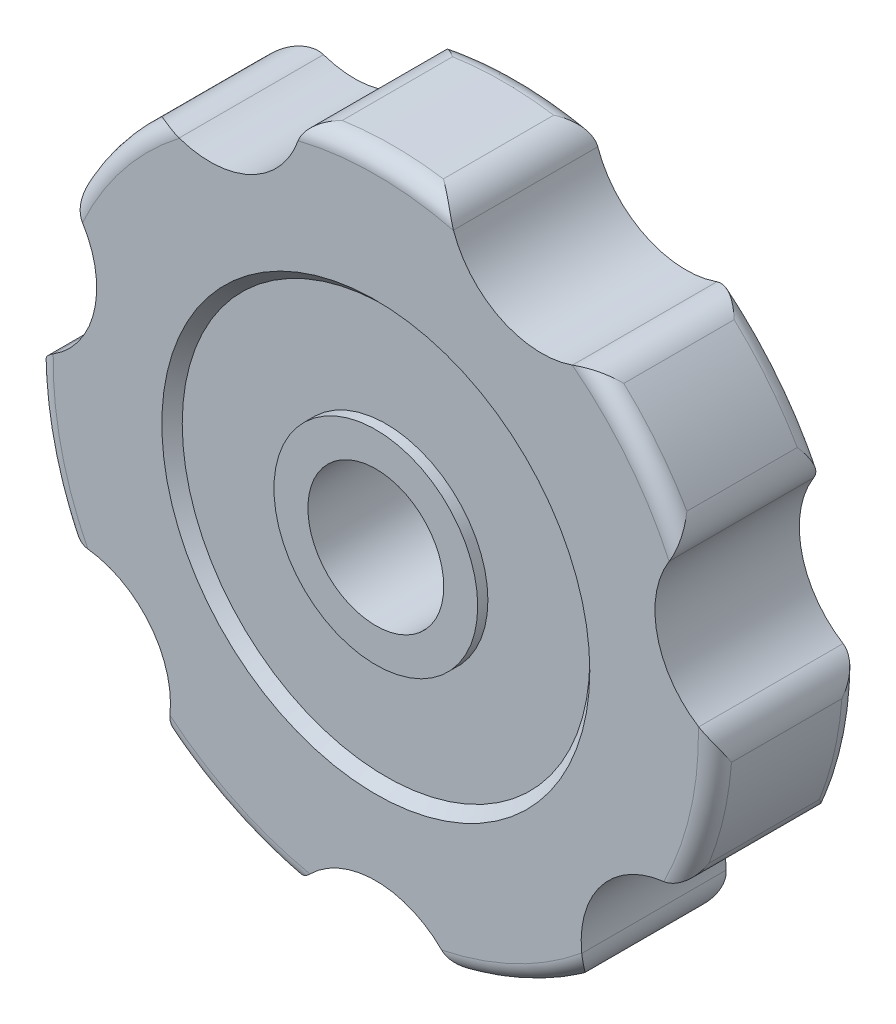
ISO-10303-21;
HEADER;
FILE_DESCRIPTION(('STEP AP214'),'2;1');
FILE_NAME('part.step','',(''),(''),'','','');
FILE_SCHEMA(('AUTOMOTIVE_DESIGN { 1 0 10303 214 1 1 1 1 }'));
ENDSEC;
DATA;
#1=APPLICATION_CONTEXT('core data for automotive mechanical design processes');
#2=APPLICATION_PROTOCOL_DEFINITION('international standard','automotive_design',2000,#1);
#3=PRODUCT_CONTEXT('',#1,'mechanical');
#4=PRODUCT('Part','Part','',(#3));
#5=PRODUCT_RELATED_PRODUCT_CATEGORY('part','',(#4));
#6=PRODUCT_DEFINITION_FORMATION('','',#4);
#7=PRODUCT_DEFINITION_CONTEXT('part definition',#1,'design');
#8=PRODUCT_DEFINITION('design','',#6,#7);
#9=PRODUCT_DEFINITION_SHAPE('','',#8);
#10=(LENGTH_UNIT() NAMED_UNIT(*) SI_UNIT(.MILLI.,.METRE.));
#11=(NAMED_UNIT(*) PLANE_ANGLE_UNIT() SI_UNIT($,.RADIAN.));
#12=(NAMED_UNIT(*) SI_UNIT($,.STERADIAN.) SOLID_ANGLE_UNIT());
#13=UNCERTAINTY_MEASURE_WITH_UNIT(LENGTH_MEASURE(1.E-05),#10,'distance_accuracy_value','');
#14=(GEOMETRIC_REPRESENTATION_CONTEXT(3) GLOBAL_UNCERTAINTY_ASSIGNED_CONTEXT((#13)) GLOBAL_UNIT_ASSIGNED_CONTEXT((#10,
#11,#12)) REPRESENTATION_CONTEXT('',''));
#15=CARTESIAN_POINT('',(0.,0.,0.));
#16=DIRECTION('',(0.,0.,1.));
#17=DIRECTION('',(1.,0.,0.));
#18=AXIS2_PLACEMENT_3D('',#15,#16,#17);
#19=CARTESIAN_POINT('',(0.,0.,2.5));
#20=DIRECTION('',(0.,0.,1.));
#21=DIRECTION('',(1.,0.,0.));
#22=AXIS2_PLACEMENT_3D('',#19,#20,#21);
#23=TOROIDAL_SURFACE('',#22,19.,1.);
#24=CARTESIAN_POINT('',(0.,0.,1.5));
#25=DIRECTION('',(0.,0.,1.));
#26=DIRECTION('',(1.,0.,0.));
#27=AXIS2_PLACEMENT_3D('',#24,#25,#26);
#28=CIRCLE('',#27,19.);
#29=CARTESIAN_POINT('',(-11.5643244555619,15.0753573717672,1.5));
#30=VERTEX_POINT('',#29);
#31=CARTESIAN_POINT('',(-17.2706909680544,7.9198000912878,1.5));
#32=VERTEX_POINT('',#31);
#33=EDGE_CURVE('E900',#30,#32,#28,.T.);
#34=ORIENTED_EDGE('',*,*,#33,.T.);
#35=CARTESIAN_POINT('',(-16.7046130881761,6.70491627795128,2.5002));
#36=CARTESIAN_POINT('',(-16.7046095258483,6.70490149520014,2.47826247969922));
#37=CARTESIAN_POINT('',(-16.7049569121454,6.70597566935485,2.45634113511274));
#38=CARTESIAN_POINT('',(-16.7063365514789,6.71021854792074,2.41275414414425));
#39=CARTESIAN_POINT('',(-16.7073678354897,6.71338428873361,2.39108818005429));
#40=CARTESIAN_POINT('',(-16.7114278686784,6.72578978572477,2.32727522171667));
#41=CARTESIAN_POINT('',(-16.7154237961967,6.73794238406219,2.2857305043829));
#42=CARTESIAN_POINT('',(-16.7257066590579,6.76864289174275,2.20573363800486));
#43=CARTESIAN_POINT('',(-16.7319815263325,6.78715708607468,2.16726647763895));
#44=CARTESIAN_POINT('',(-16.7465590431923,6.82921041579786,2.0934783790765));
#45=CARTESIAN_POINT('',(-16.7548688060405,6.85276714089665,2.05816908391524));
#46=CARTESIAN_POINT('',(-16.7785613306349,6.91823332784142,1.97162323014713));
#47=CARTESIAN_POINT('',(-16.7952682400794,6.96292333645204,1.9228568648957));
#48=CARTESIAN_POINT('',(-16.8325670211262,7.05827204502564,1.83329204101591));
#49=CARTESIAN_POINT('',(-16.853168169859,7.10894488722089,1.79251309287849));
#50=CARTESIAN_POINT('',(-16.9045165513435,7.22952095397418,1.70786538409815));
#51=CARTESIAN_POINT('',(-16.9364702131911,7.30072058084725,1.66656797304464));
#52=CARTESIAN_POINT('',(-17.0059661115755,7.44649475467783,1.5969623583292));
#53=CARTESIAN_POINT('',(-17.0435016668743,7.52106519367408,1.56863878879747));
#54=CARTESIAN_POINT('',(-17.1138235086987,7.65283054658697,1.53109747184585));
#55=CARTESIAN_POINT('',(-17.1454971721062,7.70977383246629,1.51889018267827));
#56=CARTESIAN_POINT('',(-17.2113702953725,7.82335072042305,1.50297527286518));
#57=CARTESIAN_POINT('',(-17.2455690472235,7.87998440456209,1.49926527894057));
#58=CARTESIAN_POINT('',(-17.2808424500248,7.9359946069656,1.50012770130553));
#59=B_SPLINE_CURVE_WITH_KNOTS('',3,(#35,#36,#37,#38,#39,#40,#41,#42,#43,#44,#45,#46,#47,#48,#49,
#50,#51,#52,#53,#54,#55,#56,#57,#58),.UNSPECIFIED.,.F.,.F.,(4,2,2,2,2,2,2,2,2,2,2,4),(0.,
0.0657529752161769,0.131412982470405,0.261016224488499,0.389942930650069,0.519326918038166,
0.722866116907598,0.926896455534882,1.19047015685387,1.45373087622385,1.65204860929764,
1.85031094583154),.UNSPECIFIED.);
#60=CARTESIAN_POINT('',(-17.2807166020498,7.9357946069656,1.50012455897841));
#61=VERTEX_POINT('',#60);
#62=EDGE_CURVE('E492',#32,#61,#59,.T.);
#63=ORIENTED_EDGE('',*,*,#62,.T.);
#64=CARTESIAN_POINT('',(-17.3199228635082,10.0010135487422,2.5));
#65=CARTESIAN_POINT('',(-17.3212278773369,9.99875348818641,2.49824931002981));
#66=CARTESIAN_POINT('',(-17.3225285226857,9.99649079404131,2.49649855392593));
#67=CARTESIAN_POINT('',(-17.3901089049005,9.87838947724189,2.40522105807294));
#68=CARTESIAN_POINT('',(-17.4449491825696,9.75569343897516,2.31556308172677));
#69=CARTESIAN_POINT('',(-17.5296463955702,9.49897449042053,2.14005268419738));
#70=CARTESIAN_POINT('',(-17.5594489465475,9.3649276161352,2.05420892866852));
#71=CARTESIAN_POINT('',(-17.5864255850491,9.12735243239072,1.9146716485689));
#72=CARTESIAN_POINT('',(-17.5904408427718,9.02590630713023,1.85874868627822));
#73=CARTESIAN_POINT('',(-17.5823737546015,8.81983067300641,1.75440378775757));
#74=CARTESIAN_POINT('',(-17.5703199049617,8.7152071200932,1.7059687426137));
#75=CARTESIAN_POINT('',(-17.5342706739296,8.53429892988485,1.63262413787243));
#76=CARTESIAN_POINT('',(-17.5145684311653,8.4582891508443,1.6049256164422));
#77=CARTESIAN_POINT('',(-17.4653730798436,8.30701880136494,1.55775512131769));
#78=CARTESIAN_POINT('',(-17.4359146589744,8.23175653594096,1.53825454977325));
#79=CARTESIAN_POINT('',(-17.3839224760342,8.11991170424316,1.51705311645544));
#80=CARTESIAN_POINT('',(-17.3650246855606,8.08237647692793,1.51130993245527));
#81=CARTESIAN_POINT('',(-17.3246870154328,8.00820371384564,1.50311901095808));
#82=CARTESIAN_POINT('',(-17.3032405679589,7.97156880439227,1.50067999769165));
#83=CARTESIAN_POINT('',(-17.2805907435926,7.9355946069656,1.50012145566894));
#84=B_SPLINE_CURVE_WITH_KNOTS('',3,(#64,#65,#66,#67,#68,#69,#70,#71,#72,#73,#74,#75,#76,#77,#78,
#79,#80,#81,#82,#83),.UNSPECIFIED.,.F.,.F.,(4,2,2,2,2,2,2,2,2,4),(0.,0.00942810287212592,
0.491529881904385,0.974676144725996,1.32127056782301,1.66725117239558,1.91627414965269,
2.16442107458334,2.29147390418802,2.41886155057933),.UNSPECIFIED.);
#85=CARTESIAN_POINT('',(-17.3199228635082,10.0010135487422,2.5));
#86=VERTEX_POINT('',#85);
#87=EDGE_CURVE('E580',#86,#61,#84,.T.);
#88=ORIENTED_EDGE('',*,*,#87,.F.);
#89=CARTESIAN_POINT('',(0.,0.,2.5));
#90=DIRECTION('',(0.,0.,1.));
#91=DIRECTION('',(1.,0.,0.));
#92=AXIS2_PLACEMENT_3D('',#89,#90,#91);
#93=CIRCLE('',#92,20.);
#94=CARTESIAN_POINT('',(-13.6043125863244,14.6602414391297,2.5));
#95=VERTEX_POINT('',#94);
#96=EDGE_CURVE('E885',#95,#86,#93,.T.);
#97=ORIENTED_EDGE('',*,*,#96,.F.);
#98=CARTESIAN_POINT('',(-11.5819487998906,15.0815023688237,1.50012177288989));
#99=CARTESIAN_POINT('',(-11.6225983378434,15.0957681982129,1.50068844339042));
#100=CARTESIAN_POINT('',(-11.6636359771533,15.108677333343,1.5031865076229));
#101=CARTESIAN_POINT('',(-11.7460455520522,15.1317359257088,1.51158063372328));
#102=CARTESIAN_POINT('',(-11.7874165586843,15.1418913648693,1.51746924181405));
#103=CARTESIAN_POINT('',(-11.9106551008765,15.1680338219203,1.53936960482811));
#104=CARTESIAN_POINT('',(-11.9926294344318,15.180035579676,1.55965190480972));
#105=CARTESIAN_POINT('',(-12.172803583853,15.1954327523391,1.61407464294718));
#106=CARTESIAN_POINT('',(-12.2705585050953,15.1963212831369,1.65029365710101));
#107=CARTESIAN_POINT('',(-12.461979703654,15.1846168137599,1.73143610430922));
#108=CARTESIAN_POINT('',(-12.5556205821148,15.1719497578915,1.77640624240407));
#109=CARTESIAN_POINT('',(-12.7692575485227,15.1280441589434,1.88896052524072));
#110=CARTESIAN_POINT('',(-12.8869687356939,15.0918478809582,1.95894206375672));
#111=CARTESIAN_POINT('',(-13.1105225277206,15.0007355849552,2.10464259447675));
#112=CARTESIAN_POINT('',(-13.2163783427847,14.9458406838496,2.18035503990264));
#113=CARTESIAN_POINT('',(-13.4168914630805,14.8185087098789,2.33563498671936));
#114=CARTESIAN_POINT('',(-13.5113702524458,14.7458356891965,2.41524173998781));
#115=CARTESIAN_POINT('',(-13.6004831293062,14.663788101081,2.49649855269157));
#116=CARTESIAN_POINT('',(-13.6023996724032,14.6620165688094,2.49824930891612));
#117=CARTESIAN_POINT('',(-13.6043126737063,14.6602413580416,2.5));
#118=B_SPLINE_CURVE_WITH_KNOTS('',3,(#98,#99,#100,#101,#102,#103,#104,#105,#106,#107,#108,#109,
#110,#111,#112,#113,#114,#115,#116,#117),.UNSPECIFIED.,.F.,.F.,(4,2,2,2,2,2,2,2,2,4),(0.,
0.129094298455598,0.257905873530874,0.512465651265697,0.823625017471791,1.13649300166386,
1.55916914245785,1.9813695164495,2.40951016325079,2.41893826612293),.UNSPECIFIED.);
#119=CARTESIAN_POINT('',(-11.5821487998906,15.0815725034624,1.50012455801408));
#120=VERTEX_POINT('',#119);
#121=EDGE_CURVE('E573',#120,#95,#118,.T.);
#122=ORIENTED_EDGE('',*,*,#121,.F.);
#123=CARTESIAN_POINT('',(-11.5823487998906,15.0816426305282,1.50012737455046));
#124=CARTESIAN_POINT('',(-11.5422046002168,15.0675627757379,1.49956336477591));
#125=CARTESIAN_POINT('',(-11.5019044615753,15.0539578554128,1.50089874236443));
#126=CARTESIAN_POINT('',(-11.4212810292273,15.0277694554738,1.50718150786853));
#127=CARTESIAN_POINT('',(-11.3809577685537,15.0151853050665,1.51212650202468));
#128=CARTESIAN_POINT('',(-11.2603225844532,14.9790492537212,1.53209614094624));
#129=CARTESIAN_POINT('',(-11.180327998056,14.9571077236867,1.55225536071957));
#130=CARTESIAN_POINT('',(-11.0245375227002,14.9179825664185,1.60470356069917));
#131=CARTESIAN_POINT('',(-10.9487001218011,14.900739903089,1.6368287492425));
#132=CARTESIAN_POINT('',(-10.8021221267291,14.8704553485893,1.71275329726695));
#133=CARTESIAN_POINT('',(-10.7313802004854,14.8574123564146,1.75654959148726));
#134=CARTESIAN_POINT('',(-10.6165423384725,14.8383092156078,1.84221583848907));
#135=CARTESIAN_POINT('',(-10.5704903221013,14.8313155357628,1.88126446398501));
#136=CARTESIAN_POINT('',(-10.4844594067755,14.8192332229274,1.96585001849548));
#137=CARTESIAN_POINT('',(-10.4444707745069,14.8141415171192,2.01137631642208));
#138=CARTESIAN_POINT('',(-10.3829334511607,14.8068558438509,2.09581262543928));
#139=CARTESIAN_POINT('',(-10.3593235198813,14.804250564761,2.13317675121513));
#140=CARTESIAN_POINT('',(-10.3182895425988,14.7999267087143,2.2111286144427));
#141=CARTESIAN_POINT('',(-10.3008441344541,14.7982050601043,2.25170461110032));
#142=CARTESIAN_POINT('',(-10.276485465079,14.7958680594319,2.32673721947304));
#143=CARTESIAN_POINT('',(-10.2681389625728,14.7950974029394,2.36071994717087));
#144=CARTESIAN_POINT('',(-10.2568035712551,14.7940664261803,2.4298374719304));
#145=CARTESIAN_POINT('',(-10.2538571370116,14.7938101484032,2.46497920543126));
#146=CARTESIAN_POINT('',(-10.2539361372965,14.7938093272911,2.5002));
#147=B_SPLINE_CURVE_WITH_KNOTS('',3,(#123,#124,#125,#126,#127,#128,#129,#130,#131,#132,#133,
#134,#135,#136,#137,#138,#139,#140,#141,#142,#143,#144,#145,#146),.UNSPECIFIED.,.F.,.F.,(4,2,2,
2,2,2,2,2,2,2,2,4),(0.,0.127529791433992,0.254975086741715,0.509811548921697,0.761280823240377,
1.012684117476,1.19451088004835,1.37604260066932,1.50842547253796,1.64034498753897,
1.74493301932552,1.85033983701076),.UNSPECIFIED.);
#148=EDGE_CURVE('E484',#120,#30,#147,.T.);
#149=ORIENTED_EDGE('',*,*,#148,.T.);
#150=EDGE_LOOP('',(#34,#63,#88,#97,#122,#149));
#151=FACE_BOUND('',#150,.T.);
#152=ADVANCED_FACE('F14',(#151),#23,.T.);
#153=CARTESIAN_POINT('',(17.2706909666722,7.91980009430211,1.5));
#154=VERTEX_POINT('',#153);
#155=CARTESIAN_POINT('',(11.5643244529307,15.0753573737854,1.5));
#156=VERTEX_POINT('',#155);
#157=EDGE_CURVE('E894',#154,#156,#28,.T.);
#158=ORIENTED_EDGE('',*,*,#157,.T.);
#159=CARTESIAN_POINT('',(10.2539361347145,14.7938093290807,2.5002));
#160=CARTESIAN_POINT('',(10.2539209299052,14.7938091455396,2.47826247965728));
#161=CARTESIAN_POINT('',(10.2550454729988,14.793908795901,2.45634113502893));
#162=CARTESIAN_POINT('',(10.2594889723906,14.7943097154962,2.41275414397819));
#163=CARTESIAN_POINT('',(10.2628048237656,14.7946106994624,2.39108817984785));
#164=CARTESIAN_POINT('',(10.2758027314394,14.7958084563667,2.32727522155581));
#165=CARTESIAN_POINT('',(10.2885398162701,14.7969999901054,2.28573050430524));
#166=CARTESIAN_POINT('',(10.320758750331,14.8001935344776,2.2057336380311));
#167=CARTESIAN_POINT('',(10.3402050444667,14.8021912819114,2.1672664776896));
#168=CARTESIAN_POINT('',(10.3844478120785,14.8070455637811,2.09347837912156));
#169=CARTESIAN_POINT('',(10.4092630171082,14.8099051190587,2.05816908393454));
#170=CARTESIAN_POINT('',(10.4783599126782,14.8184360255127,1.97162323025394));
#171=CARTESIAN_POINT('',(10.5256470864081,14.8247795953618,1.92285686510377));
#172=CARTESIAN_POINT('',(10.6269049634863,14.8399261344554,1.8332920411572));
#173=CARTESIAN_POINT('',(10.6808915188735,14.8487350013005,1.79251309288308));
#174=CARTESIAN_POINT('',(10.8098705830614,14.8719652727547,1.70786538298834));
#175=CARTESIAN_POINT('',(10.8863954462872,14.8872743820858,1.66656797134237));
#176=CARTESIAN_POINT('',(11.0439790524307,14.9225900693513,1.59696235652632));
#177=CARTESIAN_POINT('',(11.1250323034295,14.9425910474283,1.56863878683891));
#178=CARTESIAN_POINT('',(11.2691383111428,14.9818281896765,1.53109845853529));
#179=CARTESIAN_POINT('',(11.3316980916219,15.0000354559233,1.51889167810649));
#180=CARTESIAN_POINT('',(11.4570777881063,15.0389810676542,1.50297670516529));
#181=CARTESIAN_POINT('',(11.5198976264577,15.0597187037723,1.49926613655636));
#182=CARTESIAN_POINT('',(11.5823488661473,15.0816426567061,1.50012737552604));
#183=B_SPLINE_CURVE_WITH_KNOTS('',3,(#159,#160,#161,#162,#163,#164,#165,#166,#167,#168,#169,
#170,#171,#172,#173,#174,#175,#176,#177,#178,#179,#180,#181,#182),.UNSPECIFIED.,.F.,.F.,(4,2,2,
2,2,2,2,2,2,2,2,4),(0.,0.0657529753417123,0.131412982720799,0.261016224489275,0.389942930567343,
0.519326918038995,0.722866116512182,0.926896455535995,1.19047016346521,1.45373087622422,
1.65203649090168,1.85028663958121),.UNSPECIFIED.);
#184=CARTESIAN_POINT('',(11.5821488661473,15.0815725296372,1.50012455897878));
#185=VERTEX_POINT('',#184);
#186=EDGE_CURVE('E456',#156,#185,#183,.T.);
#187=ORIENTED_EDGE('',*,*,#186,.T.);
#188=CARTESIAN_POINT('',(13.6043126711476,14.660241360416,2.5));
#189=CARTESIAN_POINT('',(13.6023996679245,14.6620165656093,2.49824931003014));
#190=CARTESIAN_POINT('',(13.6004831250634,14.6637880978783,2.49649855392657));
#191=CARTESIAN_POINT('',(13.5003809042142,14.7559541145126,2.40522105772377));
#192=CARTESIAN_POINT('',(13.3929642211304,14.8367218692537,2.31556308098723));
#193=CARTESIAN_POINT('',(13.1615286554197,14.9764208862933,2.14005268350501));
#194=CARTESIAN_POINT('',(13.0374743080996,15.0353044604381,2.05420892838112));
#195=CARTESIAN_POINT('',(12.8118584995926,15.1144701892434,1.9146716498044));
#196=CARTESIAN_POINT('',(12.7138493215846,15.1409586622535,1.85874868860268));
#197=CARTESIAN_POINT('',(12.5111453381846,15.1789499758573,1.75440378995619));
#198=CARTESIAN_POINT('',(12.4064626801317,15.1904792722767,1.70596874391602));
#199=CARTESIAN_POINT('',(12.2220679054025,15.1955897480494,1.63262389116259));
#200=CARTESIAN_POINT('',(12.1435790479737,15.1932951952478,1.60492517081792));
#201=CARTESIAN_POINT('',(11.9851530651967,15.1789938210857,1.5577544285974));
#202=CARTESIAN_POINT('',(11.9052220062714,15.1670211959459,1.53825380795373));
#203=CARTESIAN_POINT('',(11.7846159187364,15.1412209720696,1.51705332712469));
#204=CARTESIAN_POINT('',(11.7438211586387,15.1311505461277,1.51131071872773));
#205=CARTESIAN_POINT('',(11.6625410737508,15.1083321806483,1.50312018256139));
#206=CARTESIAN_POINT('',(11.6220568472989,15.0955772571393,1.50068097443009));
#207=CARTESIAN_POINT('',(11.5819488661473,15.0815023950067,1.50012177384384));
#208=B_SPLINE_CURVE_WITH_KNOTS('',3,(#188,#189,#190,#191,#192,#193,#194,#195,#196,#197,#198,
#199,#200,#201,#202,#203,#204,#205,#206,#207),.UNSPECIFIED.,.F.,.F.,(4,2,2,2,2,2,2,2,2,4),(0.,
0.00942810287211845,0.49152988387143,0.974676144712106,1.3212705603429,1.66725117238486,
1.91627614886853,2.16442505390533,2.29146379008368,2.4188372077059),.UNSPECIFIED.);
#209=CARTESIAN_POINT('',(13.6043126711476,14.660241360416,2.5));
#210=VERTEX_POINT('',#209);
#211=EDGE_CURVE('E550',#210,#185,#208,.T.);
#212=ORIENTED_EDGE('',*,*,#211,.F.);
#213=CARTESIAN_POINT('',(17.3199229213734,10.0010134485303,2.5));
#214=VERTEX_POINT('',#213);
#215=EDGE_CURVE('E895',#214,#210,#93,.T.);
#216=ORIENTED_EDGE('',*,*,#215,.F.);
#217=CARTESIAN_POINT('',(17.2805907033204,7.93559454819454,1.5001214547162));
#218=CARTESIAN_POINT('',(17.3035447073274,7.97205024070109,1.50068739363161));
#219=CARTESIAN_POINT('',(17.3252624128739,8.00918624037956,1.50318477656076));
#220=CARTESIAN_POINT('',(17.3660817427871,8.08439831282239,1.51157763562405));
#221=CARTESIAN_POINT('',(17.3851889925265,8.12247214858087,1.51746565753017));
#222=CARTESIAN_POINT('',(17.4381006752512,8.23680331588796,1.53936440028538));
#223=CARTESIAN_POINT('',(17.4680435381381,8.31405166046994,1.55964578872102));
#224=CARTESIAN_POINT('',(17.5231488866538,8.48628077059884,1.61406631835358));
#225=CARTESIAN_POINT('',(17.5457685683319,8.58138565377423,1.65028390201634));
#226=CARTESIAN_POINT('',(17.5769549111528,8.77060939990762,1.7314235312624));
#227=CARTESIAN_POINT('',(17.5854437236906,8.86471998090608,1.77639228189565));
#228=CARTESIAN_POINT('',(17.5901808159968,9.08276839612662,1.88894363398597));
#229=CARTESIAN_POINT('',(17.5810872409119,9.20558187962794,1.95892369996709));
#230=CARTESIAN_POINT('',(17.5420089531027,9.4438036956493,2.10462149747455));
#231=CARTESIAN_POINT('',(17.512047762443,9.55922020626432,2.18033268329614));
#232=CARTESIAN_POINT('',(17.4325269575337,9.78305190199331,2.33561904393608));
#233=CARTESIAN_POINT('',(17.382695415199,9.89134457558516,2.41523379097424));
#234=CARTESIAN_POINT('',(17.3225285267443,9.9964907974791,2.49649855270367));
#235=CARTESIAN_POINT('',(17.3212278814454,9.99875349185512,2.49824930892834));
#236=CARTESIAN_POINT('',(17.3199228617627,10.0010135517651,2.5));
#237=B_SPLINE_CURVE_WITH_KNOTS('',3,(#217,#218,#219,#220,#221,#222,#223,#224,#225,#226,#227,
#228,#229,#230,#231,#232,#233,#234,#235,#236),.UNSPECIFIED.,.F.,.F.,(4,2,2,2,2,2,2,2,2,4),(0.,
0.129094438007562,0.257906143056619,0.512466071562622,0.823620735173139,1.13648398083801,
1.55915530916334,1.98135097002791,2.40953441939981,2.41896252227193),.UNSPECIFIED.);
#238=CARTESIAN_POINT('',(17.2807165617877,7.93579454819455,1.50012455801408));
#239=VERTEX_POINT('',#238);
#240=EDGE_CURVE('E542',#239,#214,#237,.T.);
#241=ORIENTED_EDGE('',*,*,#240,.F.);
#242=CARTESIAN_POINT('',(17.280842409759,7.93599454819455,1.50012770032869));
#243=CARTESIAN_POINT('',(17.2581824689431,7.89998998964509,1.49956296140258));
#244=CARTESIAN_POINT('',(17.2359508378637,7.86372768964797,1.50089763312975));
#245=CARTESIAN_POINT('',(17.1924782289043,7.79095317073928,1.50717902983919));
#246=CARTESIAN_POINT('',(17.1712366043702,7.75444113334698,1.51212336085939));
#247=CARTESIAN_POINT('',(17.1091620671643,7.64487153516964,1.53209105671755));
#248=CARTESIAN_POINT('',(17.0699697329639,7.57176493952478,1.552249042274));
#249=CARTESIAN_POINT('',(16.99715820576,7.42858677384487,1.60469468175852));
#250=CARTESIAN_POINT('',(16.9634721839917,7.35848785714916,1.63681845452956));
#251=CARTESIAN_POINT('',(16.9013296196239,7.22232396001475,1.71274002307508));
#252=CARTESIAN_POINT('',(16.8728717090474,7.15625792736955,1.75653475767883));
#253=CARTESIAN_POINT('',(16.8286922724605,7.04854791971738,1.84219940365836));
#254=CARTESIAN_POINT('',(16.8116254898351,7.00520489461,1.88124826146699));
#255=CARTESIAN_POINT('',(16.7807007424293,6.92401582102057,1.96583461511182));
#256=CARTESIAN_POINT('',(16.7668376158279,6.8861609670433,2.01136147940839));
#257=CARTESIAN_POINT('',(16.7460401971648,6.82778507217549,2.09579855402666));
#258=CARTESIAN_POINT('',(16.738246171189,6.80534589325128,2.1331627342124));
#259=CARTESIAN_POINT('',(16.7248991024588,6.76630098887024,2.21111483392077));
#260=CARTESIAN_POINT('',(16.7193383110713,6.74967511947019,2.2516910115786));
#261=CARTESIAN_POINT('',(16.7116388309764,6.72644497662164,2.32672587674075));
#262=CARTESIAN_POINT('',(16.7090298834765,6.71847819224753,2.36071072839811));
#263=CARTESIAN_POINT('',(16.7055019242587,6.7076549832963,2.42983273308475));
#264=CARTESIAN_POINT('',(16.7045963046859,6.70483906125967,2.46497682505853));
#265=CARTESIAN_POINT('',(16.7046130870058,6.70491628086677,2.5002));
#266=B_SPLINE_CURVE_WITH_KNOTS('',3,(#242,#243,#244,#245,#246,#247,#248,#249,#250,#251,#252,
#253,#254,#255,#256,#257,#258,#259,#260,#261,#262,#263,#264,#265),.UNSPECIFIED.,.F.,.F.,(4,2,2,
2,2,2,2,2,2,2,2,4),(0.,0.12752989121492,0.254975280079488,0.509811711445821,0.76127912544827,
1.01268064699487,1.19451259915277,1.37604950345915,1.50843411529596,1.64035534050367,
1.74495026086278,1.85036415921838),.UNSPECIFIED.);
#267=EDGE_CURVE('E448',#239,#154,#266,.T.);
#268=ORIENTED_EDGE('',*,*,#267,.T.);
#269=EDGE_LOOP('',(#158,#187,#212,#216,#241,#268));
#270=FACE_BOUND('',#269,.T.);
#271=ADVANCED_FACE('F1079',(#270),#23,.T.);
#272=CARTESIAN_POINT('',(16.9600487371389,-8.56485533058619,1.5));
#273=VERTEX_POINT('',#272);
#274=CARTESIAN_POINT('',(18.9966273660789,0.357978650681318,1.5));
#275=VERTEX_POINT('',#274);
#276=EDGE_CURVE('E1076',#273,#275,#28,.T.);
#277=ORIENTED_EDGE('',*,*,#276,.T.);
#278=CARTESIAN_POINT('',(17.9594904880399,1.20693915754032,2.5002));
#279=CARTESIAN_POINT('',(17.9594808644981,1.20695093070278,2.47826247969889));
#280=CARTESIAN_POINT('',(17.9602599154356,1.20613385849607,2.45634113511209));
#281=CARTESIAN_POINT('',(17.9633438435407,1.20290976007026,2.41275414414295));
#282=CARTESIAN_POINT('',(17.9656465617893,1.20050498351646,2.39108818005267));
#283=CARTESIAN_POINT('',(17.9746870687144,1.19108959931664,2.32727522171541));
#284=CARTESIAN_POINT('',(17.9835600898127,1.18187425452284,2.28573050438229));
#285=CARTESIAN_POINT('',(18.0061450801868,1.15867561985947,2.20573363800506));
#286=CARTESIAN_POINT('',(18.0198315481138,1.14471747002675,2.16726647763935));
#287=CARTESIAN_POINT('',(18.051211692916,1.11315367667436,2.09347837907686));
#288=CARTESIAN_POINT('',(18.068919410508,1.09553527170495,2.05816908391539));
#289=CARTESIAN_POINT('',(18.1186703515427,1.04683207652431,1.97162323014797));
#290=CARTESIAN_POINT('',(18.1531130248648,1.01381662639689,1.92285686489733));
#291=CARTESIAN_POINT('',(18.2280883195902,0.944093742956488,1.83329204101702));
#292=CARTESIAN_POINT('',(18.2686354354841,0.907377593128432,1.79251309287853));
#293=CARTESIAN_POINT('',(18.3672147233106,0.82102153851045,1.70786538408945));
#294=CARTESIAN_POINT('',(18.426896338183,0.770737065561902,1.66656797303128));
#295=CARTESIAN_POINT('',(18.5527590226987,0.669552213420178,1.59696235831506));
#296=CARTESIAN_POINT('',(18.6189322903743,0.61865263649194,1.56863878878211));
#297=CARTESIAN_POINT('',(18.7394608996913,0.530447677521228,1.53109747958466));
#298=CARTESIAN_POINT('',(18.7927046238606,0.492886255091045,1.51889019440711));
#299=CARTESIAN_POINT('',(18.901333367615,0.419138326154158,1.50297528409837));
#300=CARTESIAN_POINT('',(18.9567177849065,0.382951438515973,1.49926528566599));
#301=CARTESIAN_POINT('',(19.0127999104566,0.347792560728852,1.50012769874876));
#302=B_SPLINE_CURVE_WITH_KNOTS('',3,(#278,#279,#280,#281,#282,#283,#284,#285,#286,#287,#288,
#289,#290,#291,#292,#293,#294,#295,#296,#297,#298,#299,#300,#301),.UNSPECIFIED.,.F.,.F.,(4,2,2,
2,2,2,2,2,2,2,2,4),(0.,0.0657529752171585,0.131412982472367,0.261016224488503,0.389942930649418,
0.519326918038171,0.722866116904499,0.926896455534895,1.19047015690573,1.45373087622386,
1.65204851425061,1.85031075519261),.UNSPECIFIED.);
#303=CARTESIAN_POINT('',(19.0125999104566,0.347918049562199,1.50012455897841));
#304=VERTEX_POINT('',#303);
#305=EDGE_CURVE('E438',#275,#304,#302,.T.);
#306=ORIENTED_EDGE('',*,*,#305,.T.);
#307=CARTESIAN_POINT('',(19.943988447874,-1.49576896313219,2.5));
#308=CARTESIAN_POINT('',(19.9441836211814,-1.49316649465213,2.49824931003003));
#309=CARTESIAN_POINT('',(19.9443737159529,-1.4905635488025,2.49649855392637));
#310=CARTESIAN_POINT('',(19.9540192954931,-1.35483591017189,2.40522105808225));
#311=CARTESIAN_POINT('',(19.950192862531,-1.22049629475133,2.31556308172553));
#312=CARTESIAN_POINT('',(19.9151162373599,-0.952451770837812,2.1400526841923));
#313=CARTESIAN_POINT('',(19.8838066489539,-0.818748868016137,2.05420892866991));
#314=CARTESIAN_POINT('',(19.8050317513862,-0.592996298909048,1.91467164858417));
#315=CARTESIAN_POINT('',(19.7646335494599,-0.499854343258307,1.85874868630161));
#316=CARTESIAN_POINT('',(19.6679524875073,-0.317686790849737,1.75440378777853));
#317=CARTESIAN_POINT('',(19.6116978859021,-0.228654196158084,1.70596874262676));
#318=CARTESIAN_POINT('',(19.500725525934,-0.0813027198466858,1.63262413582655));
#319=CARTESIAN_POINT('',(19.449995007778,-0.0213687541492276,1.60492561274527));
#320=CARTESIAN_POINT('',(19.3400377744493,0.0935760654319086,1.55775511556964));
#321=CARTESIAN_POINT('',(19.280841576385,0.148603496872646,1.53825454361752));
#322=CARTESIAN_POINT('',(19.1854706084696,0.226813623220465,1.51705311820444));
#323=CARTESIAN_POINT('',(19.1521583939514,0.252432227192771,1.5113099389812));
#324=CARTESIAN_POINT('',(19.0836331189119,0.301757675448,1.50311902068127));
#325=CARTESIAN_POINT('',(19.0484152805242,0.325459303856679,1.50068000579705));
#326=CARTESIAN_POINT('',(19.0123999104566,0.348043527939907,1.5001214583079));
#327=B_SPLINE_CURVE_WITH_KNOTS('',3,(#307,#308,#309,#310,#311,#312,#313,#314,#315,#316,#317,
#318,#319,#320,#321,#322,#323,#324,#325,#326),.UNSPECIFIED.,.F.,.F.,(4,2,2,2,2,2,2,2,2,4),(0.,
0.00942810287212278,0.49152988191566,0.974676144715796,1.32127056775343,1.66725117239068,
1.91627416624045,2.16442110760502,2.29147382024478,2.41886134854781),.UNSPECIFIED.);
#328=CARTESIAN_POINT('',(19.943988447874,-1.49576896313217,2.5));
#329=VERTEX_POINT('',#328);
#330=EDGE_CURVE('E534',#329,#304,#327,.T.);
#331=ORIENTED_EDGE('',*,*,#330,.F.);
#332=CARTESIAN_POINT('',(18.6179024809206,-7.30573112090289,2.5));
#333=VERTEX_POINT('',#332);
#334=EDGE_CURVE('E948',#333,#329,#93,.T.);
#335=ORIENTED_EDGE('',*,*,#334,.F.);
#336=CARTESIAN_POINT('',(16.9786045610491,-8.56274367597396,1.50012191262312));
#337=CARTESIAN_POINT('',(17.0214181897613,-8.55795934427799,1.50068890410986));
#338=CARTESIAN_POINT('',(17.0639928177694,-8.55178428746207,1.50318726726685));
#339=CARTESIAN_POINT('',(17.148245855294,-8.53680275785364,1.51158194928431));
#340=CARTESIAN_POINT('',(17.1899260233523,-8.52800207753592,1.5174708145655));
#341=CARTESIAN_POINT('',(17.3123025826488,-8.49808382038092,1.53937188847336));
#342=CARTESIAN_POINT('',(17.3913660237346,-8.47332933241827,1.55965458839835));
#343=CARTESIAN_POINT('',(17.5603779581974,-8.4090260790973,1.61407829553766));
#344=CARTESIAN_POINT('',(17.6488378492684,-8.36741165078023,1.65029793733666));
#345=CARTESIAN_POINT('',(17.8162243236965,-8.27381029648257,1.73144162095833));
#346=CARTESIAN_POINT('',(17.8950958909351,-8.22176766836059,1.77641236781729));
#347=CARTESIAN_POINT('',(18.0685260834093,-8.08951480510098,1.88896793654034));
#348=CARTESIAN_POINT('',(18.1588749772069,-8.00582919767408,1.95895012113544));
#349=CARTESIAN_POINT('',(18.3207571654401,-7.82674166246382,2.10465185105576));
#350=CARTESIAN_POINT('',(18.3923115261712,-7.73135302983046,2.18036484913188));
#351=CARTESIAN_POINT('',(18.5177161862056,-7.52963462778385,2.33564198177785));
#352=CARTESIAN_POINT('',(18.5713042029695,-7.42317021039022,2.41524522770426));
#353=CARTESIAN_POINT('',(18.6159910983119,-7.31058809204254,2.49649855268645));
#354=CARTESIAN_POINT('',(18.6169492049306,-7.30816043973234,2.49824930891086));
#355=CARTESIAN_POINT('',(18.6179025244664,-7.30573100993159,2.5));
#356=B_SPLINE_CURVE_WITH_KNOTS('',3,(#336,#337,#338,#339,#340,#341,#342,#343,#344,#345,#346,
#347,#348,#349,#350,#351,#352,#353,#354,#355),.UNSPECIFIED.,.F.,.F.,(4,2,2,2,2,2,2,2,2,4),(0.,
0.129094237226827,0.25790575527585,0.512465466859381,0.823626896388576,1.1364969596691,
1.55917521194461,1.98137765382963,2.40949952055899,2.41892762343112),.UNSPECIFIED.);
#357=CARTESIAN_POINT('',(16.9788045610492,-8.56272127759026,1.50012455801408));
#358=VERTEX_POINT('',#357);
#359=EDGE_CURVE('E526',#358,#333,#356,.T.);
#360=ORIENTED_EDGE('',*,*,#359,.F.);
#361=CARTESIAN_POINT('',(16.9790045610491,-8.56269887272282,1.50012723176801));
#362=CARTESIAN_POINT('',(16.9367268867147,-8.56743135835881,1.49956354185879));
#363=CARTESIAN_POINT('',(16.894514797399,-8.57265940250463,1.50089922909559));
#364=CARTESIAN_POINT('',(16.8105129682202,-8.58404581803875,1.50718259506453));
#365=CARTESIAN_POINT('',(16.7687229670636,-8.59020357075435,1.51212788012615));
#366=CARTESIAN_POINT('',(16.6443557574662,-8.6099879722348,1.53209837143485));
#367=CARTESIAN_POINT('',(16.5627632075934,-8.62492781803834,1.55225813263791));
#368=CARTESIAN_POINT('',(16.4054252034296,-8.65727249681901,1.60470745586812));
#369=CARTESIAN_POINT('',(16.3296167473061,-8.67464216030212,1.63683326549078));
#370=CARTESIAN_POINT('',(16.1844146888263,-8.7109547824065,1.71275912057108));
#371=CARTESIAN_POINT('',(16.1150194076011,-8.72989732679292,1.75655609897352));
#372=CARTESIAN_POINT('',(16.0032666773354,-8.76251215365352,1.84222304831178));
#373=CARTESIAN_POINT('',(15.9587416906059,-8.77619208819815,1.88127157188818));
#374=CARTESIAN_POINT('',(15.8759899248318,-8.80263328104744,1.96585677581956));
#375=CARTESIAN_POINT('',(15.8377530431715,-8.81539599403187,2.01138282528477));
#376=CARTESIAN_POINT('',(15.7791498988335,-8.8355315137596,2.09581879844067));
#377=CARTESIAN_POINT('',(15.7567481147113,-8.84342807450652,2.1331829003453));
#378=CARTESIAN_POINT('',(15.7179025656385,-8.85733611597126,2.21113465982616));
#379=CARTESIAN_POINT('',(15.7014382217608,-8.86335409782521,2.25171057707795));
#380=CARTESIAN_POINT('',(15.6784788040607,-8.87181701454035,2.32674219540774));
#381=CARTESIAN_POINT('',(15.6706249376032,-8.87474392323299,2.36072399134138));
#382=CARTESIAN_POINT('',(15.6599653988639,-8.87873305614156,2.42983955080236));
#383=CARTESIAN_POINT('',(15.6571997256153,-8.87978050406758,2.46498024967));
#384=CARTESIAN_POINT('',(15.6572705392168,-8.87974549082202,2.5002));
#385=B_SPLINE_CURVE_WITH_KNOTS('',3,(#361,#362,#363,#364,#365,#366,#367,#368,#369,#370,#371,
#372,#373,#374,#375,#376,#377,#378,#379,#380,#381,#382,#383,#384),.UNSPECIFIED.,.F.,.F.,(4,2,2,
2,2,2,2,2,2,2,2,4),(0.,0.1275297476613,0.254975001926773,0.509811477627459,0.761281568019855,
1.01268563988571,1.19451012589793,1.37603957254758,1.50842168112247,1.64034044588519,
1.74492545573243,1.85032916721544),.UNSPECIFIED.);
#386=EDGE_CURVE('E430',#358,#273,#385,.T.);
#387=ORIENTED_EDGE('',*,*,#386,.T.);
#388=EDGE_LOOP('',(#277,#306,#331,#335,#360,#387));
#389=FACE_BOUND('',#388,.T.);
#390=ADVANCED_FACE('F972',(#389),#23,.T.);
#391=CARTESIAN_POINT('',(3.87814388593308,-18.6,1.5));
#392=VERTEX_POINT('',#391);
#393=CARTESIAN_POINT('',(12.12408241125,-14.6289652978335,1.5));
#394=VERTEX_POINT('',#393);
#395=EDGE_CURVE('E1069',#392,#394,#28,.T.);
#396=ORIENTED_EDGE('',*,*,#395,.T.);
#397=CARTESIAN_POINT('',(12.1411821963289,-13.2887808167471,2.5002));
#398=CARTESIAN_POINT('',(12.1411854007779,-13.2887659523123,2.47826247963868));
#399=CARTESIAN_POINT('',(12.141032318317,-13.2898844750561,2.45634113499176));
#400=CARTESIAN_POINT('',(12.140434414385,-13.2943057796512,2.41275414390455));
#401=CARTESIAN_POINT('',(12.1399900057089,-13.2976054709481,2.3910881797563));
#402=CARTESIAN_POINT('',(12.1382654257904,-13.310544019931,2.32727522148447));
#403=CARTESIAN_POINT('',(12.1365928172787,-13.3232269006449,2.28573050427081));
#404=CARTESIAN_POINT('',(12.1325369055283,-13.3553486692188,2.20573363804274));
#405=CARTESIAN_POINT('',(12.1301573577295,-13.3747519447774,2.16726647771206));
#406=CARTESIAN_POINT('',(12.1250449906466,-13.4189656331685,2.09347837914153));
#407=CARTESIAN_POINT('',(12.1223109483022,-13.4437949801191,2.0581690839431));
#408=CARTESIAN_POINT('',(12.115252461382,-13.5130577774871,1.97162323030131));
#409=CARTESIAN_POINT('',(12.1109145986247,-13.5605709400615,1.92285686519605));
#410=CARTESIAN_POINT('',(12.1031493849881,-13.6626604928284,1.83329204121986));
#411=CARTESIAN_POINT('',(12.0997242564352,-13.7172536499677,1.79251309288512));
#412=CARTESIAN_POINT('',(12.0936715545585,-13.8481681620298,1.70786538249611));
#413=CARTESIAN_POINT('',(12.0915684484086,-13.9261809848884,1.66656797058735));
#414=CARTESIAN_POINT('',(12.0909330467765,-14.0876721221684,1.59696235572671));
#415=CARTESIAN_POINT('',(12.0923965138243,-14.1711438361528,1.5686387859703));
#416=CARTESIAN_POINT('',(12.0985832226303,-14.3203661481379,1.53109889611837));
#417=CARTESIAN_POINT('',(12.1024129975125,-14.3854071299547,1.51889234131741));
#418=CARTESIAN_POINT('',(12.1124821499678,-14.5163059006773,1.50297734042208));
#419=CARTESIAN_POINT('',(12.1187208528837,-14.5821634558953,1.49926651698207));
#420=CARTESIAN_POINT('',(12.1261980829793,-14.6479256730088,1.50012723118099));
#421=B_SPLINE_CURVE_WITH_KNOTS('',3,(#397,#398,#399,#400,#401,#402,#403,#404,#405,#406,#407,
#408,#409,#410,#411,#412,#413,#414,#415,#416,#417,#418,#419,#420),.UNSPECIFIED.,.F.,.F.,(4,2,2,
2,2,2,2,2,2,2,2,4),(0.,0.0657529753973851,0.13141298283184,0.261016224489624,0.389942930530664,
0.519326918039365,0.722866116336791,0.926896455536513,1.19047016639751,1.45373087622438,
1.6520311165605,1.85027586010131),.UNSPECIFIED.);
#422=CARTESIAN_POINT('',(12.1261754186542,-14.6477256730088,1.50012455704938));
#423=VERTEX_POINT('',#422);
#424=EDGE_CURVE('E420',#394,#423,#421,.T.);
#425=ORIENTED_EDGE('',*,*,#424,.T.);
#426=CARTESIAN_POINT('',(11.2654341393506,-16.5254347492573,2.5));
#427=CARTESIAN_POINT('',(11.2675905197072,-16.5239647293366,2.49824931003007));
#428=CARTESIAN_POINT('',(11.269744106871,-16.5224904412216,2.49649855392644));
#429=CARTESIAN_POINT('',(11.3818741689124,-16.445406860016,2.40522105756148));
#430=CARTESIAN_POINT('',(11.4845193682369,-16.3586558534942,2.31556308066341));
#431=CARTESIAN_POINT('',(11.6722150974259,-16.1641088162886,2.14005268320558));
#432=CARTESIAN_POINT('',(11.7572270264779,-16.0562675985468,2.05420892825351));
#433=CARTESIAN_POINT('',(11.8846121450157,-15.8539244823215,1.9146716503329));
#434=CARTESIAN_POINT('',(11.9322455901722,-15.7642668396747,1.85874868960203));
#435=CARTESIAN_POINT('',(12.014390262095,-15.5750989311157,1.75440379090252));
#436=CARTESIAN_POINT('',(12.0489245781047,-15.4756063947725,1.70596874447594));
#437=CARTESIAN_POINT('',(12.0949386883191,-15.2969717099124,1.6326237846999));
#438=CARTESIAN_POINT('',(12.1101671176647,-15.219939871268,1.60492497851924));
#439=CARTESIAN_POINT('',(12.1314774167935,-15.0623030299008,1.55775412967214));
#440=CARTESIAN_POINT('',(12.1375912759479,-14.9817115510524,1.53825348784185));
#441=CARTESIAN_POINT('',(12.1392751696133,-14.8583899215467,1.51705341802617));
#442=CARTESIAN_POINT('',(12.1385349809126,-14.816379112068,1.51131105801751));
#443=CARTESIAN_POINT('',(12.1343756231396,-14.732063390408,1.50312068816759));
#444=CARTESIAN_POINT('',(12.1309494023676,-14.6897579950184,1.50068139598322));
#445=CARTESIAN_POINT('',(12.1261527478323,-14.6475256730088,1.50012191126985));
#446=B_SPLINE_CURVE_WITH_KNOTS('',3,(#426,#427,#428,#429,#430,#431,#432,#433,#434,#435,#436,
#437,#438,#439,#440,#441,#442,#443,#444,#445),.UNSPECIFIED.,.F.,.F.,(4,2,2,2,2,2,2,2,2,4),(0.,
0.00942810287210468,0.491529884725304,0.974676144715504,1.32127055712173,1.66725117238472,
1.9162770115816,2.16442677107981,2.29145942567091,2.41882670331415),.UNSPECIFIED.);
#447=CARTESIAN_POINT('',(11.2654341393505,-16.5254347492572,2.5));
#448=VERTEX_POINT('',#447);
#449=EDGE_CURVE('E518',#448,#423,#446,.T.);
#450=ORIENTED_EDGE('',*,*,#449,.F.);
#451=CARTESIAN_POINT('',(5.89622184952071,-19.1111111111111,2.5));
#452=VERTEX_POINT('',#451);
#453=EDGE_CURVE('E891',#452,#448,#93,.T.);
#454=ORIENTED_EDGE('',*,*,#453,.F.);
#455=CARTESIAN_POINT('',(3.89130669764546,-18.6131333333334,1.50012085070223));
#456=CARTESIAN_POINT('',(3.92173999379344,-18.6436247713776,1.50068539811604));
#457=CARTESIAN_POINT('',(3.95311171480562,-18.6730623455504,1.50318148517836));
#458=CARTESIAN_POINT('',(4.01735391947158,-18.729596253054,1.51157193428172));
#459=CARTESIAN_POINT('',(4.05022096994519,-18.7566975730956,1.51745884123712));
#460=CARTESIAN_POINT('',(4.14991049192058,-18.8337264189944,1.53935450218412));
#461=CARTESIAN_POINT('',(4.21855857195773,-18.8801097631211,1.55963415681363));
#462=CARTESIAN_POINT('',(4.37420393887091,-18.972160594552,1.61405048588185));
#463=CARTESIAN_POINT('',(4.46188800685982,-19.0153770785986,1.65026534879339));
#464=CARTESIAN_POINT('',(4.63942215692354,-19.0878906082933,1.73139961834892));
#465=CARTESIAN_POINT('',(4.72928148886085,-19.1171099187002,1.77636573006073));
#466=CARTESIAN_POINT('',(4.94080355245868,-19.170253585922,1.88891150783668));
#467=CARTESIAN_POINT('',(5.06255890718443,-19.1887198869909,1.95888877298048));
#468=CARTESIAN_POINT('',(5.30349933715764,-19.203637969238,2.10458137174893));
#469=CARTESIAN_POINT('',(5.42268714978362,-19.2001144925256,2.18029016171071));
#470=CARTESIAN_POINT('',(5.65862375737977,-19.1724002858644,2.33558872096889));
#471=CARTESIAN_POINT('',(5.77531273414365,-19.1479127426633,2.41521867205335));
#472=CARTESIAN_POINT('',(5.89123267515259,-19.1126450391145,2.49649855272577));
#473=CARTESIAN_POINT('',(5.89372805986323,-19.1118805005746,2.49824930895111));
#474=CARTESIAN_POINT('',(5.8962218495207,-19.1111111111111,2.5));
#475=B_SPLINE_CURVE_WITH_KNOTS('',3,(#455,#456,#457,#458,#459,#460,#461,#462,#463,#464,#465,
#466,#467,#468,#469,#470,#471,#472,#473,#474),.UNSPECIFIED.,.F.,.F.,(4,2,2,2,2,2,2,2,2,4),(0.,
0.129094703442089,0.257906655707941,0.512466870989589,0.823612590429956,1.13646682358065,
1.55912899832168,1.98131569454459,2.40958055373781,2.41900865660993),.UNSPECIFIED.);
#476=CARTESIAN_POINT('',(3.89150642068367,-18.6133333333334,1.50012455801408));
#477=VERTEX_POINT('',#476);
#478=EDGE_CURVE('E510',#477,#452,#475,.T.);
#479=ORIENTED_EDGE('',*,*,#478,.F.);
#480=CARTESIAN_POINT('',(3.89170616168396,-18.6135333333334,1.50012832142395));
#481=CARTESIAN_POINT('',(3.8616468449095,-18.5834294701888,1.49956219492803));
#482=CARTESIAN_POINT('',(3.83124089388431,-18.5536857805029,1.50089552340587));
#483=CARTESIAN_POINT('',(3.76996481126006,-18.4951085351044,1.50717431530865));
#484=CARTESIAN_POINT('',(3.73909500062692,-18.4662743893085,1.51211738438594));
#485=CARTESIAN_POINT('',(3.64608566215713,-18.3813734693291,1.53208138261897));
#486=CARTESIAN_POINT('',(3.58353314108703,-18.3268951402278,1.55223701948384));
#487=CARTESIAN_POINT('',(3.46014740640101,-18.2240478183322,1.60467778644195));
#488=CARTESIAN_POINT('',(3.39930239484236,-18.1756075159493,1.63679886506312));
#489=CARTESIAN_POINT('',(3.28038095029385,-18.0847225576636,1.71271476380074));
#490=CARTESIAN_POINT('',(3.2223037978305,-18.0422763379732,1.75650653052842));
#491=CARTESIAN_POINT('',(3.12712163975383,-17.9752332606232,1.84216812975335));
#492=CARTESIAN_POINT('',(3.0886599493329,-17.9489471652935,1.88121742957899));
#493=CARTESIAN_POINT('',(3.01638170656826,-17.900726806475,1.96580530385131));
#494=CARTESIAN_POINT('',(2.98255771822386,-17.8787855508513,2.01133324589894));
#495=CARTESIAN_POINT('',(2.93026881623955,-17.8455165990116,2.09577177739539));
#496=CARTESIAN_POINT('',(2.91012500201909,-17.8329237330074,2.13313606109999));
#497=CARTESIAN_POINT('',(2.87502584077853,-17.8112208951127,2.21108861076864));
#498=CARTESIAN_POINT('',(2.86005257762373,-17.802098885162,2.25166513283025));
#499=CARTESIAN_POINT('',(2.83911434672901,-17.7894209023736,2.32670429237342));
#500=CARTESIAN_POINT('',(2.83192607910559,-17.7851035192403,2.36069318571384));
#501=CARTESIAN_POINT('',(2.82215681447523,-17.7792541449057,2.4298237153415));
#502=CARTESIAN_POINT('',(2.8196123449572,-17.7777442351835,2.46497229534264));
#503=CARTESIAN_POINT('',(2.81968392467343,-17.7777777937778,2.5002));
#504=B_SPLINE_CURVE_WITH_KNOTS('',3,(#480,#481,#482,#483,#484,#485,#486,#487,#488,#489,#490,
#491,#492,#493,#494,#495,#496,#497,#498,#499,#500,#501,#502,#503),.UNSPECIFIED.,.F.,.F.,(4,2,2,
2,2,2,2,2,2,2,2,4),(0.,0.127530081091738,0.254975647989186,0.509812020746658,0.761275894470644,
1.01267404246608,1.19451587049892,1.37606263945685,1.50845056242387,1.64037504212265,
1.7449830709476,1.85041044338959),.UNSPECIFIED.);
#505=EDGE_CURVE('E412',#477,#392,#504,.T.);
#506=ORIENTED_EDGE('',*,*,#505,.T.);
#507=EDGE_LOOP('',(#396,#425,#450,#454,#479,#506));
#508=FACE_BOUND('',#507,.T.);
#509=ADVANCED_FACE('F1068',(#508),#23,.T.);
#510=CARTESIAN_POINT('',(-12.1240824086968,-14.6289652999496,1.5));
#511=VERTEX_POINT('',#510);
#512=CARTESIAN_POINT('',(-3.87814388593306,-18.6,1.5));
#513=VERTEX_POINT('',#512);
#514=EDGE_CURVE('E995',#511,#513,#28,.T.);
#515=ORIENTED_EDGE('',*,*,#514,.T.);
#516=CARTESIAN_POINT('',(-2.81968392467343,-17.7777777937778,2.5002));
#517=CARTESIAN_POINT('',(-2.81967030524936,-17.7777710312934,2.47826247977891));
#518=CARTESIAN_POINT('',(-2.82064024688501,-17.7783487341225,2.456341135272));
#519=CARTESIAN_POINT('',(-2.82446974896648,-17.7806379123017,2.41275414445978));
#520=CARTESIAN_POINT('',(-2.82732663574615,-17.782347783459,2.39108818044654));
#521=CARTESIAN_POINT('',(-2.83851765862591,-17.7890665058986,2.32727522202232));
#522=CARTESIAN_POINT('',(-2.84947638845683,-17.7956664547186,2.28573050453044));
#523=CARTESIAN_POINT('',(-2.87711901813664,-17.812523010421,2.20573363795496));
#524=CARTESIAN_POINT('',(-2.89377273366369,-17.822760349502,2.16726647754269));
#525=CARTESIAN_POINT('',(-2.93152789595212,-17.8463301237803,2.09347837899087));
#526=CARTESIAN_POINT('',(-2.95264490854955,-17.8596734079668,2.05816908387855));
#527=CARTESIAN_POINT('',(-3.01119763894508,-17.8973395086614,1.9716232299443));
#528=CARTESIAN_POINT('',(-3.05104953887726,-17.9235720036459,1.92285686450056));
#529=CARTESIAN_POINT('',(-3.13570789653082,-17.9811527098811,1.83329204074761));
#530=CARTESIAN_POINT('',(-3.18052607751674,-18.0125131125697,1.79251309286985));
#531=CARTESIAN_POINT('',(-3.28665295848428,-18.0894047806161,1.70786538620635));
#532=CARTESIAN_POINT('',(-3.34895710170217,-18.1364007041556,1.6665679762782));
#533=CARTESIAN_POINT('',(-3.47561211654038,-18.2365919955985,1.59696236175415));
#534=CARTESIAN_POINT('',(-3.53996047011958,-18.2897799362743,1.56863879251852));
#535=CARTESIAN_POINT('',(-3.65277975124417,-18.3876641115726,1.53109559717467));
#536=CARTESIAN_POINT('',(-3.70125293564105,-18.431219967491,1.51888734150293));
#537=CARTESIAN_POINT('',(-3.79733507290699,-18.5207257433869,1.50297255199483));
#538=CARTESIAN_POINT('',(-3.84494426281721,-18.5666749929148,1.49926365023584));
#539=CARTESIAN_POINT('',(-3.89170616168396,-18.6135333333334,1.50012832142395));
#540=B_SPLINE_CURVE_WITH_KNOTS('',3,(#516,#517,#518,#519,#520,#521,#522,#523,#524,#525,#526,
#527,#528,#529,#530,#531,#532,#533,#534,#535,#536,#537,#538,#539),.UNSPECIFIED.,.F.,.F.,(4,2,2,
2,2,2,2,2,2,2,2,4),(0.,0.0657529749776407,0.131412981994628,0.261016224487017,0.389942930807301,
0.519326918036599,0.722866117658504,0.926896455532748,1.19047014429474,1.45373087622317,
1.65207163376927,1.85035712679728),.UNSPECIFIED.);
#541=CARTESIAN_POINT('',(-3.89150642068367,-18.6133333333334,1.50012455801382));
#542=VERTEX_POINT('',#541);
#543=EDGE_CURVE('E402',#513,#542,#540,.T.);
#544=ORIENTED_EDGE('',*,*,#543,.T.);
#545=CARTESIAN_POINT('',(-5.8962218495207,-19.1111111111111,2.5));
#546=CARTESIAN_POINT('',(-5.89372806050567,-19.1118804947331,2.49824931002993));
#547=CARTESIAN_POINT('',(-5.89123267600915,-19.1126450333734,2.49649855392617));
#548=CARTESIAN_POINT('',(-5.76105435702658,-19.1522510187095,2.40522105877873));
#549=CARTESIAN_POINT('',(-5.62923145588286,-19.1784138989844,2.31556308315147));
#550=CARTESIAN_POINT('',(-5.36010208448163,-19.2038622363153,2.14005268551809));
#551=CARTESIAN_POINT('',(-5.22278435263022,-19.2030893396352,2.0542089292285));
#552=CARTESIAN_POINT('',(-4.9851628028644,-19.176524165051,1.9146716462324));
#553=CARTESIAN_POINT('',(-4.88536666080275,-19.1578648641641,1.85874868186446));
#554=CARTESIAN_POINT('',(-4.68625286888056,-19.104143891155,1.75440378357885));
#555=CARTESIAN_POINT('',(-4.58693468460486,-19.0691113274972,1.70596874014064));
#556=CARTESIAN_POINT('',(-4.41858503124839,-18.9937105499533,1.6326246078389));
#557=CARTESIAN_POINT('',(-4.34886619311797,-18.9575891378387,1.60492646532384));
#558=CARTESIAN_POINT('',(-4.21233751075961,-18.8759679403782,1.55775644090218));
#559=CARTESIAN_POINT('',(-4.14551829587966,-18.8305015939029,1.53825596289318));
#560=CARTESIAN_POINT('',(-4.04804077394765,-18.7549209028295,1.51705271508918));
#561=CARTESIAN_POINT('',(-4.01564498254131,-18.7281387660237,1.51130843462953));
#562=CARTESIAN_POINT('',(-3.95229488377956,-18.6722949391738,1.5031167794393));
#563=CARTESIAN_POINT('',(-3.92134460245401,-18.6432274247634,1.50067813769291));
#564=CARTESIAN_POINT('',(-3.89130669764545,-18.6131333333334,1.50012085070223));
#565=B_SPLINE_CURVE_WITH_KNOTS('',3,(#545,#546,#547,#548,#549,#550,#551,#552,#553,#554,#555,
#556,#557,#558,#559,#560,#561,#562,#563,#564),.UNSPECIFIED.,.F.,.F.,(4,2,2,2,2,2,2,2,2,4),(0.,
0.00942810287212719,0.491529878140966,0.974676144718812,1.32127058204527,1.66725117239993,
1.91627034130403,2.16441349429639,2.29149317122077,2.41890792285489),.UNSPECIFIED.);
#566=CARTESIAN_POINT('',(-5.89622184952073,-19.1111111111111,2.5));
#567=VERTEX_POINT('',#566);
#568=EDGE_CURVE('E502',#567,#542,#565,.T.);
#569=ORIENTED_EDGE('',*,*,#568,.F.);
#570=CARTESIAN_POINT('',(-11.2654342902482,-16.5254346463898,2.5));
#571=VERTEX_POINT('',#570);
#572=EDGE_CURVE('E886',#571,#567,#93,.T.);
#573=ORIENTED_EDGE('',*,*,#572,.F.);
#574=CARTESIAN_POINT('',(-12.1261527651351,-14.6475258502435,1.50012191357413));
#575=CARTESIAN_POINT('',(-12.131015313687,-14.6903306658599,1.50068890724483));
#576=CARTESIAN_POINT('',(-12.1344688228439,-14.7332119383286,1.50318727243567));
#577=CARTESIAN_POINT('',(-12.1386109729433,-14.818686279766,1.51158195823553));
#578=CARTESIAN_POINT('',(-12.1393056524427,-14.8612797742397,1.51747082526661));
#579=CARTESIAN_POINT('',(-12.1373688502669,-14.9872455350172,1.53937190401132));
#580=CARTESIAN_POINT('',(-12.1308282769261,-15.0698350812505,1.55965460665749));
#581=CARTESIAN_POINT('',(-12.1057459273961,-15.2489183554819,1.61407832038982));
#582=CARTESIAN_POINT('',(-12.0848590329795,-15.3444204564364,1.65029796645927));
#583=CARTESIAN_POINT('',(-12.0308514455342,-15.5284384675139,1.73144165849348));
#584=CARTESIAN_POINT('',(-11.9976642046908,-15.6169131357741,1.77641240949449));
#585=CARTESIAN_POINT('',(-11.9073190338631,-15.8154241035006,1.88896798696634));
#586=CARTESIAN_POINT('',(-11.8458361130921,-15.92212956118,1.95895017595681));
#587=CARTESIAN_POINT('',(-11.7072608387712,-16.1198037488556,2.10465191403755));
#588=CARTESIAN_POINT('',(-11.6301861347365,-16.2107900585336,2.18036491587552));
#589=CARTESIAN_POINT('',(-11.4614304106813,-16.3779370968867,2.33564202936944));
#590=CARTESIAN_POINT('',(-11.3695597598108,-16.4538720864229,2.41524525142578));
#591=CARTESIAN_POINT('',(-11.2697441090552,-16.5224904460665,2.49649855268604));
#592=CARTESIAN_POINT('',(-11.2675905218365,-16.523964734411,2.49824930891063));
#593=CARTESIAN_POINT('',(-11.2654341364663,-16.5254347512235,2.5));
#594=B_SPLINE_CURVE_WITH_KNOTS('',3,(#574,#575,#576,#577,#578,#579,#580,#581,#582,#583,#584,
#585,#586,#587,#588,#589,#590,#591,#592,#593),.UNSPECIFIED.,.F.,.F.,(4,2,2,2,2,2,2,2,2,4),(0.,
0.129094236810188,0.257905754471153,0.512465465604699,0.823626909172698,1.13649698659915,
1.55917525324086,1.9813777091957,2.40949944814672,2.41892755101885),.UNSPECIFIED.);
#595=CARTESIAN_POINT('',(-12.1261754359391,-14.6477258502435,1.50012455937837));
#596=VERTEX_POINT('',#595);
#597=EDGE_CURVE('E360',#596,#571,#594,.T.);
#598=ORIENTED_EDGE('',*,*,#597,.F.);
#599=CARTESIAN_POINT('',(-12.1261981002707,-14.6479258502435,1.50012723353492));
#600=CARTESIAN_POINT('',(-12.1214042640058,-14.6056550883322,1.49956353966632));
#601=CARTESIAN_POINT('',(-12.1171081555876,-14.5633379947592,1.50089922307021));
#602=CARTESIAN_POINT('',(-12.1095169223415,-14.4789085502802,1.50718258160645));
#603=CARTESIAN_POINT('',(-12.1062211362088,-14.4367960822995,1.51212786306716));
#604=CARTESIAN_POINT('',(-12.0978351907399,-14.3111445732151,1.53209834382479));
#605=CARTESIAN_POINT('',(-12.0942444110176,-14.2282732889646,1.55225809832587));
#606=CARTESIAN_POINT('',(-12.0907671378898,-14.0676827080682,1.60470740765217));
#607=CARTESIAN_POINT('',(-12.0908323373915,-13.9899098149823,1.63683320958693));
#608=CARTESIAN_POINT('',(-12.0939240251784,-13.8402679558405,1.7127590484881));
#609=CARTESIAN_POINT('',(-12.0969497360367,-13.7683974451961,1.75655601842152));
#610=CARTESIAN_POINT('',(-12.1038795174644,-13.6521890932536,1.84222295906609));
#611=CARTESIAN_POINT('',(-12.1073087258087,-13.6057363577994,1.88127148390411));
#612=CARTESIAN_POINT('',(-12.1146729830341,-13.5191756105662,1.9658566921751));
#613=CARTESIAN_POINT('',(-12.1186072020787,-13.4790574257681,2.01138274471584));
#614=CARTESIAN_POINT('',(-12.1251974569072,-13.4174429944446,2.09581872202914));
#615=CARTESIAN_POINT('',(-12.1279111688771,-13.3938457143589,2.13318282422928));
#616=CARTESIAN_POINT('',(-12.1328265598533,-13.3528792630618,2.21113458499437));
#617=CARTESIAN_POINT('',(-12.1350299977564,-13.3354885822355,2.25171050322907));
#618=CARTESIAN_POINT('',(-12.1381717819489,-13.3112216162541,2.32674213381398));
#619=CARTESIAN_POINT('',(-12.1392776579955,-13.3029133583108,2.36072394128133));
#620=CARTESIAN_POINT('',(-12.1407948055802,-13.291633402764,2.42983952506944));
#621=CARTESIAN_POINT('',(-12.1412005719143,-13.2887039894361,2.4649802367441));
#622=CARTESIAN_POINT('',(-12.1411821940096,-13.2887808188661,2.5002));
#623=B_SPLINE_CURVE_WITH_KNOTS('',3,(#599,#600,#601,#602,#603,#604,#605,#606,#607,#608,#609,
#610,#611,#612,#613,#614,#615,#616,#617,#618,#619,#620,#621,#622),.UNSPECIFIED.,.F.,.F.,(4,2,2,
2,2,2,2,2,2,2,2,4),(0.,0.127529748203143,0.254975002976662,0.50981147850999,0.761281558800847,
1.01268562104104,1.19451013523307,1.37603961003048,1.50842172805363,1.640340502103,
1.74492554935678,1.85032929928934),.UNSPECIFIED.);
#624=EDGE_CURVE('E394',#596,#511,#623,.T.);
#625=ORIENTED_EDGE('',*,*,#624,.T.);
#626=EDGE_LOOP('',(#515,#544,#569,#573,#598,#625));
#627=FACE_BOUND('',#626,.T.);
#628=ADVANCED_FACE('F992',(#627),#23,.T.);
#629=CARTESIAN_POINT('',(-19.0123998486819,0.348043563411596,1.50012145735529));
#630=CARTESIAN_POINT('',(-19.0488982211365,0.325157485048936,1.50068740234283));
#631=CARTESIAN_POINT('',(-19.0845779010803,0.301122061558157,1.50318479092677));
#632=CARTESIAN_POINT('',(-19.1539881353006,0.251069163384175,1.51157766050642));
#633=CARTESIAN_POINT('',(-19.187722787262,0.225056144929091,1.51746568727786));
#634=CARTESIAN_POINT('',(-19.2850009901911,0.14500483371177,1.53936444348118));
#635=CARTESIAN_POINT('',(-19.3454953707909,0.0883981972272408,1.55964583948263));
#636=CARTESIAN_POINT('',(-19.4698709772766,-0.0428655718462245,1.61406638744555));
#637=CARTESIAN_POINT('',(-19.5315150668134,-0.118737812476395,1.65028398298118));
#638=CARTESIAN_POINT('',(-19.6417140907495,-0.275691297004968,1.73142363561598));
#639=CARTESIAN_POINT('',(-19.6901952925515,-0.356798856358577,1.77639239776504));
#640=CARTESIAN_POINT('',(-19.7890709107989,-0.551198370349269,1.88894377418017));
#641=CARTESIAN_POINT('',(-19.8341646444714,-0.665795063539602,1.95892385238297));
#642=CARTESIAN_POINT('',(-19.9023168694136,-0.897380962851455,2.10462167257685));
#643=CARTESIAN_POINT('',(-19.9254001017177,-1.01436733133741,2.18033286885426));
#644=CARTESIAN_POINT('',(-19.9508712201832,-1.25053541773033,2.3356191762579));
#645=CARTESIAN_POINT('',(-19.9529609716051,-1.36972474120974,2.41523385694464));
#646=CARTESIAN_POINT('',(-19.9443737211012,-1.49056355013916,2.49649855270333));
#647=CARTESIAN_POINT('',(-19.9441836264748,-1.49316649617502,2.49824930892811));
#648=CARTESIAN_POINT('',(-19.9439884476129,-1.49576896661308,2.5));
#649=B_SPLINE_CURVE_WITH_KNOTS('',3,(#629,#630,#631,#632,#633,#634,#635,#636,#637,#638,#639,
#640,#641,#642,#643,#644,#645,#646,#647,#648),.UNSPECIFIED.,.F.,.F.,(4,2,2,2,2,2,2,2,2,4),(0.,
0.129094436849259,0.257906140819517,0.512466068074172,0.823620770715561,1.13648405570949,
1.55915542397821,1.98135112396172,2.40953421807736,2.41896232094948),.UNSPECIFIED.);
#650=CARTESIAN_POINT('',(-19.0125998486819,0.347918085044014,1.50012455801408));
#651=VERTEX_POINT('',#650);
#652=CARTESIAN_POINT('',(-19.9439884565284,-1.49576884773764,2.5));
#653=VERTEX_POINT('',#652);
#654=EDGE_CURVE('E586',#651,#653,#649,.T.);
#655=ORIENTED_EDGE('',*,*,#654,.F.);
#656=CARTESIAN_POINT('',(-19.0127998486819,0.347792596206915,1.50012769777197));
#657=CARTESIAN_POINT('',(-18.9767621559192,0.370399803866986,1.49956296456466));
#658=CARTESIAN_POINT('',(-18.940998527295,0.393425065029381,1.50089764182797));
#659=CARTESIAN_POINT('',(-18.8702553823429,0.440130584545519,1.50717904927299));
#660=CARTESIAN_POINT('',(-18.835275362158,0.463810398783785,1.51212338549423));
#661=CARTESIAN_POINT('',(-18.7318076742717,0.535596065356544,1.53209109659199));
#662=CARTESIAN_POINT('',(-18.6647768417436,0.584457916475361,1.55224909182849));
#663=CARTESIAN_POINT('',(-18.5370532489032,0.681865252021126,1.60469475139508));
#664=CARTESIAN_POINT('',(-18.4762884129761,0.73040637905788,1.63681853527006));
#665=CARTESIAN_POINT('',(-18.3612206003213,0.826123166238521,1.71274012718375));
#666=CARTESIAN_POINT('',(-18.3069159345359,0.873299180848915,1.75653487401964));
#667=CARTESIAN_POINT('',(-18.2203780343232,0.951173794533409,1.84219953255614));
#668=CARTESIAN_POINT('',(-18.1861955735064,0.982819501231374,1.88124838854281));
#669=CARTESIAN_POINT('',(-18.1231067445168,1.04255056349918,1.96583473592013));
#670=CARTESIAN_POINT('',(-18.0941919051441,1.07064161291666,2.01136159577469));
#671=CARTESIAN_POINT('',(-18.0501257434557,1.11421279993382,2.09579866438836));
#672=CARTESIAN_POINT('',(-18.0333675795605,1.1310480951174,2.13316284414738));
#673=CARTESIAN_POINT('',(-18.0044013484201,1.16043525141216,2.2111149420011));
#674=CARTESIAN_POINT('',(-17.9921775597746,1.17300189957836,2.25169111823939));
#675=CARTESIAN_POINT('',(-17.9751613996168,1.19059084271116,2.32672596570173));
#676=CARTESIAN_POINT('',(-17.9693541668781,1.19663668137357,2.36071080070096));
#677=CARTESIAN_POINT('',(-17.961479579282,1.20485732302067,2.42983277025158));
#678=CARTESIAN_POINT('',(-17.9594418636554,1.2070014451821,2.46497684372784));
#679=CARTESIAN_POINT('',(-17.9594904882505,1.2069391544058,2.5002));
#680=B_SPLINE_CURVE_WITH_KNOTS('',3,(#656,#657,#658,#659,#660,#661,#662,#663,#664,#665,#666,
#667,#668,#669,#670,#671,#672,#673,#674,#675,#676,#677,#678,#679),.UNSPECIFIED.,.F.,.F.,(4,2,2,
2,2,2,2,2,2,2,2,4),(0.,0.127529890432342,0.254975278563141,0.509811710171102,0.761279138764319,
1.01268067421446,1.19451258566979,1.37604944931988,1.50843404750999,1.64035525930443,
1.74495012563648,1.85036396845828),.UNSPECIFIED.);
#681=CARTESIAN_POINT('',(-18.9966273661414,0.357978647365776,1.5));
#682=VERTEX_POINT('',#681);
#683=EDGE_CURVE('E361',#651,#682,#680,.T.);
#684=ORIENTED_EDGE('',*,*,#683,.T.);
#685=CARTESIAN_POINT('',(-16.9600487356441,-8.56485533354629,1.5));
#686=VERTEX_POINT('',#685);
#687=EDGE_CURVE('E1077',#682,#686,#28,.T.);
#688=ORIENTED_EDGE('',*,*,#687,.T.);
#689=CARTESIAN_POINT('',(-15.657270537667,-8.87974549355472,2.5002));
#690=CARTESIAN_POINT('',(-15.6572567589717,-8.87975192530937,2.47826247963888));
#691=CARTESIAN_POINT('',(-15.6583131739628,-8.87935378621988,2.45634113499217));
#692=CARTESIAN_POINT('',(-15.6624905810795,-8.87778704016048,2.41275414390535));
#693=CARTESIAN_POINT('',(-15.6656086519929,-8.87661952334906,2.3910881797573));
#694=CARTESIAN_POINT('',(-15.6778390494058,-8.87205908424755,2.32727522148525));
#695=CARTESIAN_POINT('',(-15.6898317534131,-8.86760620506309,2.28573050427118));
#696=CARTESIAN_POINT('',(-15.7202456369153,-8.85650421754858,2.20573363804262));
#697=CARTESIAN_POINT('',(-15.7386329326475,-8.84986669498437,2.16726647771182));
#698=CARTESIAN_POINT('',(-15.7806004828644,-8.83504403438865,2.09347837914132));
#699=CARTESIAN_POINT('',(-15.8041989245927,-8.82685349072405,2.05816908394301));
#700=CARTESIAN_POINT('',(-15.8701544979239,-8.80455955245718,1.9716232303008));
#701=CARTESIAN_POINT('',(-15.9155111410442,-8.78975777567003,1.92285686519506));
#702=CARTESIAN_POINT('',(-16.0133131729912,-8.75947018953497,1.83329204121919));
#703=CARTESIAN_POINT('',(-16.0657754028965,-8.7439828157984,1.79251309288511));
#704=CARTESIAN_POINT('',(-16.1920607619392,-8.70895064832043,1.70786538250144));
#705=CARTESIAN_POINT('',(-16.2676496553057,-8.68954078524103,1.66656797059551));
#706=CARTESIAN_POINT('',(-16.424950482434,-8.65298615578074,1.59696235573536));
#707=CARTESIAN_POINT('',(-16.5066550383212,-8.63583872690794,1.56863878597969));
#708=CARTESIAN_POINT('',(-16.6535127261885,-8.6086652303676,1.5310988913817));
#709=CARTESIAN_POINT('',(-16.7177752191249,-8.59792600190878,1.51889233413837));
#710=CARTESIAN_POINT('',(-16.8476327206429,-8.57861497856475,1.50297733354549));
#711=CARTESIAN_POINT('',(-16.9132273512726,-8.57004257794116,1.49926651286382));
#712=CARTESIAN_POINT('',(-16.9790046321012,-8.56269886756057,1.50012723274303));
#713=B_SPLINE_CURVE_WITH_KNOTS('',3,(#689,#690,#691,#692,#693,#694,#695,#696,#697,#698,#699,
#700,#701,#702,#703,#704,#705,#706,#707,#708,#709,#710,#711,#712),.UNSPECIFIED.,.F.,.F.,(4,2,2,
2,2,2,2,2,2,2,2,4),(0.,0.0657529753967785,0.131412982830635,0.261016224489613,0.389942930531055,
0.51932691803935,0.722866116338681,0.926896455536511,1.19047016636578,1.4537308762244,
1.65203117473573,1.8502759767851),.UNSPECIFIED.);
#714=CARTESIAN_POINT('',(-16.9788046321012,-8.56272127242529,1.50012455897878));
#715=VERTEX_POINT('',#714);
#716=EDGE_CURVE('E303',#686,#715,#713,.T.);
#717=ORIENTED_EDGE('',*,*,#716,.T.);
#718=CARTESIAN_POINT('',(-18.6179025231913,-7.30573101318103,2.5));
#719=CARTESIAN_POINT('',(-18.6169491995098,-7.30816043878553,2.49824931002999));
#720=CARTESIAN_POINT('',(-18.6159910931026,-7.31058809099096,2.49649855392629));
#721=CARTESIAN_POINT('',(-18.5657914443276,-7.43705952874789,2.40522105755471));
#722=CARTESIAN_POINT('',(-18.5040561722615,-7.5564351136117,2.31556308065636));
#723=CARTESIAN_POINT('',(-18.3561530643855,-7.78271570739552,2.14005268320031));
#724=CARTESIAN_POINT('',(-18.2699325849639,-7.88959313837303,2.05420892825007));
#725=CARTESIAN_POINT('',(-18.1010084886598,-8.05881002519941,1.91467165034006));
#726=CARTESIAN_POINT('',(-18.0241981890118,-8.12519990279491,1.85874868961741));
#727=CARTESIAN_POINT('',(-17.8580520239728,-8.24737885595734,1.75440379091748));
#728=CARTESIAN_POINT('',(-17.7687385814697,-8.30318649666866,1.70596874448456));
#729=CARTESIAN_POINT('',(-17.604821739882,-8.38779689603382,1.63262378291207));
#730=CARTESIAN_POINT('',(-17.5331098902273,-8.41978471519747,1.60492497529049));
#731=CARTESIAN_POINT('',(-17.3841673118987,-8.47563822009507,1.55775412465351));
#732=CARTESIAN_POINT('',(-17.3069568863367,-8.49953208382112,1.53825348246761));
#733=CARTESIAN_POINT('',(-17.1871019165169,-8.52861539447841,1.51705341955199));
#734=CARTESIAN_POINT('',(-17.1459797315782,-8.5372420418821,1.51131106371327));
#735=CARTESIAN_POINT('',(-17.0628525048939,-8.55194897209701,1.5031206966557));
#736=CARTESIAN_POINT('',(-17.0208454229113,-8.55802248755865,1.50068140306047));
#737=CARTESIAN_POINT('',(-16.9786046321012,-8.56274367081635,1.50012191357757));
#738=B_SPLINE_CURVE_WITH_KNOTS('',3,(#718,#719,#720,#721,#722,#723,#724,#725,#726,#727,#728,
#729,#730,#731,#732,#733,#734,#735,#736,#737),.UNSPECIFIED.,.F.,.F.,(4,2,2,2,2,2,2,2,2,4),(0.,
0.00942810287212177,0.491529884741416,0.97467614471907,1.32127055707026,1.66725117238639,
1.91627702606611,2.16442679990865,2.29145935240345,2.41882652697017),.UNSPECIFIED.);
#739=CARTESIAN_POINT('',(-18.6179025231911,-7.30573101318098,2.5));
#740=VERTEX_POINT('',#739);
#741=EDGE_CURVE('E311',#740,#715,#738,.T.);
#742=ORIENTED_EDGE('',*,*,#741,.F.);
#743=EDGE_CURVE('E884',#653,#740,#93,.T.);
#744=ORIENTED_EDGE('',*,*,#743,.F.);
#745=EDGE_LOOP('',(#655,#684,#688,#717,#742,#744));
#746=FACE_BOUND('',#745,.T.);
#747=ADVANCED_FACE('F380',(#746),#23,.T.);
#748=CARTESIAN_POINT('',(0.,0.,10.));
#749=DIRECTION('',(0.,0.,1.));
#750=DIRECTION('',(1.,0.,0.));
#751=AXIS2_PLACEMENT_3D('',#748,#749,#750);
#752=CYLINDRICAL_SURFACE('',#751,20.);
#753=DIRECTION('',(0.,0.,-1.));
#754=VECTOR('',#753,1.);
#755=CARTESIAN_POINT('',(-17.3199228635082,10.0010135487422,10.));
#756=LINE('',#755,#754);
#757=CARTESIAN_POINT('',(-17.3199228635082,10.0010135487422,9.));
#758=VERTEX_POINT('',#757);
#759=EDGE_CURVE('E933',#758,#86,#756,.T.);
#760=ORIENTED_EDGE('',*,*,#759,.F.);
#761=CARTESIAN_POINT('',(0.,0.,9.));
#762=DIRECTION('',(0.,0.,1.));
#763=DIRECTION('',(1.,0.,0.));
#764=AXIS2_PLACEMENT_3D('',#761,#762,#763);
#765=CIRCLE('',#764,20.);
#766=CARTESIAN_POINT('',(-13.6043125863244,14.6602414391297,9.));
#767=VERTEX_POINT('',#766);
#768=EDGE_CURVE('E946',#767,#758,#765,.T.);
#769=ORIENTED_EDGE('',*,*,#768,.F.);
#770=DIRECTION('',(0.,0.,-1.));
#771=VECTOR('',#770,1.);
#772=CARTESIAN_POINT('',(-13.6043125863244,14.6602414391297,10.));
#773=LINE('',#772,#771);
#774=EDGE_CURVE('E935',#767,#95,#773,.T.);
#775=ORIENTED_EDGE('',*,*,#774,.T.);
#776=ORIENTED_EDGE('',*,*,#96,.T.);
#777=EDGE_LOOP('',(#760,#769,#775,#776));
#778=FACE_BOUND('',#777,.T.);
#779=ADVANCED_FACE('F1138',(#778),#752,.T.);
#780=DIRECTION('',(0.,0.,-1.));
#781=VECTOR('',#780,1.);
#782=CARTESIAN_POINT('',(13.6043126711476,14.660241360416,10.));
#783=LINE('',#782,#781);
#784=CARTESIAN_POINT('',(13.6043126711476,14.660241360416,9.));
#785=VERTEX_POINT('',#784);
#786=EDGE_CURVE('E749',#785,#210,#783,.T.);
#787=ORIENTED_EDGE('',*,*,#786,.F.);
#788=CARTESIAN_POINT('',(17.3199229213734,10.0010134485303,9.));
#789=VERTEX_POINT('',#788);
#790=EDGE_CURVE('E850',#789,#785,#765,.T.);
#791=ORIENTED_EDGE('',*,*,#790,.F.);
#792=DIRECTION('',(0.,0.,-1.));
#793=VECTOR('',#792,1.);
#794=CARTESIAN_POINT('',(17.3199229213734,10.0010134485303,10.));
#795=LINE('',#794,#793);
#796=EDGE_CURVE('E754',#789,#214,#795,.T.);
#797=ORIENTED_EDGE('',*,*,#796,.T.);
#798=ORIENTED_EDGE('',*,*,#215,.T.);
#799=EDGE_LOOP('',(#787,#791,#797,#798));
#800=FACE_BOUND('',#799,.T.);
#801=ADVANCED_FACE('F1442',(#800),#752,.T.);
#802=DIRECTION('',(0.,0.,-1.));
#803=VECTOR('',#802,1.);
#804=CARTESIAN_POINT('',(19.943988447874,-1.49576896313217,10.));
#805=LINE('',#804,#803);
#806=CARTESIAN_POINT('',(19.943988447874,-1.49576896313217,9.));
#807=VERTEX_POINT('',#806);
#808=EDGE_CURVE('E763',#807,#329,#805,.T.);
#809=ORIENTED_EDGE('',*,*,#808,.F.);
#810=CARTESIAN_POINT('',(18.6179024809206,-7.30573112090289,9.));
#811=VERTEX_POINT('',#810);
#812=EDGE_CURVE('E855',#811,#807,#765,.T.);
#813=ORIENTED_EDGE('',*,*,#812,.F.);
#814=DIRECTION('',(0.,0.,-1.));
#815=VECTOR('',#814,1.);
#816=CARTESIAN_POINT('',(18.6179024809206,-7.30573112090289,10.));
#817=LINE('',#816,#815);
#818=EDGE_CURVE('E765',#811,#333,#817,.T.);
#819=ORIENTED_EDGE('',*,*,#818,.T.);
#820=ORIENTED_EDGE('',*,*,#334,.T.);
#821=EDGE_LOOP('',(#809,#813,#819,#820));
#822=FACE_BOUND('',#821,.T.);
#823=ADVANCED_FACE('F968',(#822),#752,.T.);
#824=DIRECTION('',(0.,0.,-1.));
#825=VECTOR('',#824,1.);
#826=CARTESIAN_POINT('',(11.2654341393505,-16.5254347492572,10.));
#827=LINE('',#826,#825);
#828=CARTESIAN_POINT('',(11.2654341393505,-16.5254347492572,9.));
#829=VERTEX_POINT('',#828);
#830=EDGE_CURVE('E774',#829,#448,#827,.T.);
#831=ORIENTED_EDGE('',*,*,#830,.F.);
#832=CARTESIAN_POINT('',(5.89622184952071,-19.1111111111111,9.));
#833=VERTEX_POINT('',#832);
#834=EDGE_CURVE('E955',#833,#829,#765,.T.);
#835=ORIENTED_EDGE('',*,*,#834,.F.);
#836=DIRECTION('',(0.,0.,-1.));
#837=VECTOR('',#836,1.);
#838=CARTESIAN_POINT('',(5.89622184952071,-19.1111111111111,10.));
#839=LINE('',#838,#837);
#840=EDGE_CURVE('E776',#833,#452,#839,.T.);
#841=ORIENTED_EDGE('',*,*,#840,.T.);
#842=ORIENTED_EDGE('',*,*,#453,.T.);
#843=EDGE_LOOP('',(#831,#835,#841,#842));
#844=FACE_BOUND('',#843,.T.);
#845=ADVANCED_FACE('F1102',(#844),#752,.T.);
#846=DIRECTION('',(0.,0.,-1.));
#847=VECTOR('',#846,1.);
#848=CARTESIAN_POINT('',(-5.89622184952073,-19.1111111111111,10.));
#849=LINE('',#848,#847);
#850=CARTESIAN_POINT('',(-5.89622184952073,-19.1111111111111,9.));
#851=VERTEX_POINT('',#850);
#852=EDGE_CURVE('E785',#851,#567,#849,.T.);
#853=ORIENTED_EDGE('',*,*,#852,.F.);
#854=CARTESIAN_POINT('',(-11.2654342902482,-16.5254346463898,9.));
#855=VERTEX_POINT('',#854);
#856=EDGE_CURVE('E954',#855,#851,#765,.T.);
#857=ORIENTED_EDGE('',*,*,#856,.F.);
#858=DIRECTION('',(0.,0.,-1.));
#859=VECTOR('',#858,1.);
#860=CARTESIAN_POINT('',(-11.2654342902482,-16.5254346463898,10.));
#861=LINE('',#860,#859);
#862=EDGE_CURVE('E787',#855,#571,#861,.T.);
#863=ORIENTED_EDGE('',*,*,#862,.T.);
#864=ORIENTED_EDGE('',*,*,#572,.T.);
#865=EDGE_LOOP('',(#853,#857,#863,#864));
#866=FACE_BOUND('',#865,.T.);
#867=ADVANCED_FACE('F990',(#866),#752,.T.);
#868=CARTESIAN_POINT('',(-19.9439884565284,-1.49576884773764,9.));
#869=VERTEX_POINT('',#868);
#870=CARTESIAN_POINT('',(-18.6179025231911,-7.30573101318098,9.));
#871=VERTEX_POINT('',#870);
#872=EDGE_CURVE('E319',#869,#871,#765,.T.);
#873=ORIENTED_EDGE('',*,*,#872,.F.);
#874=DIRECTION('',(0.,0.,-1.));
#875=VECTOR('',#874,1.);
#876=CARTESIAN_POINT('',(-19.9439884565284,-1.49576884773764,10.));
#877=LINE('',#876,#875);
#878=EDGE_CURVE('E793',#869,#653,#877,.T.);
#879=ORIENTED_EDGE('',*,*,#878,.T.);
#880=ORIENTED_EDGE('',*,*,#743,.T.);
#881=DIRECTION('',(0.,0.,-1.));
#882=VECTOR('',#881,1.);
#883=CARTESIAN_POINT('',(-18.6179025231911,-7.30573101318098,10.));
#884=LINE('',#883,#882);
#885=EDGE_CURVE('E313',#871,#740,#884,.T.);
#886=ORIENTED_EDGE('',*,*,#885,.F.);
#887=EDGE_LOOP('',(#873,#879,#880,#886));
#888=FACE_BOUND('',#887,.T.);
#889=ADVANCED_FACE('F883',(#888),#752,.T.);
#890=CARTESIAN_POINT('',(0.,0.,9.));
#891=DIRECTION('',(0.,0.,1.));
#892=DIRECTION('',(1.,0.,0.));
#893=AXIS2_PLACEMENT_3D('',#890,#891,#892);
#894=TOROIDAL_SURFACE('',#893,19.,1.);
#895=CARTESIAN_POINT('',(-17.2805907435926,7.9355946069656,9.99987854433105));
#896=CARTESIAN_POINT('',(-17.3035447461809,7.97205030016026,9.99931260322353));
#897=CARTESIAN_POINT('',(-17.3252624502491,8.00918630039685,9.99681521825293));
#898=CARTESIAN_POINT('',(-17.3660817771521,8.08439837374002,9.9884223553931));
#899=CARTESIAN_POINT('',(-17.3851890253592,8.12247220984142,9.98253433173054));
#900=CARTESIAN_POINT('',(-17.4381007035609,8.2368033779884,9.96063558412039));
#901=CARTESIAN_POINT('',(-17.468043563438,8.31405172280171,9.9403541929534));
#902=CARTESIAN_POINT('',(-17.5231489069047,8.48628083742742,9.88593365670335));
#903=CARTESIAN_POINT('',(-17.5457685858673,8.58138572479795,9.84971606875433));
#904=CARTESIAN_POINT('',(-17.5769549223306,8.77060947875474,9.76857643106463));
#905=CARTESIAN_POINT('',(-17.5854437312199,8.86472006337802,9.72360767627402));
#906=CARTESIAN_POINT('',(-17.5901808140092,9.08276848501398,9.61105631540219));
#907=CARTESIAN_POINT('',(-17.5810872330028,9.20558197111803,9.54107624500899));
#908=CARTESIAN_POINT('',(-17.5420089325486,9.44380379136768,9.39537843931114));
#909=CARTESIAN_POINT('',(-17.5120477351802,9.5592203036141,9.31966724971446));
#910=CARTESIAN_POINT('',(-17.4325269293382,9.78305196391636,9.16438090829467));
#911=CARTESIAN_POINT('',(-17.3826953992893,9.89134460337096,9.08476618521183));
#912=CARTESIAN_POINT('',(-17.322528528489,9.9964907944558,9.00350144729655));
#913=CARTESIAN_POINT('',(-17.3212278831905,9.998753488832,9.00175069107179));
#914=CARTESIAN_POINT('',(-17.3199228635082,10.0010135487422,9.));
#915=B_SPLINE_CURVE_WITH_KNOTS('',3,(#895,#896,#897,#898,#899,#900,#901,#902,#903,#904,#905,
#906,#907,#908,#909,#910,#911,#912,#913,#914),.UNSPECIFIED.,.F.,.F.,(4,2,2,2,2,2,2,2,2,4),(0.,
0.1290944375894,0.257906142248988,0.512466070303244,0.823620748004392,1.13648400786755,
1.55915535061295,1.98135102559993,2.40953434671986,2.41896244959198),.UNSPECIFIED.);
#916=CARTESIAN_POINT('',(-17.2807166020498,7.9357946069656,9.99987544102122));
#917=VERTEX_POINT('',#916);
#918=EDGE_CURVE('E28',#917,#758,#915,.T.);
#919=ORIENTED_EDGE('',*,*,#918,.F.);
#920=CARTESIAN_POINT('',(-17.2808424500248,7.9359946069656,9.99987229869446));
#921=CARTESIAN_POINT('',(-17.2581825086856,7.89999004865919,10.0004370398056));
#922=CARTESIAN_POINT('',(-17.2359508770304,7.86372774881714,9.99910237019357));
#923=CARTESIAN_POINT('',(-17.1924782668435,7.79095323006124,9.99282097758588));
#924=CARTESIAN_POINT('',(-17.1712366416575,7.75444119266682,9.98787664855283));
#925=CARTESIAN_POINT('',(-17.1091621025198,7.6448715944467,9.96790895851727));
#926=CARTESIAN_POINT('',(-17.069969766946,7.57176499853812,9.94775097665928));
#927=CARTESIAN_POINT('',(-16.9971582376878,7.42858683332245,9.89530534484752));
#928=CARTESIAN_POINT('',(-16.963472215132,7.35848791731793,9.86318157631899));
#929=CARTESIAN_POINT('',(-16.9013296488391,7.22232402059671,9.78726001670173));
#930=CARTESIAN_POINT('',(-16.8728717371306,7.15625798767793,9.7434652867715));
#931=CARTESIAN_POINT('',(-16.8286922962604,7.04854797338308,9.65780064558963));
#932=CARTESIAN_POINT('',(-16.8116255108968,7.00520494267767,9.6187517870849));
#933=CARTESIAN_POINT('',(-16.7807007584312,6.92401585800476,9.53416543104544));
#934=CARTESIAN_POINT('',(-16.7668376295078,6.88616099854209,9.48863856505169));
#935=CARTESIAN_POINT('',(-16.7460402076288,6.82778509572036,9.40420148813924));
#936=CARTESIAN_POINT('',(-16.7382461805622,6.80534591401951,9.36683730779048));
#937=CARTESIAN_POINT('',(-16.724899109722,6.76630100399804,9.28888520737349));
#938=CARTESIAN_POINT('',(-16.719338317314,6.74967513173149,9.24830902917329));
#939=CARTESIAN_POINT('',(-16.7116388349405,6.72644498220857,9.17327415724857));
#940=CARTESIAN_POINT('',(-16.709029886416,6.71847819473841,9.13928929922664));
#941=CARTESIAN_POINT('',(-16.7055019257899,6.70765498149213,9.07016728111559));
#942=CARTESIAN_POINT('',(-16.7045963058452,6.70483905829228,9.03502318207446));
#943=CARTESIAN_POINT('',(-16.7046130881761,6.70491627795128,8.9998));
#944=B_SPLINE_CURVE_WITH_KNOTS('',3,(#920,#921,#922,#923,#924,#925,#926,#927,#928,#929,#930,
#931,#932,#933,#934,#935,#936,#937,#938,#939,#940,#941,#942,#943),.UNSPECIFIED.,.F.,.F.,(4,2,2,
2,2,2,2,2,2,2,2,4),(0.,0.127529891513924,0.254975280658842,0.509811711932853,0.761279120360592,
1.01268063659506,1.19451260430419,1.37604952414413,1.50843414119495,1.64035537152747,
1.74495031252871,1.85036423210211),.UNSPECIFIED.);
#945=CARTESIAN_POINT('',(-17.2706909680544,7.9198000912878,10.));
#946=VERTEX_POINT('',#945);
#947=EDGE_CURVE('E1093',#917,#946,#944,.T.);
#948=ORIENTED_EDGE('',*,*,#947,.T.);
#949=CARTESIAN_POINT('',(0.,0.,10.));
#950=DIRECTION('',(0.,0.,1.));
#951=DIRECTION('',(1.,0.,0.));
#952=AXIS2_PLACEMENT_3D('',#949,#950,#951);
#953=CIRCLE('',#952,19.);
#954=CARTESIAN_POINT('',(-11.5643244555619,15.0753573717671,10.));
#955=VERTEX_POINT('',#954);
#956=EDGE_CURVE('E851',#955,#946,#953,.T.);
#957=ORIENTED_EDGE('',*,*,#956,.F.);
#958=CARTESIAN_POINT('',(-10.2539361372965,14.7938093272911,8.9998));
#959=CARTESIAN_POINT('',(-10.2539209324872,14.7938091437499,9.02173752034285));
#960=CARTESIAN_POINT('',(-10.2550454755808,14.7939087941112,9.04365886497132));
#961=CARTESIAN_POINT('',(-10.2594889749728,14.7943097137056,9.08724585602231));
#962=CARTESIAN_POINT('',(-10.2628048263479,14.7946106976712,9.10891182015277));
#963=CARTESIAN_POINT('',(-10.2758027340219,14.7958084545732,9.17272477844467));
#964=CARTESIAN_POINT('',(-10.2885398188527,14.7969999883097,9.21426949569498));
#965=CARTESIAN_POINT('',(-10.3207587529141,14.8001935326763,9.29426636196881));
#966=CARTESIAN_POINT('',(-10.3402050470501,14.8021912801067,9.33273352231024));
#967=CARTESIAN_POINT('',(-10.3844478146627,14.8070455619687,9.4065216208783));
#968=CARTESIAN_POINT('',(-10.409263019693,14.809905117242,9.4418309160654));
#969=CARTESIAN_POINT('',(-10.4783599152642,14.8184360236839,9.52837676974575));
#970=CARTESIAN_POINT('',(-10.5256470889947,14.8247795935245,9.57714313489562));
#971=CARTESIAN_POINT('',(-10.6269049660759,14.8399261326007,9.66670795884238));
#972=CARTESIAN_POINT('',(-10.6808915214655,14.8487349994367,9.7074869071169));
#973=CARTESIAN_POINT('',(-10.8098705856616,14.8719652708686,9.79213461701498));
#974=CARTESIAN_POINT('',(-10.8863954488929,14.8872743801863,9.83343202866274));
#975=CARTESIAN_POINT('',(-11.0439790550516,14.9225900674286,9.90303764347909));
#976=CARTESIAN_POINT('',(-11.1250323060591,14.9425910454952,9.93136121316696));
#977=CARTESIAN_POINT('',(-11.2691383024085,14.9818281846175,9.96890153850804));
#978=CARTESIAN_POINT('',(-11.3316980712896,15.0000354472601,9.98110831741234));
#979=CARTESIAN_POINT('',(-11.4570777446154,15.0389810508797,9.9970232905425));
#980=CARTESIAN_POINT('',(-11.5198975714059,15.059718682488,10.0007338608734));
#981=CARTESIAN_POINT('',(-11.5823487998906,15.0816426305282,9.99987262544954));
#982=B_SPLINE_CURVE_WITH_KNOTS('',3,(#958,#959,#960,#961,#962,#963,#964,#965,#966,#967,#968,
#969,#970,#971,#972,#973,#974,#975,#976,#977,#978,#979,#980,#981),.UNSPECIFIED.,.F.,.F.,(4,2,2,
2,2,2,2,2,2,2,2,4),(0.,0.0657529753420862,0.131412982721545,0.261016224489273,0.38994293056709,
0.519326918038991,0.722866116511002,0.926896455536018,1.19047016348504,1.45373087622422,
1.65203645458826,1.85028656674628),.UNSPECIFIED.);
#983=CARTESIAN_POINT('',(-11.5821487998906,15.0815725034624,9.99987544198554));
#984=VERTEX_POINT('',#983);
#985=EDGE_CURVE('E846',#955,#984,#982,.T.);
#986=ORIENTED_EDGE('',*,*,#985,.T.);
#987=CARTESIAN_POINT('',(-13.6043126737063,14.6602413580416,9.));
#988=CARTESIAN_POINT('',(-13.6023996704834,14.6620165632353,9.00175068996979));
#989=CARTESIAN_POINT('',(-13.6004831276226,14.6637880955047,9.00350144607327));
#990=CARTESIAN_POINT('',(-13.5003809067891,14.7559541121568,9.09477894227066));
#991=CARTESIAN_POINT('',(-13.3929642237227,14.8367218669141,9.1844369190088));
#992=CARTESIAN_POINT('',(-13.1615286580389,14.9764208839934,9.35994731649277));
#993=CARTESIAN_POINT('',(-13.0374743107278,15.0353044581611,9.44579107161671));
#994=CARTESIAN_POINT('',(-12.8118585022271,15.1144701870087,9.58532835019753));
#995=CARTESIAN_POINT('',(-12.7138493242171,15.1409586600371,9.64125131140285));
#996=CARTESIAN_POINT('',(-12.5111453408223,15.1789499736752,9.74559621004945));
#997=CARTESIAN_POINT('',(-12.4064626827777,15.1904792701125,9.79403125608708));
#998=CARTESIAN_POINT('',(-12.2220679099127,15.1955897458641,9.86737610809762));
#999=CARTESIAN_POINT('',(-12.1435790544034,15.1932951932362,9.89507482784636));
#1000=CARTESIAN_POINT('',(-11.9851530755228,15.1789938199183,9.94224556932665));
#1001=CARTESIAN_POINT('',(-11.9052220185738,15.1670211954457,9.96174618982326));
#1002=CARTESIAN_POINT('',(-11.7846159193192,15.1412209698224,9.98294667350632));
#1003=CARTESIAN_POINT('',(-11.7438211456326,15.1311505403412,9.98868928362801));
#1004=CARTESIAN_POINT('',(-11.6625410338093,15.1083321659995,9.99687982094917));
#1005=CARTESIAN_POINT('',(-11.622056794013,15.0955772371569,9.9993190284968));
#1006=CARTESIAN_POINT('',(-11.5819487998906,15.0815023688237,9.99987822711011));
#1007=B_SPLINE_CURVE_WITH_KNOTS('',3,(#987,#988,#989,#990,#991,#992,#993,#994,#995,#996,#997,
#998,#999,#1000,#1001,#1002,#1003,#1004,#1005,#1006),.UNSPECIFIED.,.F.,.F.,(4,2,2,2,2,2,2,2,2,
4),(0.,0.00942810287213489,0.491529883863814,0.974676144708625,1.32127056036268,
1.66725117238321,1.9162761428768,2.16442504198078,2.29146382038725,2.41883728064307),.UNSPECIFIED.);
#1008=EDGE_CURVE('E608',#767,#984,#1007,.T.);
#1009=ORIENTED_EDGE('',*,*,#1008,.F.);
#1010=ORIENTED_EDGE('',*,*,#768,.T.);
#1011=EDGE_LOOP('',(#919,#948,#957,#986,#1009,#1010));
#1012=FACE_BOUND('',#1011,.T.);
#1013=ADVANCED_FACE('F1091',(#1012),#894,.T.);
#1014=CARTESIAN_POINT('',(11.5819488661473,15.0815023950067,9.99987822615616));
#1015=CARTESIAN_POINT('',(11.6225984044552,15.0957682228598,9.99931155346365));
#1016=CARTESIAN_POINT('',(11.6636360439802,15.1086773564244,9.99681348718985));
#1017=CARTESIAN_POINT('',(11.7460456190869,15.1317359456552,9.98841935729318));
#1018=CARTESIAN_POINT('',(11.7874166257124,15.1418913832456,9.98253074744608));
#1019=CARTESIAN_POINT('',(11.9106551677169,15.1680338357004,9.96063037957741));
#1020=CARTESIAN_POINT('',(11.9926295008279,15.1800355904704,9.94034807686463));
#1021=CARTESIAN_POINT('',(12.1728036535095,15.1954327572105,9.88592533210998));
#1022=CARTESIAN_POINT('',(12.2705585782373,15.1963212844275,9.84970631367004));
#1023=CARTESIAN_POINT('',(12.4619797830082,15.1846168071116,9.76856385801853));
#1024=CARTESIAN_POINT('',(12.555620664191,15.1719497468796,9.7235937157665));
#1025=CARTESIAN_POINT('',(12.7692576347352,15.1280441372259,9.6110394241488));
#1026=CARTESIAN_POINT('',(12.886968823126,15.0918478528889,9.54105788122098));
#1027=CARTESIAN_POINT('',(13.1105226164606,15.0007355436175,9.39535734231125));
#1028=CARTESIAN_POINT('',(13.2163784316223,14.9458406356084,9.31964489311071));
#1029=CARTESIAN_POINT('',(13.416891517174,14.8185086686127,9.16436496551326));
#1030=CARTESIAN_POINT('',(13.5113702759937,14.7458356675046,9.08475823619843));
#1031=CARTESIAN_POINT('',(13.6004831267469,14.6637881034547,9.00350144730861));
#1032=CARTESIAN_POINT('',(13.6023996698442,14.6620165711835,9.00175069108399));
#1033=CARTESIAN_POINT('',(13.6043126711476,14.660241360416,9.));
#1034=B_SPLINE_CURVE_WITH_KNOTS('',3,(#1014,#1015,#1016,#1017,#1018,#1019,#1020,#1021,#1022,
#1023,#1024,#1025,#1026,#1027,#1028,#1029,#1030,#1031,#1032,#1033),.UNSPECIFIED.,.F.,.F.,(4,2,2,
2,2,2,2,2,2,4),(0.,0.129094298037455,0.257905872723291,0.51246565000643,0.823625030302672,
1.13649302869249,1.55916918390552,1.98136957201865,2.40951009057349,2.41893819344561),.UNSPECIFIED.);
#1035=CARTESIAN_POINT('',(11.5821488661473,15.0815725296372,9.99987544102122));
#1036=VERTEX_POINT('',#1035);
#1037=EDGE_CURVE('E724',#1036,#785,#1034,.T.);
#1038=ORIENTED_EDGE('',*,*,#1037,.F.);
#1039=CARTESIAN_POINT('',(11.5823488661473,15.0816426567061,9.99987262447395));
#1040=CARTESIAN_POINT('',(11.542204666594,15.0675628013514,10.0004366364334));
#1041=CARTESIAN_POINT('',(11.5019045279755,15.0539578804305,9.99910126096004));
#1042=CARTESIAN_POINT('',(11.4212810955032,15.0277694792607,9.99281849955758));
#1043=CARTESIAN_POINT('',(11.3809578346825,15.0151853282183,9.98787350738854));
#1044=CARTESIAN_POINT('',(11.2603226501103,14.9790492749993,9.96790387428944));
#1045=CARTESIAN_POINT('',(11.1803280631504,14.9571077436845,9.94774465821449));
#1046=CARTESIAN_POINT('',(11.0245375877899,14.9179825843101,9.89529646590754));
#1047=CARTESIAN_POINT('',(10.9487001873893,14.900739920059,9.86317128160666));
#1048=CARTESIAN_POINT('',(10.8021221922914,14.8704553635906,9.78724674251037));
#1049=CARTESIAN_POINT('',(10.7313802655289,14.8574123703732,9.74345045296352));
#1050=CARTESIAN_POINT('',(10.6165423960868,14.8383092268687,9.65778421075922));
#1051=CARTESIAN_POINT('',(10.5704903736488,14.8313155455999,9.61873558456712));
#1052=CARTESIAN_POINT('',(10.4844594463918,14.8192332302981,9.53415002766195));
#1053=CARTESIAN_POINT('',(10.4444708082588,14.8141415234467,9.48862372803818));
#1054=CARTESIAN_POINT('',(10.3829334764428,14.8068558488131,9.4041874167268));
#1055=CARTESIAN_POINT('',(10.3593235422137,14.8042505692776,9.3668232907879));
#1056=CARTESIAN_POINT('',(10.3182895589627,14.799926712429,9.28887142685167));
#1057=CARTESIAN_POINT('',(10.3008441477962,14.798205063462,9.24829542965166));
#1058=CARTESIAN_POINT('',(10.2764854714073,14.7958680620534,9.17326281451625));
#1059=CARTESIAN_POINT('',(10.2681389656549,14.7950974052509,9.1392800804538));
#1060=CARTESIAN_POINT('',(10.2568035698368,14.7940664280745,9.07016254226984));
#1061=CARTESIAN_POINT('',(10.2538571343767,14.7938101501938,9.03502080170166));
#1062=CARTESIAN_POINT('',(10.2539361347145,14.7938093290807,8.9998));
#1063=B_SPLINE_CURVE_WITH_KNOTS('',3,(#1039,#1040,#1041,#1042,#1043,#1044,#1045,#1046,#1047,
#1048,#1049,#1050,#1051,#1052,#1053,#1054,#1055,#1056,#1057,#1058,#1059,#1060,#1061,#1062),
.UNSPECIFIED.,.F.,.F.,(4,2,2,2,2,2,2,2,2,2,2,4),(0.,0.127529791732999,0.254975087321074,
0.50981154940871,0.76128081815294,1.01268410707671,1.19451088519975,1.37604262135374,
1.50842549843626,1.64034501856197,1.7449330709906,1.8503399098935),.UNSPECIFIED.);
#1064=CARTESIAN_POINT('',(11.5643244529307,15.0753573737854,10.));
#1065=VERTEX_POINT('',#1064);
#1066=EDGE_CURVE('E653',#1036,#1065,#1063,.T.);
#1067=ORIENTED_EDGE('',*,*,#1066,.T.);
#1068=CARTESIAN_POINT('',(17.2706909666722,7.91980009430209,10.));
#1069=VERTEX_POINT('',#1068);
#1070=EDGE_CURVE('E853',#1069,#1065,#953,.T.);
#1071=ORIENTED_EDGE('',*,*,#1070,.F.);
#1072=CARTESIAN_POINT('',(16.7046130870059,6.70491628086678,8.9998));
#1073=CARTESIAN_POINT('',(16.7046095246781,6.70490149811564,9.0217375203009));
#1074=CARTESIAN_POINT('',(16.7049569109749,6.70597567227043,9.04365886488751));
#1075=CARTESIAN_POINT('',(16.7063365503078,6.71021855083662,9.08724585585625));
#1076=CARTESIAN_POINT('',(16.707367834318,6.71338429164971,9.10891181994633));
#1077=CARTESIAN_POINT('',(16.7114278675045,6.72578978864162,9.17272477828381));
#1078=CARTESIAN_POINT('',(16.7154237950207,6.73794238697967,9.21426949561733));
#1079=CARTESIAN_POINT('',(16.7257066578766,6.7686428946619,9.29426636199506));
#1080=CARTESIAN_POINT('',(16.7319815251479,6.78715708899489,9.33273352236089));
#1081=CARTESIAN_POINT('',(16.7465590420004,6.82921041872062,9.40652162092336));
#1082=CARTESIAN_POINT('',(16.7548688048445,6.85276714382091,9.4418309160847));
#1083=CARTESIAN_POINT('',(16.7785613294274,6.91823333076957,9.52837676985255));
#1084=CARTESIAN_POINT('',(16.7952682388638,6.96292333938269,9.57714313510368));
#1085=CARTESIAN_POINT('',(16.8325670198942,7.05827204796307,9.66670795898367));
#1086=CARTESIAN_POINT('',(16.8531681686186,7.10894489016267,9.70748690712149));
#1087=CARTESIAN_POINT('',(16.9045165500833,7.22952095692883,9.79213461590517));
#1088=CARTESIAN_POINT('',(16.936470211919,7.30072058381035,9.83343202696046));
#1089=CARTESIAN_POINT('',(17.0059661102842,7.44649475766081,9.9030376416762));
#1090=CARTESIAN_POINT('',(17.0435016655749,7.52106519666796,9.9313612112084));
#1091=CARTESIAN_POINT('',(17.1138235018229,7.65283053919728,9.96890252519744));
#1092=CARTESIAN_POINT('',(17.1454971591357,7.70977381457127,9.98110981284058));
#1093=CARTESIAN_POINT('',(17.2113702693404,7.82335068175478,9.99702472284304));
#1094=CARTESIAN_POINT('',(17.2455690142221,7.87998435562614,10.0007347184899));
#1095=CARTESIAN_POINT('',(17.280842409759,7.93599454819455,9.99987229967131));
#1096=B_SPLINE_CURVE_WITH_KNOTS('',3,(#1072,#1073,#1074,#1075,#1076,#1077,#1078,#1079,#1080,
#1081,#1082,#1083,#1084,#1085,#1086,#1087,#1088,#1089,#1090,#1091,#1092,#1093,#1094,#1095),
.UNSPECIFIED.,.F.,.F.,(4,2,2,2,2,2,2,2,2,2,2,4),(0.,0.0657529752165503,0.131412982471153,
0.26101622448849,0.389942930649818,0.519326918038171,0.722866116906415,0.92689645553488,
1.19047015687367,1.45373087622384,1.65204857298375,1.85031087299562),.UNSPECIFIED.);
#1097=CARTESIAN_POINT('',(17.2807165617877,7.93579454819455,9.99987544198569));
#1098=VERTEX_POINT('',#1097);
#1099=EDGE_CURVE('E43',#1069,#1098,#1096,.T.);
#1100=ORIENTED_EDGE('',*,*,#1099,.T.);
#1101=CARTESIAN_POINT('',(17.3199228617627,10.0010135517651,9.));
#1102=CARTESIAN_POINT('',(17.3212278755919,9.99875349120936,9.00175068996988));
#1103=CARTESIAN_POINT('',(17.3225285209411,9.99649079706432,9.00350144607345));
#1104=CARTESIAN_POINT('',(17.3901089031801,9.87838948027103,9.09477894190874));
#1105=CARTESIAN_POINT('',(17.4449491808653,9.75569344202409,9.18443691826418));
#1106=CARTESIAN_POINT('',(17.529646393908,9.49897449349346,9.35994731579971));
#1107=CARTESIAN_POINT('',(17.5594489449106,9.36492761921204,9.44579107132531));
#1108=CARTESIAN_POINT('',(17.5864255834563,9.12735243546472,9.58532835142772));
#1109=CARTESIAN_POINT('',(17.5904408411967,9.02590631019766,9.64125131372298));
#1110=CARTESIAN_POINT('',(17.5823737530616,8.81983067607,9.7455962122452));
#1111=CARTESIAN_POINT('',(17.5703199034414,8.71520712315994,9.79403125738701));
#1112=CARTESIAN_POINT('',(17.5342706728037,8.53429893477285,9.86737586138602));
#1113=CARTESIAN_POINT('',(17.5145684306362,8.45828915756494,9.89507438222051));
#1114=CARTESIAN_POINT('',(17.4653730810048,8.30701881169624,9.94224487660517));
#1115=CARTESIAN_POINT('',(17.435914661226,8.23175654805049,9.96174544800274));
#1116=CARTESIAN_POINT('',(17.3839224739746,8.11991170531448,9.98294688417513));
#1117=CARTESIAN_POINT('',(17.365024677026,8.08237646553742,9.98869006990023));
#1118=CARTESIAN_POINT('',(17.3246869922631,8.00820367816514,9.99688099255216));
#1119=CARTESIAN_POINT('',(17.3032405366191,7.97156875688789,9.99932000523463));
#1120=CARTESIAN_POINT('',(17.2805907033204,7.93559454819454,9.9998785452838));
#1121=B_SPLINE_CURVE_WITH_KNOTS('',3,(#1101,#1102,#1103,#1104,#1105,#1106,#1107,#1108,#1109,
#1110,#1111,#1112,#1113,#1114,#1115,#1116,#1117,#1118,#1119,#1120),.UNSPECIFIED.,.F.,.F.,(4,2,2,
2,2,2,2,2,2,4),(0.,0.00942810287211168,0.491529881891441,0.97467614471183,1.32127056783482,
1.66725117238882,1.91627414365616,2.16442106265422,2.29147393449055,2.4188616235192),.UNSPECIFIED.);
#1122=EDGE_CURVE('E713',#789,#1098,#1121,.T.);
#1123=ORIENTED_EDGE('',*,*,#1122,.F.);
#1124=ORIENTED_EDGE('',*,*,#790,.T.);
#1125=EDGE_LOOP('',(#1038,#1067,#1071,#1100,#1123,#1124));
#1126=FACE_BOUND('',#1125,.T.);
#1127=ADVANCED_FACE('F1399',(#1126),#894,.T.);
#1128=CARTESIAN_POINT('',(19.0123999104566,0.348043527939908,9.99987854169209));
#1129=CARTESIAN_POINT('',(19.0488982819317,0.325157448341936,9.99931259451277));
#1130=CARTESIAN_POINT('',(19.0845779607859,0.301122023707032,9.99681520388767));
#1131=CARTESIAN_POINT('',(19.1539881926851,0.251069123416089,9.98842233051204));
#1132=CARTESIAN_POINT('',(19.1877228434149,0.225056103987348,9.98253430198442));
#1133=CARTESIAN_POINT('',(19.285001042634,0.145004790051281,9.96063554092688));
#1134=CARTESIAN_POINT('',(19.3454954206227,0.0883981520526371,9.94035414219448));
#1135=CARTESIAN_POINT('',(19.4698710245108,-0.0428656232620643,9.88593358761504));
#1136=CARTESIAN_POINT('',(19.5315151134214,-0.118737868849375,9.84971598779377));
#1137=CARTESIAN_POINT('',(19.6417141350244,-0.275691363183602,9.76857632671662));
#1138=CARTESIAN_POINT('',(19.6901953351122,-0.356798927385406,9.72360756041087));
#1139=CARTESIAN_POINT('',(19.7890709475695,-0.551198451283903,9.61105617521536));
#1140=CARTESIAN_POINT('',(19.8341646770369,-0.665795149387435,9.54107609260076));
#1141=CARTESIAN_POINT('',(19.9023168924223,-0.897381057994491,9.39537826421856));
#1142=CARTESIAN_POINT('',(19.9254001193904,-1.01436743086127,9.31966706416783));
#1143=CARTESIAN_POINT('',(19.9508712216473,-1.25053548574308,9.16438077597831));
#1144=CARTESIAN_POINT('',(19.952960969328,-1.36972477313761,9.08476611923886));
#1145=CARTESIAN_POINT('',(19.9443737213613,-1.4905635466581,9.00350144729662));
#1146=CARTESIAN_POINT('',(19.9441836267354,-1.49316649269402,9.00175069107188));
#1147=CARTESIAN_POINT('',(19.943988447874,-1.49576896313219,9.));
#1148=B_SPLINE_CURVE_WITH_KNOTS('',3,(#1128,#1129,#1130,#1131,#1132,#1133,#1134,#1135,#1136,
#1137,#1138,#1139,#1140,#1141,#1142,#1143,#1144,#1145,#1146,#1147),.UNSPECIFIED.,.F.,.F.,(4,2,2,
2,2,2,2,2,2,4),(0.,0.129094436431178,0.257906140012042,0.512466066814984,0.823620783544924,
1.13648408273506,1.55915546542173,1.98135117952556,2.40953414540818,2.4189622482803),.UNSPECIFIED.);
#1149=CARTESIAN_POINT('',(19.0125999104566,0.347918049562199,9.99987544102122));
#1150=VERTEX_POINT('',#1149);
#1151=EDGE_CURVE('E706',#1150,#807,#1148,.T.);
#1152=ORIENTED_EDGE('',*,*,#1151,.F.);
#1153=CARTESIAN_POINT('',(19.0127999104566,0.347792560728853,9.99987230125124));
#1154=CARTESIAN_POINT('',(18.9767622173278,0.37039976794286,10.0004370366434));
#1155=CARTESIAN_POINT('',(18.9409985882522,0.393425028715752,9.99910236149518));
#1156=CARTESIAN_POINT('',(18.8702554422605,0.440130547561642,9.99282095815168));
#1157=CARTESIAN_POINT('',(18.8352754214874,0.463810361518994,9.9878766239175));
#1158=CARTESIAN_POINT('',(18.7318077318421,0.535596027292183,9.96790891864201));
#1159=CARTESIAN_POINT('',(18.6647768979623,0.584457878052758,9.94775092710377));
#1160=CARTESIAN_POINT('',(18.5370533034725,0.681865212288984,9.89530527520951));
#1161=CARTESIAN_POINT('',(18.4762884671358,0.730406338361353,9.86318149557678));
#1162=CARTESIAN_POINT('',(18.361220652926,0.826123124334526,9.78725991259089));
#1163=CARTESIAN_POINT('',(18.3069159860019,0.873299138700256,9.74346517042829));
#1164=CARTESIAN_POINT('',(18.2203780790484,0.951173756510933,9.65780051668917));
#1165=CARTESIAN_POINT('',(18.1861956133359,0.98281946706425,9.61875166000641));
#1166=CARTESIAN_POINT('',(18.1231067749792,1.04255053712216,9.53416531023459));
#1167=CARTESIAN_POINT('',(18.0941919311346,1.07064159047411,9.48863844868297));
#1168=CARTESIAN_POINT('',(18.0501257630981,1.11421278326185,9.40420137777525));
#1169=CARTESIAN_POINT('',(18.0333675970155,1.13104808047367,9.36683719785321));
#1170=CARTESIAN_POINT('',(18.004401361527,1.1604352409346,9.28888509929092));
#1171=CARTESIAN_POINT('',(17.9921775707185,1.17300189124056,9.24830892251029));
#1172=CARTESIAN_POINT('',(17.9751614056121,1.19059083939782,9.17327406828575));
#1173=CARTESIAN_POINT('',(17.9693541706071,1.19663668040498,9.1392892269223));
#1174=CARTESIAN_POINT('',(17.9614795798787,1.20485732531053,9.07016724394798));
#1175=CARTESIAN_POINT('',(17.9594418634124,1.20700144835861,9.03502316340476));
#1176=CARTESIAN_POINT('',(17.9594904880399,1.20693915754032,8.9998));
#1177=B_SPLINE_CURVE_WITH_KNOTS('',3,(#1153,#1154,#1155,#1156,#1157,#1158,#1159,#1160,#1161,
#1162,#1163,#1164,#1165,#1166,#1167,#1168,#1169,#1170,#1171,#1172,#1173,#1174,#1175,#1176),
.UNSPECIFIED.,.F.,.F.,(4,2,2,2,2,2,2,2,2,2,2,4),(0.,0.127529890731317,0.254975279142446,
0.509811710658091,0.761279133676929,1.01268066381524,1.19451259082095,1.37604947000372,
1.50843407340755,1.64035529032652,1.74495017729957,1.85036404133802),.UNSPECIFIED.);
#1178=CARTESIAN_POINT('',(18.9966273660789,0.357978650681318,10.));
#1179=VERTEX_POINT('',#1178);
#1180=EDGE_CURVE('E674',#1150,#1179,#1177,.T.);
#1181=ORIENTED_EDGE('',*,*,#1180,.T.);
#1182=CARTESIAN_POINT('',(16.9600487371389,-8.5648553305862,10.));
#1183=VERTEX_POINT('',#1182);
#1184=EDGE_CURVE('E859',#1183,#1179,#953,.T.);
#1185=ORIENTED_EDGE('',*,*,#1184,.F.);
#1186=CARTESIAN_POINT('',(15.6572705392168,-8.87974549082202,8.9998));
#1187=CARTESIAN_POINT('',(15.6572567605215,-8.87975192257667,9.02173752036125));
#1188=CARTESIAN_POINT('',(15.6583131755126,-8.87935378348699,9.04365886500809));
#1189=CARTESIAN_POINT('',(15.6624905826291,-8.87778703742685,9.08724585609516));
#1190=CARTESIAN_POINT('',(15.6656086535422,-8.87661952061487,9.10891182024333));
#1191=CARTESIAN_POINT('',(15.6778390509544,-8.87205908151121,9.17272477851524));
#1192=CARTESIAN_POINT('',(15.6898317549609,-8.86760620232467,9.21426949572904));
#1193=CARTESIAN_POINT('',(15.720245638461,-8.85650421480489,9.2942663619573));
#1194=CARTESIAN_POINT('',(15.738632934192,-8.84986669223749,9.33273352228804));
#1195=CARTESIAN_POINT('',(15.7806004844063,-8.83504403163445,9.40652162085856));
#1196=CARTESIAN_POINT('',(15.8041989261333,-8.82685348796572,9.44183091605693));
#1197=CARTESIAN_POINT('',(15.8701544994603,-8.8045595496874,9.52837676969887));
#1198=CARTESIAN_POINT('',(15.9155111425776,-8.78975777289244,9.57714313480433));
#1199=CARTESIAN_POINT('',(16.0133131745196,-8.7594701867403,9.6667079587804));
#1200=CARTESIAN_POINT('',(16.0657754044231,-8.74398281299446,9.70748690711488));
#1201=CARTESIAN_POINT('',(16.1920607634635,-8.70895064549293,9.79213461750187));
#1202=CARTESIAN_POINT('',(16.2676496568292,-8.68954078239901,9.83343202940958));
#1203=CARTESIAN_POINT('',(16.4249504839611,-8.65298615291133,9.90303764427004));
#1204=CARTESIAN_POINT('',(16.5066550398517,-8.63583872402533,9.93136121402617));
#1205=CARTESIAN_POINT('',(16.6535127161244,-8.60866522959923,9.96890110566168));
#1206=CARTESIAN_POINT('',(16.7177751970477,-8.59792600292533,9.98110766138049));
#1207=CARTESIAN_POINT('',(16.8476326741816,-8.57861498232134,9.99702266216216));
#1208=CARTESIAN_POINT('',(16.9132272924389,-8.57004258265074,10.0007334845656));
#1209=CARTESIAN_POINT('',(16.9790045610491,-8.56269887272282,9.99987276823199));
#1210=B_SPLINE_CURVE_WITH_KNOTS('',3,(#1186,#1187,#1188,#1189,#1190,#1191,#1192,#1193,#1194,
#1195,#1196,#1197,#1198,#1199,#1200,#1201,#1202,#1203,#1204,#1205,#1206,#1207,#1208,#1209),
.UNSPECIFIED.,.F.,.F.,(4,2,2,2,2,2,2,2,2,2,2,4),(0.,0.0657529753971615,0.131412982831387,
0.261016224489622,0.389942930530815,0.519326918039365,0.7228661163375,0.926896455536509,
1.19047016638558,1.45373087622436,1.65203113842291,1.85027590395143),.UNSPECIFIED.);
#1211=CARTESIAN_POINT('',(16.9788045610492,-8.56272127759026,9.99987544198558));
#1212=VERTEX_POINT('',#1211);
#1213=EDGE_CURVE('E1048',#1183,#1212,#1210,.T.);
#1214=ORIENTED_EDGE('',*,*,#1213,.T.);
#1215=CARTESIAN_POINT('',(18.6179025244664,-7.30573100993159,9.));
#1216=CARTESIAN_POINT('',(18.6169492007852,-7.30816043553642,9.00175068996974));
#1217=CARTESIAN_POINT('',(18.6159910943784,-7.31058808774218,9.00350144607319));
#1218=CARTESIAN_POINT('',(18.5657914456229,-7.4370595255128,9.09477894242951));
#1219=CARTESIAN_POINT('',(18.5040561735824,-7.55643511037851,9.18443691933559));
#1220=CARTESIAN_POINT('',(18.3561530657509,-7.78271570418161,9.35994731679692));
#1221=CARTESIAN_POINT('',(18.2699325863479,-7.88959313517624,9.4457910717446));
#1222=CARTESIAN_POINT('',(18.1010084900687,-8.0588100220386,9.58532834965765));
#1223=CARTESIAN_POINT('',(18.0241981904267,-8.12519989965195,9.64125131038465));
#1224=CARTESIAN_POINT('',(17.8580520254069,-8.24737885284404,9.74559620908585));
#1225=CARTESIAN_POINT('',(17.7687385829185,-8.30318649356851,9.79403125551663));
#1226=CARTESIAN_POINT('',(17.6048217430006,-8.38779689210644,9.86737621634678));
#1227=CARTESIAN_POINT('',(17.5331098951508,-8.41978471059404,9.89507502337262));
#1228=CARTESIAN_POINT('',(17.3841673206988,-8.47563821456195,9.94224587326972));
#1229=CARTESIAN_POINT('',(17.3069568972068,-8.49953207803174,9.96174651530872));
#1230=CARTESIAN_POINT('',(17.18710191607,-8.5286153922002,9.98294658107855));
#1231=CARTESIAN_POINT('',(17.1459797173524,-8.53724204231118,9.98868893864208));
#1232=CARTESIAN_POINT('',(17.0628524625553,-8.55194897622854,9.99687930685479));
#1233=CARTESIAN_POINT('',(17.0208453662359,-8.55802249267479,9.99931859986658));
#1234=CARTESIAN_POINT('',(16.9786045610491,-8.56274367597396,9.99987808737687));
#1235=B_SPLINE_CURVE_WITH_KNOTS('',3,(#1215,#1216,#1217,#1218,#1219,#1220,#1221,#1222,#1223,
#1224,#1225,#1226,#1227,#1228,#1229,#1230,#1231,#1232,#1233,#1234),.UNSPECIFIED.,.F.,.F.,(4,2,2,
2,2,2,2,2,2,4),(0.,0.0094281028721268,0.491529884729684,0.974676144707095,1.32127055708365,
1.6672511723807,1.91627702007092,2.16442678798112,2.29145938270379,2.41882659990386),.UNSPECIFIED.);
#1236=EDGE_CURVE('E714',#811,#1212,#1235,.T.);
#1237=ORIENTED_EDGE('',*,*,#1236,.F.);
#1238=ORIENTED_EDGE('',*,*,#812,.T.);
#1239=EDGE_LOOP('',(#1152,#1181,#1185,#1214,#1237,#1238));
#1240=FACE_BOUND('',#1239,.T.);
#1241=ADVANCED_FACE('F964',(#1240),#894,.T.);
#1242=CARTESIAN_POINT('',(12.1261527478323,-14.6475256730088,9.99987808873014));
#1243=CARTESIAN_POINT('',(12.131015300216,-14.6903304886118,9.99931110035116));
#1244=CARTESIAN_POINT('',(12.1344688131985,-14.7332117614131,9.99681274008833));
#1245=CARTESIAN_POINT('',(12.1386109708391,-14.818686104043,9.98841806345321));
#1246=CARTESIAN_POINT('',(12.1393056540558,-14.8612795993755,9.98252920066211));
#1247=CARTESIAN_POINT('',(12.1373688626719,-14.9872453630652,9.96062813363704));
#1248=CARTESIAN_POINT('',(12.130828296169,-15.0698349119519,9.94034543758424));
#1249=CARTESIAN_POINT('',(12.1057459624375,-15.2489181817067,9.88592173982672));
#1250=CARTESIAN_POINT('',(12.0848590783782,-15.3444202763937,9.84970210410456));
#1251=CARTESIAN_POINT('',(12.030851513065,-15.5284382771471,9.76855843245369));
#1252=CARTESIAN_POINT('',(11.9976642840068,-15.6169129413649,9.72358769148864));
#1253=CARTESIAN_POINT('',(11.9073191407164,-15.8154239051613,9.61103213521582));
#1254=CARTESIAN_POINT('',(11.8458362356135,-15.9221293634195,9.5410499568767));
#1255=CARTESIAN_POINT('',(11.7072609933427,-16.1198035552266,9.39534823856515));
#1256=CARTESIAN_POINT('',(11.6301863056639,-16.2107898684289,9.31963524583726));
#1257=CARTESIAN_POINT('',(11.461430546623,-16.3779369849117,9.16435808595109));
#1258=CARTESIAN_POINT('',(11.3695598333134,-16.4538720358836,9.08475480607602));
#1259=CARTESIAN_POINT('',(11.2697441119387,-16.5224904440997,9.00350144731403));
#1260=CARTESIAN_POINT('',(11.2675905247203,-16.5239647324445,9.00175069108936));
#1261=CARTESIAN_POINT('',(11.2654341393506,-16.5254347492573,9.));
#1262=B_SPLINE_CURVE_WITH_KNOTS('',3,(#1242,#1243,#1244,#1245,#1246,#1247,#1248,#1249,#1250,
#1251,#1252,#1253,#1254,#1255,#1256,#1257,#1258,#1259,#1260,#1261),.UNSPECIFIED.,.F.,.F.,(4,2,2,
2,2,2,2,2,2,4),(0.,0.129094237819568,0.25790575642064,0.5124654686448,0.823626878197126,
1.13649692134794,1.5591751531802,1.98137757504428,2.40949962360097,2.41892772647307),.UNSPECIFIED.);
#1263=CARTESIAN_POINT('',(12.1261754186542,-14.6477256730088,9.99987544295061));
#1264=VERTEX_POINT('',#1263);
#1265=EDGE_CURVE('E1033',#1264,#829,#1262,.T.);
#1266=ORIENTED_EDGE('',*,*,#1265,.F.);
#1267=CARTESIAN_POINT('',(12.1261980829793,-14.6479256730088,9.99987276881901));
#1268=CARTESIAN_POINT('',(12.1214042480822,-14.60565491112,10.0004364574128));
#1269=CARTESIAN_POINT('',(12.1171081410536,-14.5633378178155,9.9991007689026));
#1270=CARTESIAN_POINT('',(12.1095169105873,-14.4789083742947,9.99281740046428));
#1271=CARTESIAN_POINT('',(12.1062211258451,-14.4367959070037,9.98787211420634));
#1272=CARTESIAN_POINT('',(12.0978351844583,-14.311144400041,9.96790161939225));
#1273=CARTESIAN_POINT('',(12.0942444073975,-14.2282731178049,9.94774185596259));
#1274=CARTESIAN_POINT('',(12.0907671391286,-14.0676825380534,9.89529252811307));
#1275=CARTESIAN_POINT('',(12.0908323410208,-13.9899096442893,9.86316671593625));
#1276=CARTESIAN_POINT('',(12.0939240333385,-13.8402677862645,9.78724085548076));
#1277=CARTESIAN_POINT('',(12.0969497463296,-13.7683972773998,9.74344387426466));
#1278=CARTESIAN_POINT('',(12.1038795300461,-13.6521889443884,9.65777692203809));
#1279=CARTESIAN_POINT('',(12.1073087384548,-13.605736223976,9.61872839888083));
#1280=CARTESIAN_POINT('',(12.1146729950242,-13.519175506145,9.5341431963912));
#1281=CARTESIAN_POINT('',(12.1186072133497,-13.4790573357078,9.48861714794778));
#1282=CARTESIAN_POINT('',(12.1251974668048,-13.4174429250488,9.40418117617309));
#1283=CARTESIAN_POINT('',(12.1279111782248,-13.3938456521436,9.36681707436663));
#1284=CARTESIAN_POINT('',(12.1328265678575,-13.3528792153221,9.28886531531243));
#1285=CARTESIAN_POINT('',(12.1350300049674,-13.3354885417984,9.2482893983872));
#1286=CARTESIAN_POINT('',(12.1381717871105,-13.3112215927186,9.17325778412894));
#1287=CARTESIAN_POINT('',(12.1392776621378,-13.3029133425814,9.13927599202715));
#1288=CARTESIAN_POINT('',(12.1407948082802,-13.2916333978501,9.07016044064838));
#1289=CARTESIAN_POINT('',(12.1412005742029,-13.2887039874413,9.03501974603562));
#1290=CARTESIAN_POINT('',(12.1411821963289,-13.2887808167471,8.9998));
#1291=B_SPLINE_CURVE_WITH_KNOTS('',3,(#1267,#1268,#1269,#1270,#1271,#1272,#1273,#1274,#1275,
#1276,#1277,#1278,#1279,#1280,#1281,#1282,#1283,#1284,#1285,#1286,#1287,#1288,#1289,#1290),
.UNSPECIFIED.,.F.,.F.,(4,2,2,2,2,2,2,2,2,2,2,4),(0.,0.127529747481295,0.254975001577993,
0.509811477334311,0.76128157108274,1.01268564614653,1.19451012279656,1.37603956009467,
1.50842166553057,1.64034042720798,1.74492542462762,1.85032912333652),.UNSPECIFIED.);
#1292=CARTESIAN_POINT('',(12.12408241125,-14.6289652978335,10.));
#1293=VERTEX_POINT('',#1292);
#1294=EDGE_CURVE('E1054',#1264,#1293,#1291,.T.);
#1295=ORIENTED_EDGE('',*,*,#1294,.T.);
#1296=CARTESIAN_POINT('',(3.87814388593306,-18.6,10.));
#1297=VERTEX_POINT('',#1296);
#1298=EDGE_CURVE('E861',#1297,#1293,#953,.T.);
#1299=ORIENTED_EDGE('',*,*,#1298,.F.);
#1300=CARTESIAN_POINT('',(2.81968392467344,-17.7777777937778,8.9998));
#1301=CARTESIAN_POINT('',(2.81967030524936,-17.7777710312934,9.02173752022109));
#1302=CARTESIAN_POINT('',(2.82064024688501,-17.7783487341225,9.04365886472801));
#1303=CARTESIAN_POINT('',(2.82446974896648,-17.7806379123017,9.08724585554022));
#1304=CARTESIAN_POINT('',(2.82732663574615,-17.782347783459,9.10891181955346));
#1305=CARTESIAN_POINT('',(2.83851765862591,-17.7890665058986,9.17272477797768));
#1306=CARTESIAN_POINT('',(2.84947638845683,-17.7956664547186,9.21426949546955));
#1307=CARTESIAN_POINT('',(2.87711901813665,-17.812523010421,9.29426636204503));
#1308=CARTESIAN_POINT('',(2.89377273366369,-17.822760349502,9.33273352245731));
#1309=CARTESIAN_POINT('',(2.93152789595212,-17.8463301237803,9.40652162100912));
#1310=CARTESIAN_POINT('',(2.95264490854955,-17.8596734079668,9.44183091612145));
#1311=CARTESIAN_POINT('',(3.01119763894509,-17.8973395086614,9.5283767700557));
#1312=CARTESIAN_POINT('',(3.05104953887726,-17.9235720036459,9.57714313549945));
#1313=CARTESIAN_POINT('',(3.13570789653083,-17.9811527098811,9.66670795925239));
#1314=CARTESIAN_POINT('',(3.18052607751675,-18.0125131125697,9.70748690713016));
#1315=CARTESIAN_POINT('',(3.28665295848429,-18.0894047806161,9.79213461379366));
#1316=CARTESIAN_POINT('',(3.34895710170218,-18.1364007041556,9.83343202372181));
#1317=CARTESIAN_POINT('',(3.47561211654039,-18.2365919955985,9.90303763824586));
#1318=CARTESIAN_POINT('',(3.53996047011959,-18.2897799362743,9.93136120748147));
#1319=CARTESIAN_POINT('',(3.65277975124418,-18.3876641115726,9.96890440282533));
#1320=CARTESIAN_POINT('',(3.70125293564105,-18.431219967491,9.98111265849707));
#1321=CARTESIAN_POINT('',(3.79733507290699,-18.5207257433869,9.99702744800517));
#1322=CARTESIAN_POINT('',(3.8449442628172,-18.5666749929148,10.0007363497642));
#1323=CARTESIAN_POINT('',(3.89170616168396,-18.6135333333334,9.99987167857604));
#1324=B_SPLINE_CURVE_WITH_KNOTS('',3,(#1300,#1301,#1302,#1303,#1304,#1305,#1306,#1307,#1308,
#1309,#1310,#1311,#1312,#1313,#1314,#1315,#1316,#1317,#1318,#1319,#1320,#1321,#1322,#1323),
.UNSPECIFIED.,.F.,.F.,(4,2,2,2,2,2,2,2,2,2,2,4),(0.,0.0657529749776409,0.131412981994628,
0.261016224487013,0.389942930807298,0.519326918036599,0.722866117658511,0.926896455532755,
1.19047014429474,1.45373087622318,1.65207163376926,1.85035712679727),.UNSPECIFIED.);
#1325=CARTESIAN_POINT('',(3.89150642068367,-18.6133333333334,9.99987544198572));
#1326=VERTEX_POINT('',#1325);
#1327=EDGE_CURVE('E1000',#1297,#1326,#1324,.T.);
#1328=ORIENTED_EDGE('',*,*,#1327,.T.);
#1329=CARTESIAN_POINT('',(5.8962218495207,-19.1111111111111,9.));
#1330=CARTESIAN_POINT('',(5.89372806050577,-19.1118804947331,9.00175068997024));
#1331=CARTESIAN_POINT('',(5.89123267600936,-19.1126450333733,9.00350144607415));
#1332=CARTESIAN_POINT('',(5.76105435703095,-19.152251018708,9.09477894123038));
#1333=CARTESIAN_POINT('',(5.62923145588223,-19.1784138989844,9.18443691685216));
#1334=CARTESIAN_POINT('',(5.36010208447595,-19.203862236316,9.35994731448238));
#1335=CARTESIAN_POINT('',(5.2227843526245,-19.2030893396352,9.44579107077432));
#1336=CARTESIAN_POINT('',(4.98516280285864,-19.1765241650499,9.58532835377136));
#1337=CARTESIAN_POINT('',(4.88536666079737,-19.1578648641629,9.64125131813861));
#1338=CARTESIAN_POINT('',(4.6862528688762,-19.1041438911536,9.74559621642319));
#1339=CARTESIAN_POINT('',(4.58693468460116,-19.0691113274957,9.79403125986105));
#1340=CARTESIAN_POINT('',(4.41858503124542,-18.9937105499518,9.86737539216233));
#1341=CARTESIAN_POINT('',(4.34886619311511,-18.9575891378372,9.89507353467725));
#1342=CARTESIAN_POINT('',(4.21233751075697,-18.8759679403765,9.94224355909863));
#1343=CARTESIAN_POINT('',(4.14551829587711,-18.8305015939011,9.96174403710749));
#1344=CARTESIAN_POINT('',(4.04804077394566,-18.7549209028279,9.98294728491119));
#1345=CARTESIAN_POINT('',(4.01564498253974,-18.7281387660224,9.98869156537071));
#1346=CARTESIAN_POINT('',(3.95229488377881,-18.6722949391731,9.99688322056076));
#1347=CARTESIAN_POINT('',(3.92134460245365,-18.6432274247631,9.99932186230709));
#1348=CARTESIAN_POINT('',(3.89130669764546,-18.6131333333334,9.99987914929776));
#1349=B_SPLINE_CURVE_WITH_KNOTS('',3,(#1329,#1330,#1331,#1332,#1333,#1334,#1335,#1336,#1337,
#1338,#1339,#1340,#1341,#1342,#1343,#1344,#1345,#1346,#1347,#1348),.UNSPECIFIED.,.F.,.F.,(4,2,2,
2,2,2,2,2,2,4),(0.,0.00942810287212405,0.491529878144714,0.974676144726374,1.32127058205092,
1.66725117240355,1.91627034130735,2.16441349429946,2.29149317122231,2.41890792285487),.UNSPECIFIED.);
#1350=EDGE_CURVE('E1028',#833,#1326,#1349,.T.);
#1351=ORIENTED_EDGE('',*,*,#1350,.F.);
#1352=ORIENTED_EDGE('',*,*,#834,.T.);
#1353=EDGE_LOOP('',(#1266,#1295,#1299,#1328,#1351,#1352));
#1354=FACE_BOUND('',#1353,.T.);
#1355=ADVANCED_FACE('F1098',(#1354),#894,.T.);
#1356=CARTESIAN_POINT('',(-3.89130669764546,-18.6131333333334,9.99987914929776));
#1357=CARTESIAN_POINT('',(-3.92173999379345,-18.6436247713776,9.99931460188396));
#1358=CARTESIAN_POINT('',(-3.95311171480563,-18.6730623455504,9.99681851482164));
#1359=CARTESIAN_POINT('',(-4.01735391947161,-18.729596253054,9.98842806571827));
#1360=CARTESIAN_POINT('',(-4.05022096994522,-18.7566975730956,9.98254115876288));
#1361=CARTESIAN_POINT('',(-4.14991049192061,-18.8337264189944,9.96064549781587));
#1362=CARTESIAN_POINT('',(-4.21855857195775,-18.8801097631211,9.94036584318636));
#1363=CARTESIAN_POINT('',(-4.3742039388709,-18.972160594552,9.88594951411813));
#1364=CARTESIAN_POINT('',(-4.4618880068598,-19.0153770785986,9.84973465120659));
#1365=CARTESIAN_POINT('',(-4.63942215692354,-19.0878906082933,9.76860038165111));
#1366=CARTESIAN_POINT('',(-4.72928148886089,-19.1171099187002,9.72363426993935));
#1367=CARTESIAN_POINT('',(-4.94080355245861,-19.170253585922,9.61108849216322));
#1368=CARTESIAN_POINT('',(-5.06255890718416,-19.188719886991,9.54111122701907));
#1369=CARTESIAN_POINT('',(-5.30349933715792,-19.2036379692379,9.39541862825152));
#1370=CARTESIAN_POINT('',(-5.42268714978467,-19.2001144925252,9.31970983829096));
#1371=CARTESIAN_POINT('',(-5.65862375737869,-19.1724002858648,9.16441127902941));
#1372=CARTESIAN_POINT('',(-5.77531273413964,-19.1479127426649,9.08478132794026));
#1373=CARTESIAN_POINT('',(-5.89123267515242,-19.1126450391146,9.00350144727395));
#1374=CARTESIAN_POINT('',(-5.89372805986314,-19.1118805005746,9.00175069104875));
#1375=CARTESIAN_POINT('',(-5.8962218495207,-19.1111111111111,9.));
#1376=B_SPLINE_CURVE_WITH_KNOTS('',3,(#1356,#1357,#1358,#1359,#1360,#1361,#1362,#1363,#1364,
#1365,#1366,#1367,#1368,#1369,#1370,#1371,#1372,#1373,#1374,#1375),.UNSPECIFIED.,.F.,.F.,(4,2,2,
2,2,2,2,2,2,4),(0.,0.129094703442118,0.257906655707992,0.512466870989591,0.823612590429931,
1.13646682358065,1.55912899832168,1.98131569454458,2.4095805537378,2.41900865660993),.UNSPECIFIED.);
#1377=CARTESIAN_POINT('',(-3.89150642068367,-18.6133333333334,9.99987544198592));
#1378=VERTEX_POINT('',#1377);
#1379=EDGE_CURVE('E323',#1378,#851,#1376,.T.);
#1380=ORIENTED_EDGE('',*,*,#1379,.F.);
#1381=CARTESIAN_POINT('',(-3.89170616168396,-18.6135333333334,9.99987167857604));
#1382=CARTESIAN_POINT('',(-3.8616468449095,-18.5834294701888,10.000437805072));
#1383=CARTESIAN_POINT('',(-3.83124089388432,-18.5536857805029,9.99910447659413));
#1384=CARTESIAN_POINT('',(-3.76996481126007,-18.4951085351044,9.99282568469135));
#1385=CARTESIAN_POINT('',(-3.73909500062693,-18.4662743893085,9.98788261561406));
#1386=CARTESIAN_POINT('',(-3.64608566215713,-18.3813734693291,9.96791861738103));
#1387=CARTESIAN_POINT('',(-3.58353314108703,-18.3268951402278,9.94776298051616));
#1388=CARTESIAN_POINT('',(-3.46014740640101,-18.2240478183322,9.89532221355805));
#1389=CARTESIAN_POINT('',(-3.39930239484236,-18.1756075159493,9.86320113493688));
#1390=CARTESIAN_POINT('',(-3.28038095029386,-18.0847225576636,9.78728523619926));
#1391=CARTESIAN_POINT('',(-3.22230379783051,-18.0422763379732,9.74349346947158));
#1392=CARTESIAN_POINT('',(-3.12712163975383,-17.9752332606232,9.65783187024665));
#1393=CARTESIAN_POINT('',(-3.0886599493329,-17.9489471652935,9.61878257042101));
#1394=CARTESIAN_POINT('',(-3.01638170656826,-17.900726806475,9.53419469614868));
#1395=CARTESIAN_POINT('',(-2.98255771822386,-17.8787855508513,9.48866675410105));
#1396=CARTESIAN_POINT('',(-2.93026881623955,-17.8455165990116,9.40422822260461));
#1397=CARTESIAN_POINT('',(-2.91012500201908,-17.8329237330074,9.36686393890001));
#1398=CARTESIAN_POINT('',(-2.87502584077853,-17.8112208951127,9.28891138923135));
#1399=CARTESIAN_POINT('',(-2.86005257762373,-17.802098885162,9.24833486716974));
#1400=CARTESIAN_POINT('',(-2.83911434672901,-17.7894209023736,9.17329570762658));
#1401=CARTESIAN_POINT('',(-2.83192607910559,-17.7851035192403,9.13930681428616));
#1402=CARTESIAN_POINT('',(-2.82215681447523,-17.7792541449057,9.0701762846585));
#1403=CARTESIAN_POINT('',(-2.81961234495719,-17.7777442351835,9.03502770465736));
#1404=CARTESIAN_POINT('',(-2.81968392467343,-17.7777777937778,8.9998));
#1405=B_SPLINE_CURVE_WITH_KNOTS('',3,(#1381,#1382,#1383,#1384,#1385,#1386,#1387,#1388,#1389,
#1390,#1391,#1392,#1393,#1394,#1395,#1396,#1397,#1398,#1399,#1400,#1401,#1402,#1403,#1404),
.UNSPECIFIED.,.F.,.F.,(4,2,2,2,2,2,2,2,2,2,2,4),(0.,0.127530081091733,0.254975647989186,
0.509812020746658,0.761275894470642,1.01267404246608,1.19451587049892,1.37606263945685,
1.50845056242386,1.64037504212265,1.7449830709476,1.85041044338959),.UNSPECIFIED.);
#1406=CARTESIAN_POINT('',(-3.87814388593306,-18.6,10.));
#1407=VERTEX_POINT('',#1406);
#1408=EDGE_CURVE('E999',#1378,#1407,#1405,.T.);
#1409=ORIENTED_EDGE('',*,*,#1408,.T.);
#1410=CARTESIAN_POINT('',(-12.1240824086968,-14.6289652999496,10.));
#1411=VERTEX_POINT('',#1410);
#1412=EDGE_CURVE('E819',#1411,#1407,#953,.T.);
#1413=ORIENTED_EDGE('',*,*,#1412,.F.);
#1414=CARTESIAN_POINT('',(-12.1411821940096,-13.2887808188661,8.9998));
#1415=CARTESIAN_POINT('',(-12.1411853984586,-13.2887659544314,9.02173752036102));
#1416=CARTESIAN_POINT('',(-12.1410323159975,-13.2898844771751,9.04365886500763));
#1417=CARTESIAN_POINT('',(-12.1404344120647,-13.2943057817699,9.08724585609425));
#1418=CARTESIAN_POINT('',(-12.1399900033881,-13.2976054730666,9.10891182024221));
#1419=CARTESIAN_POINT('',(-12.1382654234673,-13.3105440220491,9.17272477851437));
#1420=CARTESIAN_POINT('',(-12.1365928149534,-13.3232269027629,9.21426949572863));
#1421=CARTESIAN_POINT('',(-12.1325369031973,-13.3553486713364,9.29426636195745));
#1422=CARTESIAN_POINT('',(-12.1301573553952,-13.3747519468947,9.33273352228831));
#1423=CARTESIAN_POINT('',(-12.1250449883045,-13.418965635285,9.40652162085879));
#1424=CARTESIAN_POINT('',(-12.1223109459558,-13.4437949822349,9.44183091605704));
#1425=CARTESIAN_POINT('',(-12.1152524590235,-13.5130577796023,9.52837676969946));
#1426=CARTESIAN_POINT('',(-12.1109145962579,-13.5605709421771,9.57714313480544));
#1427=CARTESIAN_POINT('',(-12.1031493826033,-13.6626604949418,9.66670795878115));
#1428=CARTESIAN_POINT('',(-12.0997242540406,-13.7172536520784,9.70748690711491));
#1429=CARTESIAN_POINT('',(-12.0936715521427,-13.8481681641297,9.79213461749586));
#1430=CARTESIAN_POINT('',(-12.0915684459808,-13.9261809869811,9.83343202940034));
#1431=CARTESIAN_POINT('',(-12.0909330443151,-14.0876721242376,9.90303764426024));
#1432=CARTESIAN_POINT('',(-12.0923965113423,-14.1711438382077,9.93136121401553));
#1433=CARTESIAN_POINT('',(-12.0985832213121,-14.3203661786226,9.96890111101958));
#1434=CARTESIAN_POINT('',(-12.1024129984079,-14.3854071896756,9.98110766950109));
#1435=CARTESIAN_POINT('',(-12.1124821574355,-14.5163060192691,9.99702266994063));
#1436=CARTESIAN_POINT('',(-12.1187208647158,-14.582163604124,10.0007334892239));
#1437=CARTESIAN_POINT('',(-12.1261981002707,-14.6479258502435,9.99987276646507));
#1438=B_SPLINE_CURVE_WITH_KNOTS('',3,(#1414,#1415,#1416,#1417,#1418,#1419,#1420,#1421,#1422,
#1423,#1424,#1425,#1426,#1427,#1428,#1429,#1430,#1431,#1432,#1433,#1434,#1435,#1436,#1437),
.UNSPECIFIED.,.F.,.F.,(4,2,2,2,2,2,2,2,2,2,2,4),(0.,0.0657529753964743,0.131412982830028,
0.26101622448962,0.389942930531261,0.519326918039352,0.722866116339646,0.926896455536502,
1.19047016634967,1.45373087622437,1.652031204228,1.85027603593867),.UNSPECIFIED.);
#1439=CARTESIAN_POINT('',(-12.1261754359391,-14.6477258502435,9.99987544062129));
#1440=VERTEX_POINT('',#1439);
#1441=EDGE_CURVE('E304',#1411,#1440,#1438,.T.);
#1442=ORIENTED_EDGE('',*,*,#1441,.T.);
#1443=CARTESIAN_POINT('',(-11.2654341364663,-16.5254347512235,9.));
#1444=CARTESIAN_POINT('',(-11.2675905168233,-16.5239647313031,9.00175068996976));
#1445=CARTESIAN_POINT('',(-11.2697441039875,-16.5224904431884,9.00350144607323));
#1446=CARTESIAN_POINT('',(-11.3818741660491,-16.445406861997,9.09477894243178));
#1447=CARTESIAN_POINT('',(-11.4845193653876,-16.3586558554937,9.18443691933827));
#1448=CARTESIAN_POINT('',(-11.6722150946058,-16.1641088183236,9.35994731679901));
#1449=CARTESIAN_POINT('',(-11.757227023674,-16.0562676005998,9.44579107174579));
#1450=CARTESIAN_POINT('',(-11.8846121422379,-15.8539244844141,9.58532834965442));
#1451=CARTESIAN_POINT('',(-11.9322455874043,-15.7642668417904,9.64125131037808));
#1452=CARTESIAN_POINT('',(-12.0143902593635,-15.575098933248,9.74559620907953));
#1453=CARTESIAN_POINT('',(-12.0489245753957,-15.4756063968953,9.79403125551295));
#1454=CARTESIAN_POINT('',(-12.0949386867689,-15.296971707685,9.86737621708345));
#1455=CARTESIAN_POINT('',(-12.1101671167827,-15.2199398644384,9.89507502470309));
#1456=CARTESIAN_POINT('',(-12.1314774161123,-15.0623030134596,9.94224587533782));
#1457=CARTESIAN_POINT('',(-12.1375912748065,-14.9817115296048,9.96174651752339));
#1458=CARTESIAN_POINT('',(-12.1392751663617,-14.8583899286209,9.98294658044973));
#1459=CARTESIAN_POINT('',(-12.1385349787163,-14.8163791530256,9.98868893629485));
#1460=CARTESIAN_POINT('',(-12.134375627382,-14.7320634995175,9.99687930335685));
#1461=CARTESIAN_POINT('',(-12.1309494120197,-14.6897581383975,9.99931859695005));
#1462=CARTESIAN_POINT('',(-12.1261527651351,-14.6475258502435,9.99987808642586));
#1463=B_SPLINE_CURVE_WITH_KNOTS('',3,(#1443,#1444,#1445,#1446,#1447,#1448,#1449,#1450,#1451,
#1452,#1453,#1454,#1455,#1456,#1457,#1458,#1459,#1460,#1461,#1462),.UNSPECIFIED.,.F.,.F.,(4,2,2,
2,2,2,2,2,2,4),(0.,0.00942810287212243,0.491529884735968,0.974676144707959,1.32127055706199,
1.66725117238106,1.91627702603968,2.16442679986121,2.29145935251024,2.41882652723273),.UNSPECIFIED.);
#1464=EDGE_CURVE('E320',#855,#1440,#1463,.T.);
#1465=ORIENTED_EDGE('',*,*,#1464,.F.);
#1466=ORIENTED_EDGE('',*,*,#856,.T.);
#1467=EDGE_LOOP('',(#1380,#1409,#1413,#1442,#1465,#1466));
#1468=FACE_BOUND('',#1467,.T.);
#1469=ADVANCED_FACE('F814',(#1468),#894,.T.);
#1470=CARTESIAN_POINT('',(-19.9439884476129,-1.49576896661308,9.));
#1471=CARTESIAN_POINT('',(-19.9441836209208,-1.49316649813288,9.00175068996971));
#1472=CARTESIAN_POINT('',(-19.9443737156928,-1.49056355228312,9.00350144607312));
#1473=CARTESIAN_POINT('',(-19.9540192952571,-1.35483591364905,9.09477894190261));
#1474=CARTESIAN_POINT('',(-19.9501928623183,-1.22049629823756,9.18443691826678));
#1475=CARTESIAN_POINT('',(-19.9151162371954,-0.952451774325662,9.35994731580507));
#1476=CARTESIAN_POINT('',(-19.8838066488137,-0.818748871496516,9.44579107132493));
#1477=CARTESIAN_POINT('',(-19.805031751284,-0.59299630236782,9.58532835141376));
#1478=CARTESIAN_POINT('',(-19.7646335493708,-0.499854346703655,9.64125131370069));
#1479=CARTESIAN_POINT('',(-19.6679524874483,-0.317686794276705,9.74559621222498));
#1480=CARTESIAN_POINT('',(-19.6116978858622,-0.228654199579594,9.79403125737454));
#1481=CARTESIAN_POINT('',(-19.5007255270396,-0.0813027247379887,9.86737586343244));
#1482=CARTESIAN_POINT('',(-19.4499950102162,-0.0213687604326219,9.89507438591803));
#1483=CARTESIAN_POINT('',(-19.3400377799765,0.0935760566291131,9.94224488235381));
#1484=CARTESIAN_POINT('',(-19.2808415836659,0.148603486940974,9.96174545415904));
#1485=CARTESIAN_POINT('',(-19.1854706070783,0.226813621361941,9.98294688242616));
#1486=CARTESIAN_POINT('',(-19.1521583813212,0.252432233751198,9.98869006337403));
#1487=CARTESIAN_POINT('',(-19.0836330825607,0.301757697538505,9.99688098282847));
#1488=CARTESIAN_POINT('',(-19.0484152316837,0.32545933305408,9.99931999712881));
#1489=CARTESIAN_POINT('',(-19.0123998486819,0.348043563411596,9.9998785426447));
#1490=B_SPLINE_CURVE_WITH_KNOTS('',3,(#1470,#1471,#1472,#1473,#1474,#1475,#1476,#1477,#1478,
#1479,#1480,#1481,#1482,#1483,#1484,#1485,#1486,#1487,#1488,#1489),.UNSPECIFIED.,.F.,.F.,(4,2,2,
2,2,2,2,2,2,4),(0.,0.00942810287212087,0.491529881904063,0.974676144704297,1.3212705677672,
1.66725117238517,1.91627416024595,2.1644210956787,2.29147385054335,2.41886142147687),.UNSPECIFIED.);
#1491=CARTESIAN_POINT('',(-19.0125998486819,0.347918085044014,9.99987544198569));
#1492=VERTEX_POINT('',#1491);
#1493=EDGE_CURVE('E9',#869,#1492,#1490,.T.);
#1494=ORIENTED_EDGE('',*,*,#1493,.F.);
#1495=ORIENTED_EDGE('',*,*,#872,.T.);
#1496=CARTESIAN_POINT('',(-16.9786046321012,-8.56274367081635,9.99987808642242));
#1497=CARTESIAN_POINT('',(-17.0214182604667,-8.55795933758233,9.99931109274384));
#1498=CARTESIAN_POINT('',(-17.0639928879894,-8.55178427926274,9.99681272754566));
#1499=CARTESIAN_POINT('',(-17.1482459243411,-8.53680274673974,9.98841804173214));
#1500=CARTESIAN_POINT('',(-17.189926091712,-8.52800206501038,9.98252917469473));
#1501=CARTESIAN_POINT('',(-17.3123026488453,-8.49808380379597,9.96062809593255));
#1502=CARTESIAN_POINT('',(-17.3913660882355,-8.47332931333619,9.94034539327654));
#1503=CARTESIAN_POINT('',(-17.560378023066,-8.40902605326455,9.88592167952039));
#1504=CARTESIAN_POINT('',(-17.6488379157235,-8.36741162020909,9.84970203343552));
#1505=CARTESIAN_POINT('',(-17.8162243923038,-8.27381025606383,9.76855834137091));
#1506=CARTESIAN_POINT('',(-17.8950959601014,-8.22176762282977,9.7235875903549));
#1507=CARTESIAN_POINT('',(-18.0685261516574,-8.08951474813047,9.61103201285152));
#1508=CARTESIAN_POINT('',(-18.1588750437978,-8.00582913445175,9.54104982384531));
#1509=CARTESIAN_POINT('',(-18.3207572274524,-7.82674158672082,9.39534808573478));
#1510=CARTESIAN_POINT('',(-18.3923115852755,-7.73135294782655,9.31963508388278));
#1511=CARTESIAN_POINT('',(-18.5177162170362,-7.52963456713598,9.16435797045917));
#1512=CARTESIAN_POINT('',(-18.5713042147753,-7.4231701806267,9.08475474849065));
#1513=CARTESIAN_POINT('',(-18.6159910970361,-7.3105880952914,9.00350144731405));
#1514=CARTESIAN_POINT('',(-18.6169492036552,-7.30816044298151,9.00175069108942));
#1515=CARTESIAN_POINT('',(-18.6179025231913,-7.30573101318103,9.));
#1516=B_SPLINE_CURVE_WITH_KNOTS('',3,(#1496,#1497,#1498,#1499,#1500,#1501,#1502,#1503,#1504,
#1505,#1506,#1507,#1508,#1509,#1510,#1511,#1512,#1513,#1514,#1515),.UNSPECIFIED.,.F.,.F.,(4,2,2,
2,2,2,2,2,2,4),(0.,0.129094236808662,0.257905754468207,0.512465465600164,0.823626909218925,
1.13649698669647,1.55917525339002,1.98137770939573,2.40949944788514,2.41892755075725),.UNSPECIFIED.);
#1517=CARTESIAN_POINT('',(-16.9788046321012,-8.56272127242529,9.99987544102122));
#1518=VERTEX_POINT('',#1517);
#1519=EDGE_CURVE('E308',#1518,#871,#1516,.T.);
#1520=ORIENTED_EDGE('',*,*,#1519,.F.);
#1521=CARTESIAN_POINT('',(-16.9790046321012,-8.56269886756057,9.99987276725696));
#1522=CARTESIAN_POINT('',(-16.9367269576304,-8.56743135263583,10.0004364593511));
#1523=CARTESIAN_POINT('',(-16.8945148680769,-8.57265939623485,9.99910077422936));
#1524=CARTESIAN_POINT('',(-16.8105130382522,-8.58404581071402,9.99281741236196));
#1525=CARTESIAN_POINT('',(-16.7687230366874,-8.5902035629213,9.9878721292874));
#1526=CARTESIAN_POINT('',(-16.644355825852,-8.60998796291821,9.96790164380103));
#1527=CARTESIAN_POINT('',(-16.5627632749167,-8.62492780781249,9.94774188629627));
#1528=CARTESIAN_POINT('',(-16.4054252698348,-8.65727248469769,9.89529257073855));
#1529=CARTESIAN_POINT('',(-16.3296168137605,-8.67464214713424,9.86316676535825));
#1530=CARTESIAN_POINT('',(-16.1844147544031,-8.71095476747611,9.78724091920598));
#1531=CARTESIAN_POINT('',(-16.1150194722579,-8.72989731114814,9.74344394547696));
#1532=CARTESIAN_POINT('',(-16.0032667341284,-8.76251213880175,9.65777700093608));
#1533=CARTESIAN_POINT('',(-15.9587417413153,-8.77619207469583,9.61872847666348));
#1534=CARTESIAN_POINT('',(-15.8759899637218,-8.80263327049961,9.5341432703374));
#1535=CARTESIAN_POINT('',(-15.8377530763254,-8.81539598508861,9.48861721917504));
#1536=CARTESIAN_POINT('',(-15.7791499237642,-8.83553150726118,9.404181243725));
#1537=CARTESIAN_POINT('',(-15.756748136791,-8.84342806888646,9.3668171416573));
#1538=CARTESIAN_POINT('',(-15.717902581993,-8.85733611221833,9.28886538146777));
#1539=CARTESIAN_POINT('',(-15.701438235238,-8.86335409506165,9.24828946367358));
#1540=CARTESIAN_POINT('',(-15.6784788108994,-8.87181701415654,9.17325783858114));
#1541=CARTESIAN_POINT('',(-15.6706249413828,-8.87474392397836,9.13927603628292));
#1542=CARTESIAN_POINT('',(-15.6599653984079,-8.87873305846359,9.07016046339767));
#1543=CARTESIAN_POINT('',(-15.6571997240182,-8.8797805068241,9.03501975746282));
#1544=CARTESIAN_POINT('',(-15.657270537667,-8.87974549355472,8.9998));
#1545=B_SPLINE_CURVE_WITH_KNOTS('',3,(#1521,#1522,#1523,#1524,#1525,#1526,#1527,#1528,#1529,
#1530,#1531,#1532,#1533,#1534,#1535,#1536,#1537,#1538,#1539,#1540,#1541,#1542,#1543,#1544),
.UNSPECIFIED.,.F.,.F.,(4,2,2,2,2,2,2,2,2,2,2,4),(0.,0.127529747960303,0.254975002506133,
0.509811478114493,0.761281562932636,1.01268562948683,1.1945101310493,1.37603959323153,
1.50842170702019,1.64034047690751,1.74492550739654,1.85032924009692),.UNSPECIFIED.);
#1546=CARTESIAN_POINT('',(-16.9600487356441,-8.56485533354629,10.));
#1547=VERTEX_POINT('',#1546);
#1548=EDGE_CURVE('E291',#1518,#1547,#1545,.T.);
#1549=ORIENTED_EDGE('',*,*,#1548,.T.);
#1550=CARTESIAN_POINT('',(-18.9966273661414,0.357978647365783,10.));
#1551=VERTEX_POINT('',#1550);
#1552=EDGE_CURVE('E824',#1551,#1547,#953,.T.);
#1553=ORIENTED_EDGE('',*,*,#1552,.F.);
#1554=CARTESIAN_POINT('',(-17.9594904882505,1.2069391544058,8.9998));
#1555=CARTESIAN_POINT('',(-17.9594808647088,1.20695092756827,9.02173752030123));
#1556=CARTESIAN_POINT('',(-17.9602599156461,1.20613385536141,9.04365886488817));
#1557=CARTESIAN_POINT('',(-17.9633438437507,1.20290975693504,9.08724585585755));
#1558=CARTESIAN_POINT('',(-17.9656465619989,1.20050498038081,9.10891181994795));
#1559=CARTESIAN_POINT('',(-17.9746870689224,1.19108959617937,9.17272477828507));
#1560=CARTESIAN_POINT('',(-17.983560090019,1.18187425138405,9.21426949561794));
#1561=CARTESIAN_POINT('',(-18.006145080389,1.15867561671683,9.29426636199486));
#1562=CARTESIAN_POINT('',(-18.0198315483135,1.14471746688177,9.3327335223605));
#1563=CARTESIAN_POINT('',(-18.0512116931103,1.1131536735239,9.40652162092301));
#1564=CARTESIAN_POINT('',(-18.0689194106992,1.09553526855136,9.44183091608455));
#1565=CARTESIAN_POINT('',(-18.1186703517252,1.0468320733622,9.52837676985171));
#1566=CARTESIAN_POINT('',(-18.1531130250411,1.01381662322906,9.57714313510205));
#1567=CARTESIAN_POINT('',(-18.2280883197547,0.94409373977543,9.66670795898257));
#1568=CARTESIAN_POINT('',(-18.2686354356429,0.907377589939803,9.70748690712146));
#1569=CARTESIAN_POINT('',(-18.3672147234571,0.821021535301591,9.79213461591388));
#1570=CARTESIAN_POINT('',(-18.4268963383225,0.770737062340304,9.83343202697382));
#1571=CARTESIAN_POINT('',(-18.5527590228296,0.669552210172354,9.90303764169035));
#1572=CARTESIAN_POINT('',(-18.6189322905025,0.618652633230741,9.93136121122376));
#1573=CARTESIAN_POINT('',(-18.7394608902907,0.530447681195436,9.9689025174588));
#1574=CARTESIAN_POINT('',(-18.7927046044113,0.492886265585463,9.98110980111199));
#1575=CARTESIAN_POINT('',(-18.9013333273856,0.419138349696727,9.99702471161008));
#1576=CARTESIAN_POINT('',(-18.9567177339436,0.382951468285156,10.0007347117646));
#1577=CARTESIAN_POINT('',(-19.0127998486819,0.347792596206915,9.99987230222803));
#1578=B_SPLINE_CURVE_WITH_KNOTS('',3,(#1554,#1555,#1556,#1557,#1558,#1559,#1560,#1561,#1562,
#1563,#1564,#1565,#1566,#1567,#1568,#1569,#1570,#1571,#1572,#1573,#1574,#1575,#1576,#1577),
.UNSPECIFIED.,.F.,.F.,(4,2,2,2,2,2,2,2,2,2,2,4),(0.,0.0657529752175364,0.131412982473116,
0.261016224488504,0.389942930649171,0.519326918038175,0.722866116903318,0.926896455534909,
1.19047015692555,1.45373087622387,1.65204847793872,1.85031068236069),.UNSPECIFIED.);
#1579=EDGE_CURVE('E1096',#1551,#1492,#1578,.T.);
#1580=ORIENTED_EDGE('',*,*,#1579,.T.);
#1581=EDGE_LOOP('',(#1494,#1495,#1520,#1549,#1553,#1580));
#1582=FACE_BOUND('',#1581,.T.);
#1583=ADVANCED_FACE('F317',(#1582),#894,.T.);
#1584=CARTESIAN_POINT('',(0.,0.,0.));
#1585=DIRECTION('',(0.,0.,1.));
#1586=DIRECTION('',(1.,0.,0.));
#1587=AXIS2_PLACEMENT_3D('',#1584,#1585,#1586);
#1588=PLANE('',#1587);
#1589=CARTESIAN_POINT('',(0.,0.,0.));
#1590=DIRECTION('',(0.,0.,1.));
#1591=DIRECTION('',(1.,0.,0.));
#1592=AXIS2_PLACEMENT_3D('',#1589,#1590,#1591);
#1593=CIRCLE('',#1592,6.);
#1594=CARTESIAN_POINT('',(6.,0.,0.));
#1595=VERTEX_POINT('',#1594);
#1596=EDGE_CURVE('E826',#1595,#1595,#1593,.T.);
#1597=ORIENTED_EDGE('',*,*,#1596,.F.);
#1598=EDGE_LOOP('',(#1597));
#1599=FACE_BOUND('',#1598,.T.);
#1600=CARTESIAN_POINT('',(0.,0.,0.));
#1601=DIRECTION('',(0.,0.,1.));
#1602=DIRECTION('',(1.,0.,0.));
#1603=AXIS2_PLACEMENT_3D('',#1600,#1601,#1602);
#1604=CIRCLE('',#1603,4.);
#1605=CARTESIAN_POINT('',(4.,0.,0.));
#1606=VERTEX_POINT('',#1605);
#1607=EDGE_CURVE('E796',#1606,#1606,#1604,.T.);
#1608=ORIENTED_EDGE('',*,*,#1607,.T.);
#1609=EDGE_LOOP('',(#1608));
#1610=FACE_BOUND('',#1609,.T.);
#1611=ADVANCED_FACE('F16',(#1599,#1610),#1588,.F.);
#1612=CARTESIAN_POINT('',(0.,0.,10.));
#1613=DIRECTION('',(0.,0.,1.));
#1614=DIRECTION('',(1.,0.,0.));
#1615=AXIS2_PLACEMENT_3D('',#1612,#1613,#1614);
#1616=CYLINDRICAL_SURFACE('',#1615,6.);
#1617=CARTESIAN_POINT('',(0.,0.,0.3));
#1618=DIRECTION('',(0.,0.,1.));
#1619=DIRECTION('',(1.,0.,0.));
#1620=AXIS2_PLACEMENT_3D('',#1617,#1618,#1619);
#1621=CIRCLE('',#1620,6.);
#1622=CARTESIAN_POINT('',(6.,0.,0.3));
#1623=VERTEX_POINT('',#1622);
#1624=EDGE_CURVE('E831',#1623,#1623,#1621,.T.);
#1625=ORIENTED_EDGE('',*,*,#1624,.F.);
#1626=EDGE_LOOP('',(#1625));
#1627=FACE_BOUND('',#1626,.T.);
#1628=ORIENTED_EDGE('',*,*,#1596,.T.);
#1629=EDGE_LOOP('',(#1628));
#1630=FACE_BOUND('',#1629,.T.);
#1631=ADVANCED_FACE('F916',(#1627,#1630),#1616,.T.);
#1632=CARTESIAN_POINT('',(0.,6.,0.3));
#1633=DIRECTION('',(0.,0.,1.));
#1634=DIRECTION('',(1.,0.,0.));
#1635=AXIS2_PLACEMENT_3D('',#1632,#1633,#1634);
#1636=PLANE('',#1635);
#1637=CARTESIAN_POINT('',(0.,0.,0.3));
#1638=DIRECTION('',(0.,0.,1.));
#1639=DIRECTION('',(1.,0.,0.));
#1640=AXIS2_PLACEMENT_3D('',#1637,#1638,#1639);
#1641=CIRCLE('',#1640,11.7);
#1642=CARTESIAN_POINT('',(11.7,0.,0.3));
#1643=VERTEX_POINT('',#1642);
#1644=EDGE_CURVE('E909',#1643,#1643,#1641,.T.);
#1645=ORIENTED_EDGE('',*,*,#1644,.F.);
#1646=EDGE_LOOP('',(#1645));
#1647=FACE_BOUND('',#1646,.T.);
#1648=ORIENTED_EDGE('',*,*,#1624,.T.);
#1649=EDGE_LOOP('',(#1648));
#1650=FACE_BOUND('',#1649,.T.);
#1651=ADVANCED_FACE('F914',(#1647,#1650),#1636,.F.);
#1652=CARTESIAN_POINT('',(0.,0.,0.6));
#1653=DIRECTION('',(0.,0.,1.));
#1654=DIRECTION('',(1.,0.,0.));
#1655=AXIS2_PLACEMENT_3D('',#1652,#1653,#1654);
#1656=TOROIDAL_SURFACE('',#1655,11.7,0.3);
#1657=ORIENTED_EDGE('',*,*,#1644,.T.);
#1658=EDGE_LOOP('',(#1657));
#1659=FACE_BOUND('',#1658,.T.);
#1660=CARTESIAN_POINT('',(0.,0.,0.6));
#1661=DIRECTION('',(0.,0.,1.));
#1662=DIRECTION('',(1.,0.,0.));
#1663=AXIS2_PLACEMENT_3D('',#1660,#1661,#1662);
#1664=CIRCLE('',#1663,12.);
#1665=CARTESIAN_POINT('',(12.,0.,0.6));
#1666=VERTEX_POINT('',#1665);
#1667=EDGE_CURVE('E906',#1666,#1666,#1664,.T.);
#1668=ORIENTED_EDGE('',*,*,#1667,.F.);
#1669=EDGE_LOOP('',(#1668));
#1670=FACE_BOUND('',#1669,.T.);
#1671=ADVANCED_FACE('F1338',(#1659,#1670),#1656,.T.);
#1672=CARTESIAN_POINT('',(0.,0.,10.));
#1673=DIRECTION('',(0.,0.,1.));
#1674=DIRECTION('',(1.,0.,0.));
#1675=AXIS2_PLACEMENT_3D('',#1672,#1673,#1674);
#1676=CYLINDRICAL_SURFACE('',#1675,12.);
#1677=CARTESIAN_POINT('',(0.,0.,1.2));
#1678=DIRECTION('',(0.,0.,1.));
#1679=DIRECTION('',(1.,0.,0.));
#1680=AXIS2_PLACEMENT_3D('',#1677,#1678,#1679);
#1681=CIRCLE('',#1680,12.);
#1682=CARTESIAN_POINT('',(12.,0.,1.2));
#1683=VERTEX_POINT('',#1682);
#1684=EDGE_CURVE('E903',#1683,#1683,#1681,.T.);
#1685=ORIENTED_EDGE('',*,*,#1684,.F.);
#1686=EDGE_LOOP('',(#1685));
#1687=FACE_BOUND('',#1686,.T.);
#1688=ORIENTED_EDGE('',*,*,#1667,.T.);
#1689=EDGE_LOOP('',(#1688));
#1690=FACE_BOUND('',#1689,.T.);
#1691=ADVANCED_FACE('F1329',(#1687,#1690),#1676,.T.);
#1692=CARTESIAN_POINT('',(0.,0.,1.2));
#1693=DIRECTION('',(0.,0.,1.));
#1694=DIRECTION('',(1.,0.,0.));
#1695=AXIS2_PLACEMENT_3D('',#1692,#1693,#1694);
#1696=TOROIDAL_SURFACE('',#1695,12.3,0.3);
#1697=CARTESIAN_POINT('',(0.,0.,1.5));
#1698=DIRECTION('',(0.,0.,1.));
#1699=DIRECTION('',(1.,0.,0.));
#1700=AXIS2_PLACEMENT_3D('',#1697,#1698,#1699);
#1701=CIRCLE('',#1700,12.3);
#1702=CARTESIAN_POINT('',(12.3,0.,1.5));
#1703=VERTEX_POINT('',#1702);
#1704=EDGE_CURVE('E899',#1703,#1703,#1701,.T.);
#1705=ORIENTED_EDGE('',*,*,#1704,.F.);
#1706=EDGE_LOOP('',(#1705));
#1707=FACE_BOUND('',#1706,.T.);
#1708=ORIENTED_EDGE('',*,*,#1684,.T.);
#1709=EDGE_LOOP('',(#1708));
#1710=FACE_BOUND('',#1709,.T.);
#1711=ADVANCED_FACE('F1321',(#1707,#1710),#1696,.F.);
#1712=CARTESIAN_POINT('',(0.,12.3,1.5));
#1713=DIRECTION('',(0.,0.,1.));
#1714=DIRECTION('',(1.,0.,0.));
#1715=AXIS2_PLACEMENT_3D('',#1712,#1713,#1714);
#1716=PLANE('',#1715);
#1717=CARTESIAN_POINT('',(4.57615063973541,18.4406845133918,1.5));
#1718=VERTEX_POINT('',#1717);
#1719=CARTESIAN_POINT('',(-4.57615064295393,18.4406845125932,1.5));
#1720=VERTEX_POINT('',#1719);
#1721=EDGE_CURVE('E896',#1718,#1720,#28,.T.);
#1722=ORIENTED_EDGE('',*,*,#1721,.F.);
#1723=CARTESIAN_POINT('',(9.76238412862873,20.2717995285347,1.5));
#1724=DIRECTION('',(0.,0.,1.));
#1725=DIRECTION('',(1.,0.,0.));
#1726=AXIS2_PLACEMENT_3D('',#1723,#1724,#1725);
#1727=CIRCLE('',#1726,5.5);
#1728=EDGE_CURVE('E664',#156,#1718,#1727,.F.);
#1729=ORIENTED_EDGE('',*,*,#1728,.F.);
#1730=ORIENTED_EDGE('',*,*,#157,.F.);
#1731=CARTESIAN_POINT('',(21.9358780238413,5.00672101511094,1.5));
#1732=DIRECTION('',(0.,0.,1.));
#1733=DIRECTION('',(1.,0.,0.));
#1734=AXIS2_PLACEMENT_3D('',#1731,#1732,#1733);
#1735=CIRCLE('',#1734,5.5);
#1736=EDGE_CURVE('E667',#275,#154,#1735,.F.);
#1737=ORIENTED_EDGE('',*,*,#1736,.F.);
#1738=ORIENTED_EDGE('',*,*,#276,.F.);
#1739=CARTESIAN_POINT('',(17.5912083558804,-14.0285205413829,1.5));
#1740=DIRECTION('',(0.,0.,1.));
#1741=DIRECTION('',(1.,0.,0.));
#1742=AXIS2_PLACEMENT_3D('',#1739,#1740,#1741);
#1743=CIRCLE('',#1742,5.5);
#1744=EDGE_CURVE('E1063',#394,#273,#1743,.F.);
#1745=ORIENTED_EDGE('',*,*,#1744,.F.);
#1746=ORIENTED_EDGE('',*,*,#395,.F.);
#1747=CARTESIAN_POINT('',(0.,-22.5,1.5));
#1748=DIRECTION('',(0.,0.,1.));
#1749=DIRECTION('',(1.,0.,0.));
#1750=AXIS2_PLACEMENT_3D('',#1747,#1748,#1749);
#1751=CIRCLE('',#1750,5.5);
#1752=EDGE_CURVE('E998',#513,#392,#1751,.F.);
#1753=ORIENTED_EDGE('',*,*,#1752,.F.);
#1754=ORIENTED_EDGE('',*,*,#514,.F.);
#1755=CARTESIAN_POINT('',(-17.591208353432,-14.0285205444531,1.5));
#1756=DIRECTION('',(0.,0.,1.));
#1757=DIRECTION('',(1.,0.,0.));
#1758=AXIS2_PLACEMENT_3D('',#1755,#1756,#1757);
#1759=CIRCLE('',#1758,5.5);
#1760=EDGE_CURVE('E1124',#686,#511,#1759,.F.);
#1761=ORIENTED_EDGE('',*,*,#1760,.F.);
#1762=ORIENTED_EDGE('',*,*,#687,.F.);
#1763=CARTESIAN_POINT('',(-21.9358780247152,5.00672101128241,1.5));
#1764=DIRECTION('',(0.,0.,1.));
#1765=DIRECTION('',(1.,0.,0.));
#1766=AXIS2_PLACEMENT_3D('',#1763,#1764,#1765);
#1767=CIRCLE('',#1766,5.5);
#1768=EDGE_CURVE('E1123',#32,#682,#1767,.F.);
#1769=ORIENTED_EDGE('',*,*,#1768,.F.);
#1770=ORIENTED_EDGE('',*,*,#33,.F.);
#1771=CARTESIAN_POINT('',(-9.76238413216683,20.2717995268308,1.5));
#1772=DIRECTION('',(0.,0.,1.));
#1773=DIRECTION('',(1.,0.,0.));
#1774=AXIS2_PLACEMENT_3D('',#1771,#1772,#1773);
#1775=CIRCLE('',#1774,5.5);
#1776=EDGE_CURVE('E1133',#1720,#30,#1775,.F.);
#1777=ORIENTED_EDGE('',*,*,#1776,.F.);
#1778=EDGE_LOOP('',(#1722,#1729,#1730,#1737,#1738,#1745,#1746,#1753,#1754,#1761,#1762,#1769,
#1770,#1777));
#1779=FACE_BOUND('',#1778,.T.);
#1780=ORIENTED_EDGE('',*,*,#1704,.T.);
#1781=EDGE_LOOP('',(#1780));
#1782=FACE_BOUND('',#1781,.T.);
#1783=ADVANCED_FACE('F378',(#1779,#1782),#1716,.F.);
#1784=CARTESIAN_POINT('',(4.56996632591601,18.4582953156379,1.50012177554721));
#1785=CARTESIAN_POINT('',(4.55577522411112,18.4989710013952,1.50068845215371));
#1786=CARTESIAN_POINT('',(4.54028143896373,18.5391042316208,1.5031865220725));
#1787=CARTESIAN_POINT('',(4.50692783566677,18.6179114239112,1.51158065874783));
#1788=CARTESIAN_POINT('',(4.48907327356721,18.6565883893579,1.51746927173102));
#1789=CARTESIAN_POINT('',(4.43267428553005,18.7692397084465,1.53936964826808));
#1790=CARTESIAN_POINT('',(4.39094747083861,18.8408127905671,1.55965195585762));
#1791=CARTESIAN_POINT('',(4.29064870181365,18.9912785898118,1.61407471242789));
#1792=CARTESIAN_POINT('',(4.23039417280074,19.0682604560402,1.65029373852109));
#1793=CARTESIAN_POINT('',(4.10189405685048,19.2106219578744,1.73143620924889));
#1794=CARTESIAN_POINT('',(4.03360640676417,19.2759355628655,1.77640635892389));
#1795=CARTESIAN_POINT('',(3.86607912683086,19.4155889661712,1.8889606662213));
#1796=CARTESIAN_POINT('',(3.76438799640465,19.4850512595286,1.95894221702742));
#1797=CARTESIAN_POINT('',(3.55376999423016,19.6030250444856,2.10464277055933));
#1798=CARTESIAN_POINT('',(3.44485139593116,19.651560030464,2.180355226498));
#1799=CARTESIAN_POINT('',(3.22028143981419,19.7289372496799,2.33563511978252));
#1800=CARTESIAN_POINT('',(3.10455691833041,19.7574928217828,2.41524180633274));
#1801=CARTESIAN_POINT('',(2.98484865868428,19.7760082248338,2.49649855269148));
#1802=CARTESIAN_POINT('',(2.98226867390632,19.7764021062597,2.49824930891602));
#1803=CARTESIAN_POINT('',(2.97968802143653,19.7767909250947,2.5));
#1804=B_SPLINE_CURVE_WITH_KNOTS('',3,(#1784,#1785,#1786,#1787,#1788,#1789,#1790,#1791,#1792,
#1793,#1794,#1795,#1796,#1797,#1798,#1799,#1800,#1801,#1802,#1803),.UNSPECIFIED.,.F.,.F.,(4,2,2,
2,2,2,2,2,2,4),(0.,0.129094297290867,0.257905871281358,0.512465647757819,0.823625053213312,
1.13649307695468,1.55916925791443,1.98136967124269,2.40950996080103,2.41893806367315),.UNSPECIFIED.);
#1805=CARTESIAN_POINT('',(4.5698964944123,18.4584953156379,1.50012455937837));
#1806=VERTEX_POINT('',#1805);
#1807=CARTESIAN_POINT('',(2.97968813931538,19.7767909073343,2.5));
#1808=VERTEX_POINT('',#1807);
#1809=EDGE_CURVE('E558',#1806,#1808,#1804,.T.);
#1810=ORIENTED_EDGE('',*,*,#1809,.F.);
#1811=CARTESIAN_POINT('',(4.56982665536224,18.4586953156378,1.50012737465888));
#1812=CARTESIAN_POINT('',(4.58384808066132,18.4185306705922,1.49956336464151));
#1813=CARTESIAN_POINT('',(4.59833805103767,18.3785402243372,1.50089874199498));
#1814=CARTESIAN_POINT('',(4.6281310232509,18.2991780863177,1.50718150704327));
#1815=CARTESIAN_POINT('',(4.64343348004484,18.2598060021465,1.51212650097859));
#1816=CARTESIAN_POINT('',(4.69039598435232,18.1429591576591,1.5320961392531));
#1817=CARTESIAN_POINT('',(4.72311721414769,18.0667365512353,1.55225535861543));
#1818=CARTESIAN_POINT('',(4.78966170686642,17.9205405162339,1.60470355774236));
#1819=CARTESIAN_POINT('',(4.82346469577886,17.8504978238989,1.63682874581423));
#1820=CARTESIAN_POINT('',(4.89117716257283,17.7170164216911,1.71275329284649));
#1821=CARTESIAN_POINT('',(4.92508661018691,17.6535759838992,1.75654958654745));
#1822=CARTESIAN_POINT('',(4.98175140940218,17.551881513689,1.8422158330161));
#1823=CARTESIAN_POINT('',(5.00499649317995,17.5115161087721,1.8812644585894));
#1824=CARTESIAN_POINT('',(5.04918955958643,17.4367212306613,1.965850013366));
#1825=CARTESIAN_POINT('',(5.07014120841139,17.4022822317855,2.0113763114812));
#1826=CARTESIAN_POINT('',(5.10281293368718,17.3496278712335,2.09581262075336));
#1827=CARTESIAN_POINT('',(5.11549659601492,17.3295445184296,2.13317674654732));
#1828=CARTESIAN_POINT('',(5.13770033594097,17.2947669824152,2.21112860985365));
#1829=CARTESIAN_POINT('',(5.14723133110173,17.2800541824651,2.25170460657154));
#1830=CARTESIAN_POINT('',(5.16059157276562,17.25955271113,2.3267372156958));
#1831=CARTESIAN_POINT('',(5.16519300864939,17.2525466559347,2.36071994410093));
#1832=CARTESIAN_POINT('',(5.17145445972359,17.2430414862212,2.42983747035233));
#1833=CARTESIAN_POINT('',(5.17309116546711,17.2405780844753,2.46497920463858));
#1834=CARTESIAN_POINT('',(5.17304126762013,17.2406393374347,2.5002));
#1835=B_SPLINE_CURVE_WITH_KNOTS('',3,(#1811,#1812,#1813,#1814,#1815,#1816,#1817,#1818,#1819,
#1820,#1821,#1822,#1823,#1824,#1825,#1826,#1827,#1828,#1829,#1830,#1831,#1832,#1833,#1834),
.UNSPECIFIED.,.F.,.F.,(4,2,2,2,2,2,2,2,2,2,2,4),(0.,0.127529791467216,0.254975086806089,
0.509811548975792,0.761280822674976,1.01268411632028,1.19451088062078,1.37604260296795,
1.508425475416,1.64034499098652,1.74493302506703,1.85033984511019),.UNSPECIFIED.);
#1836=EDGE_CURVE('E466',#1806,#1718,#1835,.T.);
#1837=ORIENTED_EDGE('',*,*,#1836,.T.);
#1838=ORIENTED_EDGE('',*,*,#1721,.T.);
#1839=CARTESIAN_POINT('',(-5.17304127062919,17.2406393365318,2.5002));
#1840=CARTESIAN_POINT('',(-5.17305060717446,17.2406273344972,2.47826247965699));
#1841=CARTESIAN_POINT('',(-5.1724273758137,17.2415686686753,2.45634113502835));
#1842=CARTESIAN_POINT('',(-5.16997035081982,17.2452927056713,2.41275414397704));
#1843=CARTESIAN_POINT('',(-5.16813827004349,17.2480728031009,2.39108817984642));
#1844=CARTESIAN_POINT('',(-5.16097065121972,17.2589817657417,2.3272752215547));
#1845=CARTESIAN_POINT('',(-5.15396078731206,17.2696829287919,2.28573050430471));
#1846=CARTESIAN_POINT('',(-5.13636942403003,17.2968638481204,2.20573363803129));
#1847=CARTESIAN_POINT('',(-5.1258067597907,17.3133131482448,2.16726647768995));
#1848=CARTESIAN_POINT('',(-5.10201707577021,17.3509301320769,2.09347837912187));
#1849=CARTESIAN_POINT('',(-5.08878073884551,17.372114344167,2.05816908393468));
#1850=CARTESIAN_POINT('',(-5.052369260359,17.4314554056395,1.97162323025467));
#1851=CARTESIAN_POINT('',(-5.02784579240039,17.4723811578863,1.9228568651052));
#1852=CARTESIAN_POINT('',(-4.97655457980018,17.5609914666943,1.83329204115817));
#1853=CARTESIAN_POINT('',(-4.94978156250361,17.6086920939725,1.79251309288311));
#1854=CARTESIAN_POINT('',(-4.88752658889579,17.7240158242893,1.70786538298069));
#1855=CARTESIAN_POINT('',(-4.85178326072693,17.7933904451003,1.66656797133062));
#1856=CARTESIAN_POINT('',(-4.78114240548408,17.9386132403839,1.59696235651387));
#1857=CARTESIAN_POINT('',(-4.74624392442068,18.0144536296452,1.56863878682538));
#1858=CARTESIAN_POINT('',(-4.68707214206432,18.1515841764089,1.53109846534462));
#1859=CARTESIAN_POINT('',(-4.66230178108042,18.2118474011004,1.51889168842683));
#1860=CARTESIAN_POINT('',(-4.61457774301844,18.3341553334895,1.50297671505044));
#1861=CARTESIAN_POINT('',(-4.59162355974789,18.396199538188,1.49926614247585));
#1862=CARTESIAN_POINT('',(-4.56982669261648,18.4586952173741,1.50012737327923));
#1863=B_SPLINE_CURVE_WITH_KNOTS('',3,(#1839,#1840,#1841,#1842,#1843,#1844,#1845,#1846,#1847,
#1848,#1849,#1850,#1851,#1852,#1853,#1854,#1855,#1856,#1857,#1858,#1859,#1860,#1861,#1862),
.UNSPECIFIED.,.F.,.F.,(4,2,2,2,2,2,2,2,2,2,2,4),(0.,0.0657529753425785,0.131412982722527,
0.261016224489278,0.389942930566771,0.519326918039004,0.722866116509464,0.92689645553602,
1.19047016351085,1.45373087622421,1.65203640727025,1.85028647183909),.UNSPECIFIED.);
#1864=CARTESIAN_POINT('',(-4.56989653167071,18.4584952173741,1.50012455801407));
#1865=VERTEX_POINT('',#1864);
#1866=EDGE_CURVE('E474',#1720,#1865,#1863,.T.);
#1867=ORIENTED_EDGE('',*,*,#1866,.T.);
#1868=CARTESIAN_POINT('',(-2.97968802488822,19.7767909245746,2.5));
#1869=CARTESIAN_POINT('',(-2.9822686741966,19.7764021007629,2.49824931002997));
#1870=CARTESIAN_POINT('',(-2.98484865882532,19.7760082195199,2.49649855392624));
#1871=CARTESIAN_POINT('',(-3.11931966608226,19.7552097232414,2.40522105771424));
#1872=CARTESIAN_POINT('',(-3.24943964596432,19.7215858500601,2.31556308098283));
#1873=CARTESIAN_POINT('',(-3.50295845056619,19.6277431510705,2.14005268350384));
#1874=CARTESIAN_POINT('',(-3.62634210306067,19.5674668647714,2.05420892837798));
#1875=CARTESIAN_POINT('',(-3.82890551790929,19.4404323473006,1.91467164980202));
#1876=CARTESIAN_POINT('',(-3.91072276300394,19.3803209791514,1.85874868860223));
#1877=CARTESIAN_POINT('',(-4.06680943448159,19.2455278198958,1.75440378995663));
#1878=CARTESIAN_POINT('',(-4.14109197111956,19.1708720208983,1.70596874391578));
#1879=CARTESIAN_POINT('',(-4.26005576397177,19.0298927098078,1.63262389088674));
#1880=CARTESIAN_POINT('',(-4.30719881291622,18.9670970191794,1.60492517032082));
#1881=CARTESIAN_POINT('',(-4.39479453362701,18.8343178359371,1.55775442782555));
#1882=CARTESIAN_POINT('',(-4.43527015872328,18.7643604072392,1.53825380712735));
#1883=CARTESIAN_POINT('',(-4.49029539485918,18.6539805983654,1.5170533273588));
#1884=CARTESIAN_POINT('',(-4.50785713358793,18.6158071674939,1.51131071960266));
#1885=CARTESIAN_POINT('',(-4.5406943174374,18.5380328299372,1.50312018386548));
#1886=CARTESIAN_POINT('',(-4.55596361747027,18.4984284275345,1.50068097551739));
#1887=CARTESIAN_POINT('',(-4.5699663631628,18.4582952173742,1.50012177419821));
#1888=B_SPLINE_CURVE_WITH_KNOTS('',3,(#1868,#1869,#1870,#1871,#1872,#1873,#1874,#1875,#1876,
#1877,#1878,#1879,#1880,#1881,#1882,#1883,#1884,#1885,#1886,#1887),.UNSPECIFIED.,.F.,.F.,(4,2,2,
2,2,2,2,2,2,4),(0.,0.0094281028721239,0.491529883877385,0.974676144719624,1.32127056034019,
1.66725117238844,1.91627615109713,2.16442505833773,2.29146377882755,2.41883718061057),.UNSPECIFIED.);
#1889=CARTESIAN_POINT('',(-2.97968802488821,19.7767909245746,2.5));
#1890=VERTEX_POINT('',#1889);
#1891=EDGE_CURVE('E566',#1890,#1865,#1888,.T.);
#1892=ORIENTED_EDGE('',*,*,#1891,.F.);
#1893=EDGE_CURVE('E889',#1808,#1890,#93,.T.);
#1894=ORIENTED_EDGE('',*,*,#1893,.F.);
#1895=EDGE_LOOP('',(#1810,#1837,#1838,#1867,#1892,#1894));
#1896=FACE_BOUND('',#1895,.T.);
#1897=ADVANCED_FACE('F373',(#1896),#23,.T.);
#1898=CARTESIAN_POINT('',(2.97968813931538,19.7767909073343,9.));
#1899=VERTEX_POINT('',#1898);
#1900=CARTESIAN_POINT('',(-2.97968802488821,19.7767909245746,9.));
#1901=VERTEX_POINT('',#1900);
#1902=EDGE_CURVE('E857',#1899,#1901,#765,.T.);
#1903=ORIENTED_EDGE('',*,*,#1902,.F.);
#1904=DIRECTION('',(0.,0.,-1.));
#1905=VECTOR('',#1904,1.);
#1906=CARTESIAN_POINT('',(2.97968813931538,19.7767909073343,10.));
#1907=LINE('',#1906,#1905);
#1908=EDGE_CURVE('E739',#1899,#1808,#1907,.T.);
#1909=ORIENTED_EDGE('',*,*,#1908,.T.);
#1910=ORIENTED_EDGE('',*,*,#1893,.T.);
#1911=DIRECTION('',(0.,0.,-1.));
#1912=VECTOR('',#1911,1.);
#1913=CARTESIAN_POINT('',(-2.97968802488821,19.7767909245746,10.));
#1914=LINE('',#1913,#1912);
#1915=EDGE_CURVE('E746',#1901,#1890,#1914,.T.);
#1916=ORIENTED_EDGE('',*,*,#1915,.F.);
#1917=EDGE_LOOP('',(#1903,#1909,#1910,#1916));
#1918=FACE_BOUND('',#1917,.T.);
#1919=ADVANCED_FACE('F377',(#1918),#752,.T.);
#1920=CARTESIAN_POINT('',(2.97968802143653,19.7767909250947,9.));
#1921=CARTESIAN_POINT('',(2.98226867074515,19.7764021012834,9.00175068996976));
#1922=CARTESIAN_POINT('',(2.98484865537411,19.7760082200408,9.00350144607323));
#1923=CARTESIAN_POINT('',(3.11931966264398,19.7552097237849,9.09477894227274));
#1924=CARTESIAN_POINT('',(3.249439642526,19.7215858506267,9.18443691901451));
#1925=CARTESIAN_POINT('',(3.50295844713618,19.6277431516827,9.35994731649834));
#1926=CARTESIAN_POINT('',(3.62634209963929,19.5674668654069,9.44579107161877));
#1927=CARTESIAN_POINT('',(3.82890551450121,19.4404323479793,9.58532835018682));
#1928=CARTESIAN_POINT('',(3.9107227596,19.3803209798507,9.64125131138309));
#1929=CARTESIAN_POINT('',(4.0668094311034,19.245527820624,9.74559621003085));
#1930=CARTESIAN_POINT('',(4.14109196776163,19.1708720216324,9.79403125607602));
#1931=CARTESIAN_POINT('',(4.26005576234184,19.0298927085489,9.86737611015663));
#1932=CARTESIAN_POINT('',(4.30719881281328,18.967097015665,9.89507483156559));
#1933=CARTESIAN_POINT('',(4.39479453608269,18.8343178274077,9.94224557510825));
#1934=CARTESIAN_POINT('',(4.43527016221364,18.7643603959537,9.96174619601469));
#1935=CARTESIAN_POINT('',(4.49029538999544,18.6539806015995,9.98294667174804));
#1936=CARTESIAN_POINT('',(4.50785712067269,18.615807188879,9.98868927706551));
#1937=CARTESIAN_POINT('',(4.54069429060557,18.5380328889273,9.99687981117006));
#1938=CARTESIAN_POINT('',(4.55596358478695,18.4984285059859,9.99931902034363));
#1939=CARTESIAN_POINT('',(4.56996632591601,18.4582953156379,9.99987822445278));
#1940=B_SPLINE_CURVE_WITH_KNOTS('',3,(#1920,#1921,#1922,#1923,#1924,#1925,#1926,#1927,#1928,
#1929,#1930,#1931,#1932,#1933,#1934,#1935,#1936,#1937,#1938,#1939),.UNSPECIFIED.,.F.,.F.,(4,2,2,
2,2,2,2,2,2,4),(0.,0.00942810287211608,0.491529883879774,0.97467614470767,1.32127056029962,
1.66725117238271,1.91627615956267,2.16442507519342,2.29146373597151,2.4188370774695),.UNSPECIFIED.);
#1941=CARTESIAN_POINT('',(4.5698964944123,18.4584953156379,9.99987544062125));
#1942=VERTEX_POINT('',#1941);
#1943=EDGE_CURVE('E620',#1899,#1942,#1940,.T.);
#1944=ORIENTED_EDGE('',*,*,#1943,.F.);
#1945=ORIENTED_EDGE('',*,*,#1902,.T.);
#1946=CARTESIAN_POINT('',(-4.5699663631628,18.4582952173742,9.99987822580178));
#1947=CARTESIAN_POINT('',(-4.55577526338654,18.4989709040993,9.99931155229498));
#1948=CARTESIAN_POINT('',(-4.54028148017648,18.5391041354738,9.99681348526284));
#1949=CARTESIAN_POINT('',(-4.50692788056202,18.6179113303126,9.98841935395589));
#1950=CARTESIAN_POINT('',(-4.4890733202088,18.6565882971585,9.98253074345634));
#1951=CARTESIAN_POINT('',(-4.43267433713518,18.7692396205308,9.96063037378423));
#1952=CARTESIAN_POINT('',(-4.39094752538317,18.8408127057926,9.94034807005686));
#1953=CARTESIAN_POINT('',(-4.29064876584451,18.9912785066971,9.88592532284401));
#1954=CARTESIAN_POINT('',(-4.23039424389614,19.0682603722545,9.84970630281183));
#1955=CARTESIAN_POINT('',(-4.10189414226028,19.2106218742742,9.76856384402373));
#1956=CARTESIAN_POINT('',(-4.03360649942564,19.275935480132,9.72359370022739));
#1957=CARTESIAN_POINT('',(-3.86607923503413,19.4155888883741,9.61103940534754));
#1958=CARTESIAN_POINT('',(-3.76438811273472,19.4850511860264,9.54105786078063));
#1959=CARTESIAN_POINT('',(-3.55377012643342,19.6030249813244,9.39535731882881));
#1960=CARTESIAN_POINT('',(-3.44485153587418,19.6515599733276,9.31964486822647));
#1961=CARTESIAN_POINT('',(-3.22028154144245,19.7289372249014,9.16436494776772));
#1962=CARTESIAN_POINT('',(-3.10455697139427,19.7574928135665,9.0847582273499));
#1963=CARTESIAN_POINT('',(-2.98484866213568,19.7760082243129,9.00350144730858));
#1964=CARTESIAN_POINT('',(-2.98226867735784,19.7764021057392,9.00175069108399));
#1965=CARTESIAN_POINT('',(-2.97968802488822,19.7767909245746,9.));
#1966=B_SPLINE_CURVE_WITH_KNOTS('',3,(#1946,#1947,#1948,#1949,#1950,#1951,#1952,#1953,#1954,
#1955,#1956,#1957,#1958,#1959,#1960,#1961,#1962,#1963,#1964,#1965),.UNSPECIFIED.,.F.,.F.,(4,2,2,
2,2,2,2,2,2,4),(0.,0.129094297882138,0.257905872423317,0.512465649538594,0.823625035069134,
1.1364930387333,1.55916919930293,1.98136959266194,2.4095100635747,2.41893816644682),.UNSPECIFIED.);
#1967=CARTESIAN_POINT('',(-4.56989653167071,18.4584952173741,9.99987544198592));
#1968=VERTEX_POINT('',#1967);
#1969=EDGE_CURVE('E614',#1968,#1901,#1966,.T.);
#1970=ORIENTED_EDGE('',*,*,#1969,.F.);
#1971=CARTESIAN_POINT('',(-4.56982669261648,18.4586952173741,9.99987262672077));
#1972=CARTESIAN_POINT('',(-4.58384811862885,18.4185305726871,10.0004366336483));
#1973=CARTESIAN_POINT('',(-4.59833808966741,18.3785401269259,9.99910125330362));
#1974=CARTESIAN_POINT('',(-4.62813106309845,18.2991779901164,9.9928184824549));
#1975=CARTESIAN_POINT('',(-4.64343352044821,18.2598059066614,9.98787348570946));
#1976=CARTESIAN_POINT('',(-4.69039602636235,18.1429590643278,9.96790383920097));
#1977=CARTESIAN_POINT('',(-4.72311725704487,18.0667364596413,9.94774461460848));
#1978=CARTESIAN_POINT('',(-4.78966175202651,17.9205404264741,9.89529640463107));
#1979=CARTESIAN_POINT('',(-4.82346474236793,17.8504977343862,9.86317121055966));
#1980=CARTESIAN_POINT('',(-4.89117721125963,17.7170163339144,9.78724665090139));
#1981=CARTESIAN_POINT('',(-4.92508665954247,17.6535758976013,9.74345035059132));
#1982=CARTESIAN_POINT('',(-4.98175145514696,17.5518814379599,9.65778409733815));
#1983=CARTESIAN_POINT('',(-5.00499653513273,17.5115160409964,9.61873547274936));
#1984=CARTESIAN_POINT('',(-5.04918959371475,17.4367211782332,9.53414992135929));
#1985=CARTESIAN_POINT('',(-5.07014123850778,17.4022821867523,9.48862362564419));
#1986=CARTESIAN_POINT('',(-5.10281295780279,17.3496278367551,9.4041873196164));
#1987=CARTESIAN_POINT('',(-5.11549661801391,17.3295444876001,9.36682319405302));
#1988=CARTESIAN_POINT('',(-5.13770035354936,17.2947669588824,9.28887133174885));
#1989=CARTESIAN_POINT('',(-5.14723134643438,17.280054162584,9.248295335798));
#1990=CARTESIAN_POINT('',(-5.16059158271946,17.2595526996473,9.17326273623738));
#1991=CARTESIAN_POINT('',(-5.1651930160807,17.2525466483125,9.13928001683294));
#1992=CARTESIAN_POINT('',(-5.17145446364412,17.2430414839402,9.07016250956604));
#1993=CARTESIAN_POINT('',(-5.17309116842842,17.2405780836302,9.03502078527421));
#1994=CARTESIAN_POINT('',(-5.17304127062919,17.2406393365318,8.9998));
#1995=B_SPLINE_CURVE_WITH_KNOTS('',3,(#1971,#1972,#1973,#1974,#1975,#1976,#1977,#1978,#1979,
#1980,#1981,#1982,#1983,#1984,#1985,#1986,#1987,#1988,#1989,#1990,#1991,#1992,#1993,#1994),
.UNSPECIFIED.,.F.,.F.,(4,2,2,2,2,2,2,2,2,2,2,4),(0.,0.127529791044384,0.254975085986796,
0.509811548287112,0.761280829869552,1.01268413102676,1.19451087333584,1.3760425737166,
1.5084254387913,1.6403449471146,1.7449329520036,1.85033974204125),.UNSPECIFIED.);
#1996=CARTESIAN_POINT('',(-4.57615064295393,18.4406845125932,10.));
#1997=VERTEX_POINT('',#1996);
#1998=EDGE_CURVE('E843',#1968,#1997,#1995,.T.);
#1999=ORIENTED_EDGE('',*,*,#1998,.T.);
#2000=CARTESIAN_POINT('',(4.57615063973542,18.4406845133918,10.));
#2001=VERTEX_POINT('',#2000);
#2002=EDGE_CURVE('E35',#2001,#1997,#953,.T.);
#2003=ORIENTED_EDGE('',*,*,#2002,.F.);
#2004=CARTESIAN_POINT('',(5.17304126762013,17.2406393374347,8.9998));
#2005=CARTESIAN_POINT('',(5.17305060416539,17.2406273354,9.02173752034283));
#2006=CARTESIAN_POINT('',(5.17242737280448,17.241568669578,9.04365886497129));
#2007=CARTESIAN_POINT('',(5.16997034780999,17.2452927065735,9.08724585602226));
#2008=CARTESIAN_POINT('',(5.1681382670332,17.2480728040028,9.1089118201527));
#2009=CARTESIAN_POINT('',(5.16097064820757,17.2589817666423,9.17272477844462));
#2010=CARTESIAN_POINT('',(5.153960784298,17.2696829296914,9.21426949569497));
#2011=CARTESIAN_POINT('',(5.13636942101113,17.2968638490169,9.29426636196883));
#2012=CARTESIAN_POINT('',(5.12580675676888,17.3133131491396,9.33273352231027));
#2013=CARTESIAN_POINT('',(5.10201707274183,17.3509301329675,9.40652162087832));
#2014=CARTESIAN_POINT('',(5.08878073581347,17.3721143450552,9.4418309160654));
#2015=CARTESIAN_POINT('',(5.05236925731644,17.4314554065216,9.52837676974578));
#2016=CARTESIAN_POINT('',(5.0278457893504,17.4723811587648,9.57714313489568));
#2017=CARTESIAN_POINT('',(4.97655457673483,17.5609914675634,9.66670795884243));
#2018=CARTESIAN_POINT('',(4.94978155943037,17.6086920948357,9.7074869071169));
#2019=CARTESIAN_POINT('',(4.88752658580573,17.7240158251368,9.79213461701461));
#2020=CARTESIAN_POINT('',(4.85178325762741,17.7933904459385,9.83343202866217));
#2021=CARTESIAN_POINT('',(4.78114240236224,17.938613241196,9.90303764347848));
#2022=CARTESIAN_POINT('',(4.74624392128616,18.014453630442,9.9313612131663));
#2023=CARTESIAN_POINT('',(4.68707213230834,18.1515841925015,9.96890153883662));
#2024=CARTESIAN_POINT('',(4.66230176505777,18.2118474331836,9.98110831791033));
#2025=CARTESIAN_POINT('',(4.61457771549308,18.3341553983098,9.99702329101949));
#2026=CARTESIAN_POINT('',(4.59162352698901,18.3961996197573,10.000733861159));
#2027=CARTESIAN_POINT('',(4.56982665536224,18.4586953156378,9.99987262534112));
#2028=B_SPLINE_CURVE_WITH_KNOTS('',3,(#2004,#2005,#2006,#2007,#2008,#2009,#2010,#2011,#2012,
#2013,#2014,#2015,#2016,#2017,#2018,#2019,#2020,#2021,#2022,#2023,#2024,#2025,#2026,#2027),
.UNSPECIFIED.,.F.,.F.,(4,2,2,2,2,2,2,2,2,2,2,4),(0.,0.0657529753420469,0.131412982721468,
0.261016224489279,0.389942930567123,0.519326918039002,0.722866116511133,0.926896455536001,
1.19047016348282,1.45373087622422,1.65203645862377,1.8502865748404),.UNSPECIFIED.);
#2029=EDGE_CURVE('E647',#2001,#1942,#2028,.T.);
#2030=ORIENTED_EDGE('',*,*,#2029,.T.);
#2031=EDGE_LOOP('',(#1944,#1945,#1970,#1999,#2003,#2030));
#2032=FACE_BOUND('',#2031,.T.);
#2033=ADVANCED_FACE('F339',(#2032),#894,.T.);
#2034=CARTESIAN_POINT('',(0.,19.,10.));
#2035=DIRECTION('',(0.,0.,-1.));
#2036=DIRECTION('',(-1.,0.,0.));
#2037=AXIS2_PLACEMENT_3D('',#2034,#2035,#2036);
#2038=PLANE('',#2037);
#2039=CARTESIAN_POINT('',(0.,0.,10.));
#2040=DIRECTION('',(0.,0.,1.));
#2041=DIRECTION('',(1.,0.,0.));
#2042=AXIS2_PLACEMENT_3D('',#2039,#2040,#2041);
#2043=CIRCLE('',#2042,12.6);
#2044=CARTESIAN_POINT('',(12.6,0.,10.));
#2045=VERTEX_POINT('',#2044);
#2046=EDGE_CURVE('E860',#2045,#2045,#2043,.T.);
#2047=ORIENTED_EDGE('',*,*,#2046,.F.);
#2048=EDGE_LOOP('',(#2047));
#2049=FACE_BOUND('',#2048,.T.);
#2050=CARTESIAN_POINT('',(-21.9358780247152,5.00672101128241,10.));
#2051=DIRECTION('',(0.,0.,-1.));
#2052=DIRECTION('',(-1.,0.,0.));
#2053=AXIS2_PLACEMENT_3D('',#2050,#2051,#2052);
#2054=CIRCLE('',#2053,5.5);
#2055=EDGE_CURVE('E321',#1551,#946,#2054,.F.);
#2056=ORIENTED_EDGE('',*,*,#2055,.F.);
#2057=ORIENTED_EDGE('',*,*,#1552,.T.);
#2058=CARTESIAN_POINT('',(-17.591208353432,-14.0285205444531,10.));
#2059=DIRECTION('',(0.,0.,-1.));
#2060=DIRECTION('',(-1.,0.,0.));
#2061=AXIS2_PLACEMENT_3D('',#2058,#2059,#2060);
#2062=CIRCLE('',#2061,5.5);
#2063=EDGE_CURVE('E298',#1411,#1547,#2062,.F.);
#2064=ORIENTED_EDGE('',*,*,#2063,.F.);
#2065=ORIENTED_EDGE('',*,*,#1412,.T.);
#2066=CARTESIAN_POINT('',(0.,-22.5,10.));
#2067=DIRECTION('',(0.,0.,-1.));
#2068=DIRECTION('',(-1.,0.,0.));
#2069=AXIS2_PLACEMENT_3D('',#2066,#2067,#2068);
#2070=CIRCLE('',#2069,5.5);
#2071=EDGE_CURVE('E825',#1297,#1407,#2070,.F.);
#2072=ORIENTED_EDGE('',*,*,#2071,.F.);
#2073=ORIENTED_EDGE('',*,*,#1298,.T.);
#2074=CARTESIAN_POINT('',(17.5912083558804,-14.0285205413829,10.));
#2075=DIRECTION('',(0.,0.,-1.));
#2076=DIRECTION('',(-1.,0.,0.));
#2077=AXIS2_PLACEMENT_3D('',#2074,#2075,#2076);
#2078=CIRCLE('',#2077,5.5);
#2079=EDGE_CURVE('E828',#1183,#1293,#2078,.F.);
#2080=ORIENTED_EDGE('',*,*,#2079,.F.);
#2081=ORIENTED_EDGE('',*,*,#1184,.T.);
#2082=CARTESIAN_POINT('',(21.9358780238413,5.00672101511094,10.));
#2083=DIRECTION('',(0.,0.,-1.));
#2084=DIRECTION('',(-1.,0.,0.));
#2085=AXIS2_PLACEMENT_3D('',#2082,#2083,#2084);
#2086=CIRCLE('',#2085,5.5);
#2087=EDGE_CURVE('E836',#1069,#1179,#2086,.F.);
#2088=ORIENTED_EDGE('',*,*,#2087,.F.);
#2089=ORIENTED_EDGE('',*,*,#1070,.T.);
#2090=CARTESIAN_POINT('',(9.76238412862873,20.2717995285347,10.));
#2091=DIRECTION('',(0.,0.,-1.));
#2092=DIRECTION('',(-1.,0.,0.));
#2093=AXIS2_PLACEMENT_3D('',#2090,#2091,#2092);
#2094=CIRCLE('',#2093,5.5);
#2095=EDGE_CURVE('E838',#2001,#1065,#2094,.F.);
#2096=ORIENTED_EDGE('',*,*,#2095,.F.);
#2097=ORIENTED_EDGE('',*,*,#2002,.T.);
#2098=CARTESIAN_POINT('',(-9.76238413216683,20.2717995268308,10.));
#2099=DIRECTION('',(0.,0.,-1.));
#2100=DIRECTION('',(-1.,0.,0.));
#2101=AXIS2_PLACEMENT_3D('',#2098,#2099,#2100);
#2102=CIRCLE('',#2101,5.5);
#2103=EDGE_CURVE('E325',#955,#1997,#2102,.F.);
#2104=ORIENTED_EDGE('',*,*,#2103,.F.);
#2105=ORIENTED_EDGE('',*,*,#956,.T.);
#2106=EDGE_LOOP('',(#2056,#2057,#2064,#2065,#2072,#2073,#2080,#2081,#2088,#2089,#2096,#2097,
#2104,#2105));
#2107=FACE_BOUND('',#2106,.T.);
#2108=ADVANCED_FACE('F822',(#2049,#2107),#2038,.F.);
#2109=CARTESIAN_POINT('',(0.,0.,10.));
#2110=DIRECTION('',(0.,0.,1.));
#2111=DIRECTION('',(1.,0.,0.));
#2112=AXIS2_PLACEMENT_3D('',#2109,#2110,#2111);
#2113=CONICAL_SURFACE('',#2112,12.6,0.78539816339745);
#2114=CARTESIAN_POINT('',(0.,0.,9.4));
#2115=DIRECTION('',(0.,0.,1.));
#2116=DIRECTION('',(1.,0.,0.));
#2117=AXIS2_PLACEMENT_3D('',#2114,#2115,#2116);
#2118=CIRCLE('',#2117,12.);
#2119=CARTESIAN_POINT('',(12.,0.,9.4));
#2120=VERTEX_POINT('',#2119);
#2121=EDGE_CURVE('E863',#2120,#2120,#2118,.T.);
#2122=ORIENTED_EDGE('',*,*,#2121,.F.);
#2123=EDGE_LOOP('',(#2122));
#2124=FACE_BOUND('',#2123,.T.);
#2125=ORIENTED_EDGE('',*,*,#2046,.T.);
#2126=EDGE_LOOP('',(#2125));
#2127=FACE_BOUND('',#2126,.T.);
#2128=ADVANCED_FACE('F1274',(#2124,#2127),#2113,.F.);
#2129=CARTESIAN_POINT('',(0.,12.,9.4));
#2130=DIRECTION('',(0.,0.,-1.));
#2131=DIRECTION('',(-1.,0.,0.));
#2132=AXIS2_PLACEMENT_3D('',#2129,#2130,#2131);
#2133=PLANE('',#2132);
#2134=CARTESIAN_POINT('',(0.,0.,9.4));
#2135=DIRECTION('',(0.,0.,1.));
#2136=DIRECTION('',(1.,0.,0.));
#2137=AXIS2_PLACEMENT_3D('',#2134,#2135,#2136);
#2138=CIRCLE('',#2137,6.);
#2139=CARTESIAN_POINT('',(6.,0.,9.4));
#2140=VERTEX_POINT('',#2139);
#2141=EDGE_CURVE('E867',#2140,#2140,#2138,.T.);
#2142=ORIENTED_EDGE('',*,*,#2141,.F.);
#2143=EDGE_LOOP('',(#2142));
#2144=FACE_BOUND('',#2143,.T.);
#2145=ORIENTED_EDGE('',*,*,#2121,.T.);
#2146=EDGE_LOOP('',(#2145));
#2147=FACE_BOUND('',#2146,.T.);
#2148=ADVANCED_FACE('F1264',(#2144,#2147),#2133,.F.);
#2149=CARTESIAN_POINT('',(0.,0.,10.));
#2150=DIRECTION('',(0.,0.,1.));
#2151=DIRECTION('',(1.,0.,0.));
#2152=AXIS2_PLACEMENT_3D('',#2149,#2150,#2151);
#2153=CYLINDRICAL_SURFACE('',#2152,6.);
#2154=CARTESIAN_POINT('',(0.,0.,10.));
#2155=DIRECTION('',(0.,0.,1.));
#2156=DIRECTION('',(1.,0.,0.));
#2157=AXIS2_PLACEMENT_3D('',#2154,#2155,#2156);
#2158=CIRCLE('',#2157,6.);
#2159=CARTESIAN_POINT('',(6.,0.,10.));
#2160=VERTEX_POINT('',#2159);
#2161=EDGE_CURVE('E871',#2160,#2160,#2158,.T.);
#2162=ORIENTED_EDGE('',*,*,#2161,.F.);
#2163=EDGE_LOOP('',(#2162));
#2164=FACE_BOUND('',#2163,.T.);
#2165=ORIENTED_EDGE('',*,*,#2141,.T.);
#2166=EDGE_LOOP('',(#2165));
#2167=FACE_BOUND('',#2166,.T.);
#2168=ADVANCED_FACE('F1255',(#2164,#2167),#2153,.T.);
#2169=CARTESIAN_POINT('',(0.,6.,10.));
#2170=DIRECTION('',(0.,0.,-1.));
#2171=DIRECTION('',(-1.,0.,0.));
#2172=AXIS2_PLACEMENT_3D('',#2169,#2170,#2171);
#2173=PLANE('',#2172);
#2174=CARTESIAN_POINT('',(0.,0.,10.));
#2175=DIRECTION('',(0.,0.,1.));
#2176=DIRECTION('',(1.,0.,0.));
#2177=AXIS2_PLACEMENT_3D('',#2174,#2175,#2176);
#2178=CIRCLE('',#2177,4.);
#2179=CARTESIAN_POINT('',(4.,0.,10.));
#2180=VERTEX_POINT('',#2179);
#2181=EDGE_CURVE('E926',#2180,#2180,#2178,.T.);
#2182=ORIENTED_EDGE('',*,*,#2181,.F.);
#2183=EDGE_LOOP('',(#2182));
#2184=FACE_BOUND('',#2183,.T.);
#2185=ORIENTED_EDGE('',*,*,#2161,.T.);
#2186=EDGE_LOOP('',(#2185));
#2187=FACE_BOUND('',#2186,.T.);
#2188=ADVANCED_FACE('F1247',(#2184,#2187),#2173,.F.);
#2189=CARTESIAN_POINT('',(-17.591208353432,-14.0285205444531,10.));
#2190=DIRECTION('',(0.,0.,-1.));
#2191=DIRECTION('',(-1.,0.,0.));
#2192=AXIS2_PLACEMENT_3D('',#2189,#2190,#2191);
#2193=CYLINDRICAL_SURFACE('',#2192,5.5);
#2194=DIRECTION('',(0.,0.,-1.));
#2195=VECTOR('',#2194,1.);
#2196=CARTESIAN_POINT('',(-12.1261754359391,-14.6477258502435,10.));
#2197=LINE('',#2196,#2195);
#2198=EDGE_CURVE('E312',#1440,#596,#2197,.T.);
#2199=ORIENTED_EDGE('',*,*,#2198,.F.);
#2200=ORIENTED_EDGE('',*,*,#1441,.F.);
#2201=ORIENTED_EDGE('',*,*,#2063,.T.);
#2202=ORIENTED_EDGE('',*,*,#1548,.F.);
#2203=DIRECTION('',(0.,0.,-1.));
#2204=VECTOR('',#2203,1.);
#2205=CARTESIAN_POINT('',(-16.9788046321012,-8.56272127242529,10.));
#2206=LINE('',#2205,#2204);
#2207=EDGE_CURVE('E295',#1518,#715,#2206,.T.);
#2208=ORIENTED_EDGE('',*,*,#2207,.T.);
#2209=ORIENTED_EDGE('',*,*,#716,.F.);
#2210=ORIENTED_EDGE('',*,*,#1760,.T.);
#2211=ORIENTED_EDGE('',*,*,#624,.F.);
#2212=EDGE_LOOP('',(#2199,#2200,#2201,#2202,#2208,#2209,#2210,#2211));
#2213=FACE_BOUND('',#2212,.T.);
#2214=ADVANCED_FACE('F294',(#2213),#2193,.F.);
#2215=CARTESIAN_POINT('',(-16.756112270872,-6.57515791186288,10.));
#2216=DIRECTION('',(0.,0.,-1.));
#2217=DIRECTION('',(-1.,0.,0.));
#2218=AXIS2_PLACEMENT_3D('',#2215,#2216,#2217);
#2219=CYLINDRICAL_SURFACE('',#2218,2.);
#2220=ORIENTED_EDGE('',*,*,#741,.T.);
#2221=ORIENTED_EDGE('',*,*,#2207,.F.);
#2222=ORIENTED_EDGE('',*,*,#1519,.T.);
#2223=ORIENTED_EDGE('',*,*,#885,.T.);
#2224=EDGE_LOOP('',(#2220,#2221,#2222,#2223));
#2225=FACE_BOUND('',#2224,.T.);
#2226=ADVANCED_FACE('F307',(#2225),#2219,.T.);
#2227=CARTESIAN_POINT('',(-10.1388907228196,-14.872891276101,10.));
#2228=DIRECTION('',(0.,0.,-1.));
#2229=DIRECTION('',(-1.,0.,0.));
#2230=AXIS2_PLACEMENT_3D('',#2227,#2228,#2229);
#2231=CYLINDRICAL_SURFACE('',#2230,2.);
#2232=ORIENTED_EDGE('',*,*,#597,.T.);
#2233=ORIENTED_EDGE('',*,*,#862,.F.);
#2234=ORIENTED_EDGE('',*,*,#1464,.T.);
#2235=ORIENTED_EDGE('',*,*,#2198,.T.);
#2236=EDGE_LOOP('',(#2232,#2233,#2234,#2235));
#2237=FACE_BOUND('',#2236,.T.);
#2238=ADVANCED_FACE('F346',(#2237),#2231,.T.);
#2239=CARTESIAN_POINT('',(0.,-22.5,10.));
#2240=DIRECTION('',(0.,0.,-1.));
#2241=DIRECTION('',(-1.,0.,0.));
#2242=AXIS2_PLACEMENT_3D('',#2239,#2240,#2241);
#2243=CYLINDRICAL_SURFACE('',#2242,5.5);
#2244=DIRECTION('',(0.,0.,-1.));
#2245=VECTOR('',#2244,1.);
#2246=CARTESIAN_POINT('',(3.89150642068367,-18.6133333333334,10.));
#2247=LINE('',#2246,#2245);
#2248=EDGE_CURVE('E779',#1326,#477,#2247,.T.);
#2249=ORIENTED_EDGE('',*,*,#2248,.F.);
#2250=ORIENTED_EDGE('',*,*,#1327,.F.);
#2251=ORIENTED_EDGE('',*,*,#2071,.T.);
#2252=ORIENTED_EDGE('',*,*,#1408,.F.);
#2253=DIRECTION('',(0.,0.,-1.));
#2254=VECTOR('',#2253,1.);
#2255=CARTESIAN_POINT('',(-3.89150642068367,-18.6133333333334,10.));
#2256=LINE('',#2255,#2254);
#2257=EDGE_CURVE('E782',#1378,#542,#2256,.T.);
#2258=ORIENTED_EDGE('',*,*,#2257,.T.);
#2259=ORIENTED_EDGE('',*,*,#543,.F.);
#2260=ORIENTED_EDGE('',*,*,#1752,.T.);
#2261=ORIENTED_EDGE('',*,*,#505,.F.);
#2262=EDGE_LOOP('',(#2249,#2250,#2251,#2252,#2258,#2259,#2260,#2261));
#2263=FACE_BOUND('',#2262,.T.);
#2264=ADVANCED_FACE('F1010',(#2263),#2243,.F.);
#2265=CARTESIAN_POINT('',(-5.30659966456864,-17.2,10.));
#2266=DIRECTION('',(0.,0.,-1.));
#2267=DIRECTION('',(-1.,0.,0.));
#2268=AXIS2_PLACEMENT_3D('',#2265,#2266,#2267);
#2269=CYLINDRICAL_SURFACE('',#2268,2.);
#2270=ORIENTED_EDGE('',*,*,#568,.T.);
#2271=ORIENTED_EDGE('',*,*,#2257,.F.);
#2272=ORIENTED_EDGE('',*,*,#1379,.T.);
#2273=ORIENTED_EDGE('',*,*,#852,.T.);
#2274=EDGE_LOOP('',(#2270,#2271,#2272,#2273));
#2275=FACE_BOUND('',#2274,.T.);
#2276=ADVANCED_FACE('F1013',(#2275),#2269,.T.);
#2277=CARTESIAN_POINT('',(5.30659966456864,-17.2,10.));
#2278=DIRECTION('',(0.,0.,-1.));
#2279=DIRECTION('',(-1.,0.,0.));
#2280=AXIS2_PLACEMENT_3D('',#2277,#2278,#2279);
#2281=CYLINDRICAL_SURFACE('',#2280,2.);
#2282=ORIENTED_EDGE('',*,*,#478,.T.);
#2283=ORIENTED_EDGE('',*,*,#840,.F.);
#2284=ORIENTED_EDGE('',*,*,#1350,.T.);
#2285=ORIENTED_EDGE('',*,*,#2248,.T.);
#2286=EDGE_LOOP('',(#2282,#2283,#2284,#2285));
#2287=FACE_BOUND('',#2286,.T.);
#2288=ADVANCED_FACE('F1014',(#2287),#2281,.T.);
#2289=CARTESIAN_POINT('',(17.5912083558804,-14.0285205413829,10.));
#2290=DIRECTION('',(0.,0.,-1.));
#2291=DIRECTION('',(-1.,0.,0.));
#2292=AXIS2_PLACEMENT_3D('',#2289,#2290,#2291);
#2293=CYLINDRICAL_SURFACE('',#2292,5.5);
#2294=DIRECTION('',(0.,0.,-1.));
#2295=VECTOR('',#2294,1.);
#2296=CARTESIAN_POINT('',(16.9788045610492,-8.56272127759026,10.));
#2297=LINE('',#2296,#2295);
#2298=EDGE_CURVE('E768',#1212,#358,#2297,.T.);
#2299=ORIENTED_EDGE('',*,*,#2298,.F.);
#2300=ORIENTED_EDGE('',*,*,#1213,.F.);
#2301=ORIENTED_EDGE('',*,*,#2079,.T.);
#2302=ORIENTED_EDGE('',*,*,#1294,.F.);
#2303=DIRECTION('',(0.,0.,-1.));
#2304=VECTOR('',#2303,1.);
#2305=CARTESIAN_POINT('',(12.1261754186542,-14.6477256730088,10.));
#2306=LINE('',#2305,#2304);
#2307=EDGE_CURVE('E771',#1264,#423,#2306,.T.);
#2308=ORIENTED_EDGE('',*,*,#2307,.T.);
#2309=ORIENTED_EDGE('',*,*,#424,.F.);
#2310=ORIENTED_EDGE('',*,*,#1744,.T.);
#2311=ORIENTED_EDGE('',*,*,#386,.F.);
#2312=EDGE_LOOP('',(#2299,#2300,#2301,#2302,#2308,#2309,#2310,#2311));
#2313=FACE_BOUND('',#2312,.T.);
#2314=ADVANCED_FACE('F1041',(#2313),#2293,.F.);
#2315=CARTESIAN_POINT('',(10.1388907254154,-14.8728912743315,10.));
#2316=DIRECTION('',(0.,0.,-1.));
#2317=DIRECTION('',(-1.,0.,0.));
#2318=AXIS2_PLACEMENT_3D('',#2315,#2316,#2317);
#2319=CYLINDRICAL_SURFACE('',#2318,2.);
#2320=ORIENTED_EDGE('',*,*,#449,.T.);
#2321=ORIENTED_EDGE('',*,*,#2307,.F.);
#2322=ORIENTED_EDGE('',*,*,#1265,.T.);
#2323=ORIENTED_EDGE('',*,*,#830,.T.);
#2324=EDGE_LOOP('',(#2320,#2321,#2322,#2323));
#2325=FACE_BOUND('',#2324,.T.);
#2326=ADVANCED_FACE('F1038',(#2325),#2319,.T.);
#2327=CARTESIAN_POINT('',(16.7561122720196,-6.57515790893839,10.));
#2328=DIRECTION('',(0.,0.,-1.));
#2329=DIRECTION('',(-1.,0.,0.));
#2330=AXIS2_PLACEMENT_3D('',#2327,#2328,#2329);
#2331=CYLINDRICAL_SURFACE('',#2330,2.);
#2332=ORIENTED_EDGE('',*,*,#359,.T.);
#2333=ORIENTED_EDGE('',*,*,#818,.F.);
#2334=ORIENTED_EDGE('',*,*,#1236,.T.);
#2335=ORIENTED_EDGE('',*,*,#2298,.T.);
#2336=EDGE_LOOP('',(#2332,#2333,#2334,#2335));
#2337=FACE_BOUND('',#2336,.T.);
#2338=ADVANCED_FACE('F695',(#2337),#2331,.T.);
#2339=CARTESIAN_POINT('',(21.9358780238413,5.00672101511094,10.));
#2340=DIRECTION('',(0.,0.,-1.));
#2341=DIRECTION('',(-1.,0.,0.));
#2342=AXIS2_PLACEMENT_3D('',#2339,#2340,#2341);
#2343=CYLINDRICAL_SURFACE('',#2342,5.5);
#2344=DIRECTION('',(0.,0.,-1.));
#2345=VECTOR('',#2344,1.);
#2346=CARTESIAN_POINT('',(17.2807165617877,7.93579454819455,10.));
#2347=LINE('',#2346,#2345);
#2348=EDGE_CURVE('E757',#1098,#239,#2347,.T.);
#2349=ORIENTED_EDGE('',*,*,#2348,.F.);
#2350=ORIENTED_EDGE('',*,*,#1099,.F.);
#2351=ORIENTED_EDGE('',*,*,#2087,.T.);
#2352=ORIENTED_EDGE('',*,*,#1180,.F.);
#2353=DIRECTION('',(0.,0.,-1.));
#2354=VECTOR('',#2353,1.);
#2355=CARTESIAN_POINT('',(19.0125999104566,0.347918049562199,10.));
#2356=LINE('',#2355,#2354);
#2357=EDGE_CURVE('E760',#1150,#304,#2356,.T.);
#2358=ORIENTED_EDGE('',*,*,#2357,.T.);
#2359=ORIENTED_EDGE('',*,*,#305,.F.);
#2360=ORIENTED_EDGE('',*,*,#1736,.T.);
#2361=ORIENTED_EDGE('',*,*,#267,.F.);
#2362=EDGE_LOOP('',(#2349,#2350,#2351,#2352,#2358,#2359,#2360,#2361));
#2363=FACE_BOUND('',#2362,.T.);
#2364=ADVANCED_FACE('F691',(#2363),#2343,.F.);
#2365=CARTESIAN_POINT('',(17.9495896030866,-1.34619206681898,10.));
#2366=DIRECTION('',(0.,0.,-1.));
#2367=DIRECTION('',(-1.,0.,0.));
#2368=AXIS2_PLACEMENT_3D('',#2365,#2366,#2367);
#2369=CYLINDRICAL_SURFACE('',#2368,2.);
#2370=ORIENTED_EDGE('',*,*,#330,.T.);
#2371=ORIENTED_EDGE('',*,*,#2357,.F.);
#2372=ORIENTED_EDGE('',*,*,#1151,.T.);
#2373=ORIENTED_EDGE('',*,*,#808,.T.);
#2374=EDGE_LOOP('',(#2370,#2371,#2372,#2373));
#2375=FACE_BOUND('',#2374,.T.);
#2376=ADVANCED_FACE('F694',(#2375),#2369,.T.);
#2377=CARTESIAN_POINT('',(15.5879305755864,9.00091219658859,10.));
#2378=DIRECTION('',(0.,0.,-1.));
#2379=DIRECTION('',(-1.,0.,0.));
#2380=AXIS2_PLACEMENT_3D('',#2377,#2378,#2379);
#2381=CYLINDRICAL_SURFACE('',#2380,2.);
#2382=ORIENTED_EDGE('',*,*,#240,.T.);
#2383=ORIENTED_EDGE('',*,*,#796,.F.);
#2384=ORIENTED_EDGE('',*,*,#1122,.T.);
#2385=ORIENTED_EDGE('',*,*,#2348,.T.);
#2386=EDGE_LOOP('',(#2382,#2383,#2384,#2385));
#2387=FACE_BOUND('',#2386,.T.);
#2388=ADVANCED_FACE('F642',(#2387),#2381,.T.);
#2389=CARTESIAN_POINT('',(9.76238412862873,20.2717995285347,10.));
#2390=DIRECTION('',(0.,0.,-1.));
#2391=DIRECTION('',(-1.,0.,0.));
#2392=AXIS2_PLACEMENT_3D('',#2389,#2390,#2391);
#2393=CYLINDRICAL_SURFACE('',#2392,5.5);
#2394=DIRECTION('',(0.,0.,-1.));
#2395=VECTOR('',#2394,1.);
#2396=CARTESIAN_POINT('',(4.5698964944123,18.4584953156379,10.));
#2397=LINE('',#2396,#2395);
#2398=EDGE_CURVE('E736',#1942,#1806,#2397,.T.);
#2399=ORIENTED_EDGE('',*,*,#2398,.F.);
#2400=ORIENTED_EDGE('',*,*,#2029,.F.);
#2401=ORIENTED_EDGE('',*,*,#2095,.T.);
#2402=ORIENTED_EDGE('',*,*,#1066,.F.);
#2403=DIRECTION('',(0.,0.,-1.));
#2404=VECTOR('',#2403,1.);
#2405=CARTESIAN_POINT('',(11.5821488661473,15.0815725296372,10.));
#2406=LINE('',#2405,#2404);
#2407=EDGE_CURVE('E744',#1036,#185,#2406,.T.);
#2408=ORIENTED_EDGE('',*,*,#2407,.T.);
#2409=ORIENTED_EDGE('',*,*,#186,.F.);
#2410=ORIENTED_EDGE('',*,*,#1728,.T.);
#2411=ORIENTED_EDGE('',*,*,#1836,.F.);
#2412=EDGE_LOOP('',(#2399,#2400,#2401,#2402,#2408,#2409,#2410,#2411));
#2413=FACE_BOUND('',#2412,.T.);
#2414=ADVANCED_FACE('F638',(#2413),#2393,.F.);
#2415=CARTESIAN_POINT('',(12.2438814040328,13.1942172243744,10.));
#2416=DIRECTION('',(0.,0.,-1.));
#2417=DIRECTION('',(-1.,0.,0.));
#2418=AXIS2_PLACEMENT_3D('',#2415,#2416,#2417);
#2419=CYLINDRICAL_SURFACE('',#2418,2.);
#2420=ORIENTED_EDGE('',*,*,#211,.T.);
#2421=ORIENTED_EDGE('',*,*,#2407,.F.);
#2422=ORIENTED_EDGE('',*,*,#1037,.T.);
#2423=ORIENTED_EDGE('',*,*,#786,.T.);
#2424=EDGE_LOOP('',(#2420,#2421,#2422,#2423));
#2425=FACE_BOUND('',#2424,.T.);
#2426=ADVANCED_FACE('F636',(#2425),#2419,.T.);
#2427=CARTESIAN_POINT('',(2.68171921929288,17.7991118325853,10.));
#2428=DIRECTION('',(0.,0.,-1.));
#2429=DIRECTION('',(-1.,0.,0.));
#2430=AXIS2_PLACEMENT_3D('',#2427,#2428,#2429);
#2431=CYLINDRICAL_SURFACE('',#2430,2.);
#2432=ORIENTED_EDGE('',*,*,#1809,.T.);
#2433=ORIENTED_EDGE('',*,*,#1908,.F.);
#2434=ORIENTED_EDGE('',*,*,#1943,.T.);
#2435=ORIENTED_EDGE('',*,*,#2398,.T.);
#2436=EDGE_LOOP('',(#2432,#2433,#2434,#2435));
#2437=FACE_BOUND('',#2436,.T.);
#2438=ADVANCED_FACE('F632',(#2437),#2431,.T.);
#2439=CARTESIAN_POINT('',(-9.76238413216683,20.2717995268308,10.));
#2440=DIRECTION('',(0.,0.,-1.));
#2441=DIRECTION('',(-1.,0.,0.));
#2442=AXIS2_PLACEMENT_3D('',#2439,#2440,#2441);
#2443=CYLINDRICAL_SURFACE('',#2442,5.5);
#2444=DIRECTION('',(0.,0.,-1.));
#2445=VECTOR('',#2444,1.);
#2446=CARTESIAN_POINT('',(-11.5821487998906,15.0815725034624,10.));
#2447=LINE('',#2446,#2445);
#2448=EDGE_CURVE('E938',#984,#120,#2447,.T.);
#2449=ORIENTED_EDGE('',*,*,#2448,.F.);
#2450=ORIENTED_EDGE('',*,*,#985,.F.);
#2451=ORIENTED_EDGE('',*,*,#2103,.T.);
#2452=ORIENTED_EDGE('',*,*,#1998,.F.);
#2453=DIRECTION('',(0.,0.,-1.));
#2454=VECTOR('',#2453,1.);
#2455=CARTESIAN_POINT('',(-4.56989653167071,18.4584952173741,10.));
#2456=LINE('',#2455,#2454);
#2457=EDGE_CURVE('E941',#1968,#1865,#2456,.T.);
#2458=ORIENTED_EDGE('',*,*,#2457,.T.);
#2459=ORIENTED_EDGE('',*,*,#1866,.F.);
#2460=ORIENTED_EDGE('',*,*,#1776,.T.);
#2461=ORIENTED_EDGE('',*,*,#148,.F.);
#2462=EDGE_LOOP('',(#2449,#2450,#2451,#2452,#2458,#2459,#2460,#2461));
#2463=FACE_BOUND('',#2462,.T.);
#2464=ADVANCED_FACE('F629',(#2463),#2443,.F.);
#2465=CARTESIAN_POINT('',(-2.6817192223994,17.7991118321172,10.));
#2466=DIRECTION('',(0.,0.,-1.));
#2467=DIRECTION('',(-1.,0.,0.));
#2468=AXIS2_PLACEMENT_3D('',#2465,#2466,#2467);
#2469=CYLINDRICAL_SURFACE('',#2468,2.);
#2470=ORIENTED_EDGE('',*,*,#1891,.T.);
#2471=ORIENTED_EDGE('',*,*,#2457,.F.);
#2472=ORIENTED_EDGE('',*,*,#1969,.T.);
#2473=ORIENTED_EDGE('',*,*,#1915,.T.);
#2474=EDGE_LOOP('',(#2470,#2471,#2472,#2473));
#2475=FACE_BOUND('',#2474,.T.);
#2476=ADVANCED_FACE('F626',(#2475),#2469,.T.);
#2477=CARTESIAN_POINT('',(-12.2438814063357,13.1942172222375,10.));
#2478=DIRECTION('',(0.,0.,-1.));
#2479=DIRECTION('',(-1.,0.,0.));
#2480=AXIS2_PLACEMENT_3D('',#2477,#2478,#2479);
#2481=CYLINDRICAL_SURFACE('',#2480,2.);
#2482=ORIENTED_EDGE('',*,*,#121,.T.);
#2483=ORIENTED_EDGE('',*,*,#774,.F.);
#2484=ORIENTED_EDGE('',*,*,#1008,.T.);
#2485=ORIENTED_EDGE('',*,*,#2448,.T.);
#2486=EDGE_LOOP('',(#2482,#2483,#2484,#2485));
#2487=FACE_BOUND('',#2486,.T.);
#2488=ADVANCED_FACE('F600',(#2487),#2481,.T.);
#2489=CARTESIAN_POINT('',(-17.9495896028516,-1.34619206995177,10.));
#2490=DIRECTION('',(0.,0.,-1.));
#2491=DIRECTION('',(-1.,0.,0.));
#2492=AXIS2_PLACEMENT_3D('',#2489,#2490,#2491);
#2493=CYLINDRICAL_SURFACE('',#2492,2.);
#2494=ORIENTED_EDGE('',*,*,#654,.T.);
#2495=ORIENTED_EDGE('',*,*,#878,.F.);
#2496=ORIENTED_EDGE('',*,*,#1493,.T.);
#2497=DIRECTION('',(0.,0.,-1.));
#2498=VECTOR('',#2497,1.);
#2499=CARTESIAN_POINT('',(-19.0125998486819,0.347918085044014,10.));
#2500=LINE('',#2499,#2498);
#2501=EDGE_CURVE('E797',#1492,#651,#2500,.T.);
#2502=ORIENTED_EDGE('',*,*,#2501,.T.);
#2503=EDGE_LOOP('',(#2494,#2495,#2496,#2502));
#2504=FACE_BOUND('',#2503,.T.);
#2505=ADVANCED_FACE('F348',(#2504),#2493,.T.);
#2506=CARTESIAN_POINT('',(-21.9358780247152,5.00672101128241,10.));
#2507=DIRECTION('',(0.,0.,-1.));
#2508=DIRECTION('',(-1.,0.,0.));
#2509=AXIS2_PLACEMENT_3D('',#2506,#2507,#2508);
#2510=CYLINDRICAL_SURFACE('',#2509,5.5);
#2511=ORIENTED_EDGE('',*,*,#2501,.F.);
#2512=ORIENTED_EDGE('',*,*,#1579,.F.);
#2513=ORIENTED_EDGE('',*,*,#2055,.T.);
#2514=ORIENTED_EDGE('',*,*,#947,.F.);
#2515=DIRECTION('',(0.,0.,-1.));
#2516=VECTOR('',#2515,1.);
#2517=CARTESIAN_POINT('',(-17.2807166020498,7.9357946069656,10.));
#2518=LINE('',#2517,#2516);
#2519=EDGE_CURVE('E800',#917,#61,#2518,.T.);
#2520=ORIENTED_EDGE('',*,*,#2519,.T.);
#2521=ORIENTED_EDGE('',*,*,#62,.F.);
#2522=ORIENTED_EDGE('',*,*,#1768,.T.);
#2523=ORIENTED_EDGE('',*,*,#683,.F.);
#2524=EDGE_LOOP('',(#2511,#2512,#2513,#2514,#2520,#2521,#2522,#2523));
#2525=FACE_BOUND('',#2524,.T.);
#2526=ADVANCED_FACE('F596',(#2525),#2510,.F.);
#2527=CARTESIAN_POINT('',(-15.5879305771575,9.00091219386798,10.));
#2528=DIRECTION('',(0.,0.,-1.));
#2529=DIRECTION('',(-1.,0.,0.));
#2530=AXIS2_PLACEMENT_3D('',#2527,#2528,#2529);
#2531=CYLINDRICAL_SURFACE('',#2530,1.99999999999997);
#2532=ORIENTED_EDGE('',*,*,#87,.T.);
#2533=ORIENTED_EDGE('',*,*,#2519,.F.);
#2534=ORIENTED_EDGE('',*,*,#918,.T.);
#2535=ORIENTED_EDGE('',*,*,#759,.T.);
#2536=EDGE_LOOP('',(#2532,#2533,#2534,#2535));
#2537=FACE_BOUND('',#2536,.T.);
#2538=ADVANCED_FACE('F592',(#2537),#2531,.T.);
#2539=CARTESIAN_POINT('',(0.,0.,0.));
#2540=DIRECTION('',(0.,0.,1.));
#2541=DIRECTION('',(1.,0.,0.));
#2542=AXIS2_PLACEMENT_3D('',#2539,#2540,#2541);
#2543=CYLINDRICAL_SURFACE('',#2542,4.);
#2544=ORIENTED_EDGE('',*,*,#1607,.F.);
#2545=EDGE_LOOP('',(#2544));
#2546=FACE_BOUND('',#2545,.T.);
#2547=ORIENTED_EDGE('',*,*,#2181,.T.);
#2548=EDGE_LOOP('',(#2547));
#2549=FACE_BOUND('',#2548,.T.);
#2550=ADVANCED_FACE('F595',(#2546,#2549),#2543,.F.);
#2551=CLOSED_SHELL('',(#152,#271,#390,#509,#628,#747,#779,#801,#823,#845,#867,#889,#1013,#1127,
#1241,#1355,#1469,#1583,#1611,#1631,#1651,#1671,#1691,#1711,#1783,#1897,#1919,#2033,#2108,#2128,
#2148,#2168,#2188,#2214,#2226,#2238,#2264,#2276,#2288,#2314,#2326,#2338,#2364,#2376,#2388,#2414,
#2426,#2438,#2464,#2476,#2488,#2505,#2526,#2538,#2550));
#2552=MANIFOLD_SOLID_BREP('B1',#2551);
#2553=ADVANCED_BREP_SHAPE_REPRESENTATION('',(#18,#2552),#14);
#2554=SHAPE_DEFINITION_REPRESENTATION(#9,#2553);
ENDSEC;
END-ISO-10303-21;
